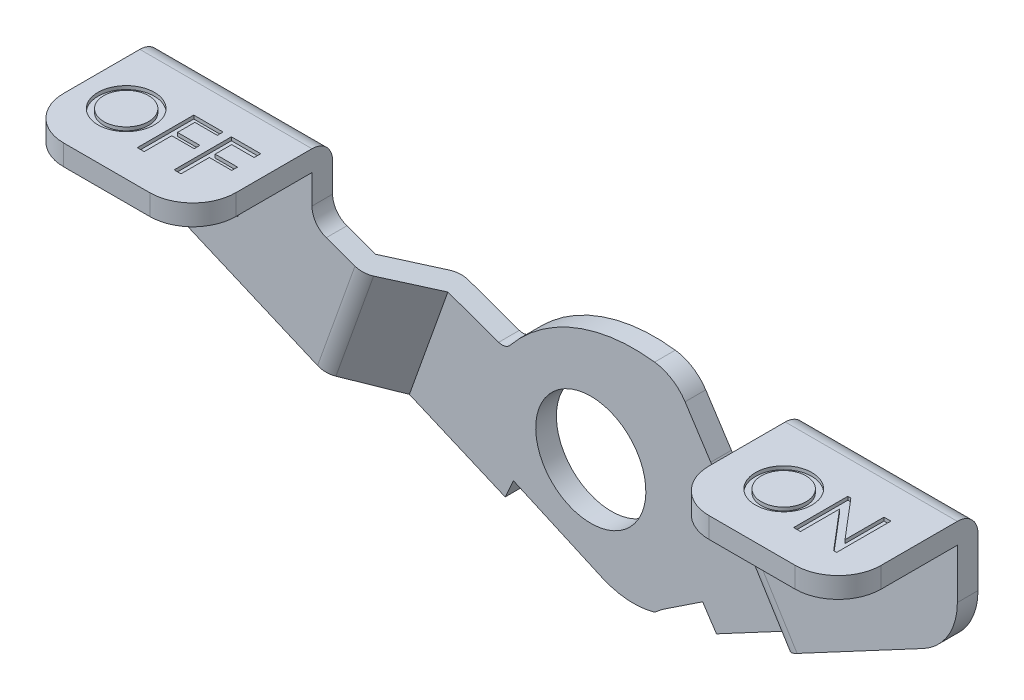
ISO-10303-21;
HEADER;
FILE_DESCRIPTION(('STEP AP214'),'2;1');
FILE_NAME('part.step','',(''),(''),'','','');
FILE_SCHEMA(('AUTOMOTIVE_DESIGN { 1 0 10303 214 1 1 1 1 }'));
ENDSEC;
DATA;
#1=APPLICATION_CONTEXT('core data for automotive mechanical design processes');
#2=APPLICATION_PROTOCOL_DEFINITION('international standard','automotive_design',2000,#1);
#3=PRODUCT_CONTEXT('',#1,'mechanical');
#4=PRODUCT('Part','Part','',(#3));
#5=PRODUCT_RELATED_PRODUCT_CATEGORY('part','',(#4));
#6=PRODUCT_DEFINITION_FORMATION('','',#4);
#7=PRODUCT_DEFINITION_CONTEXT('part definition',#1,'design');
#8=PRODUCT_DEFINITION('design','',#6,#7);
#9=PRODUCT_DEFINITION_SHAPE('','',#8);
#10=(LENGTH_UNIT() NAMED_UNIT(*) SI_UNIT(.MILLI.,.METRE.));
#11=(NAMED_UNIT(*) PLANE_ANGLE_UNIT() SI_UNIT($,.RADIAN.));
#12=(NAMED_UNIT(*) SI_UNIT($,.STERADIAN.) SOLID_ANGLE_UNIT());
#13=UNCERTAINTY_MEASURE_WITH_UNIT(LENGTH_MEASURE(1.E-05),#10,'distance_accuracy_value','');
#14=(GEOMETRIC_REPRESENTATION_CONTEXT(3) GLOBAL_UNCERTAINTY_ASSIGNED_CONTEXT((#13)) GLOBAL_UNIT_ASSIGNED_CONTEXT((#10,
#11,#12)) REPRESENTATION_CONTEXT('',''));
#15=CARTESIAN_POINT('',(0.,0.,0.));
#16=DIRECTION('',(0.,0.,1.));
#17=DIRECTION('',(1.,0.,0.));
#18=AXIS2_PLACEMENT_3D('',#15,#16,#17);
#19=CARTESIAN_POINT('',(-57.1138870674,27.432,21.202222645));
#20=DIRECTION('',(0.,-1.,0.));
#21=DIRECTION('',(0.,0.,-1.));
#22=AXIS2_PLACEMENT_3D('',#19,#20,#21);
#23=PLANE('',#22);
#24=CARTESIAN_POINT('',(-53.7651378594,27.432,17.853473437));
#25=DIRECTION('',(0.,1.,0.));
#26=DIRECTION('',(0.,0.,1.));
#27=AXIS2_PLACEMENT_3D('',#24,#25,#26);
#28=CIRCLE('',#27,3.3090407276);
#29=CARTESIAN_POINT('',(-53.7651378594,27.432,21.1625141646));
#30=VERTEX_POINT('',#29);
#31=EDGE_CURVE('E20',#30,#30,#28,.T.);
#32=ORIENTED_EDGE('',*,*,#31,.T.);
#33=EDGE_LOOP('',(#32));
#34=FACE_BOUND('',#33,.T.);
#35=ADVANCED_FACE('F16',(#34),#23,.F.);
#36=CARTESIAN_POINT('',(-53.7651378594,26.924,17.853473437));
#37=DIRECTION('',(0.,1.,0.));
#38=DIRECTION('',(0.,0.,1.));
#39=AXIS2_PLACEMENT_3D('',#36,#37,#38);
#40=CYLINDRICAL_SURFACE('',#39,3.3090407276);
#41=CARTESIAN_POINT('',(-53.7651378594,26.924,17.853473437));
#42=DIRECTION('',(0.,1.,0.));
#43=DIRECTION('',(0.,0.,1.));
#44=AXIS2_PLACEMENT_3D('',#41,#42,#43);
#45=CIRCLE('',#44,3.3090407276);
#46=CARTESIAN_POINT('',(-53.7651378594,26.924,21.1625141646));
#47=VERTEX_POINT('',#46);
#48=EDGE_CURVE('E725',#47,#47,#45,.F.);
#49=ORIENTED_EDGE('',*,*,#48,.F.);
#50=EDGE_LOOP('',(#49));
#51=FACE_BOUND('',#50,.T.);
#52=ORIENTED_EDGE('',*,*,#31,.F.);
#53=EDGE_LOOP('',(#52));
#54=FACE_BOUND('',#53,.T.);
#55=ADVANCED_FACE('F737',(#51,#54),#40,.T.);
#56=CARTESIAN_POINT('',(-42.3997827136,26.924,13.6896250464));
#57=DIRECTION('',(0.,1.,0.));
#58=DIRECTION('',(0.,0.,1.));
#59=AXIS2_PLACEMENT_3D('',#56,#57,#58);
#60=PLANE('',#59);
#61=DIRECTION('',(-1.,0.,0.));
#62=VECTOR('',#61,1.);
#63=CARTESIAN_POINT('',(-39.7275928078,26.924,14.6665481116));
#64=LINE('',#63,#62);
#65=CARTESIAN_POINT('',(-38.071402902,26.924,14.6665481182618));
#66=VERTEX_POINT('',#65);
#67=CARTESIAN_POINT('',(-41.3837827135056,26.924,14.6665481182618));
#68=VERTEX_POINT('',#67);
#69=EDGE_CURVE('E1750',#66,#68,#64,.T.);
#70=ORIENTED_EDGE('',*,*,#69,.F.);
#71=DIRECTION('',(0.,0.,1.));
#72=VECTOR('',#71,1.);
#73=CARTESIAN_POINT('',(-38.071402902,26.924,14.178086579));
#74=LINE('',#73,#72);
#75=CARTESIAN_POINT('',(-38.071402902,26.924,13.6896250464));
#76=VERTEX_POINT('',#75);
#77=EDGE_CURVE('E1746',#76,#66,#74,.T.);
#78=ORIENTED_EDGE('',*,*,#77,.F.);
#79=DIRECTION('',(1.,0.,0.));
#80=VECTOR('',#79,1.);
#81=CARTESIAN_POINT('',(-40.2355928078,26.924,13.6896250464));
#82=LINE('',#81,#80);
#83=CARTESIAN_POINT('',(-42.3997827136,26.924,13.6896250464));
#84=VERTEX_POINT('',#83);
#85=EDGE_CURVE('E1668',#84,#76,#82,.T.);
#86=ORIENTED_EDGE('',*,*,#85,.F.);
#87=DIRECTION('',(0.,0.,-1.));
#88=VECTOR('',#87,1.);
#89=CARTESIAN_POINT('',(-42.3997827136,26.924,17.9178702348));
#90=LINE('',#89,#88);
#91=CARTESIAN_POINT('',(-42.3997827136,26.924,22.1461154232));
#92=VERTEX_POINT('',#91);
#93=EDGE_CURVE('E731',#92,#84,#90,.T.);
#94=ORIENTED_EDGE('',*,*,#93,.F.);
#95=DIRECTION('',(-1.,0.,0.));
#96=VECTOR('',#95,1.);
#97=CARTESIAN_POINT('',(-41.8917827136,26.924,22.1461154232));
#98=LINE('',#97,#96);
#99=CARTESIAN_POINT('',(-41.3837827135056,26.924,22.1461154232));
#100=VERTEX_POINT('',#99);
#101=EDGE_CURVE('E1655',#100,#92,#98,.T.);
#102=ORIENTED_EDGE('',*,*,#101,.F.);
#103=DIRECTION('',(0.,0.,1.));
#104=VECTOR('',#103,1.);
#105=CARTESIAN_POINT('',(-41.3837827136,26.924,20.0548894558));
#106=LINE('',#105,#104);
#107=CARTESIAN_POINT('',(-41.3837827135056,26.924,17.9636634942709));
#108=VERTEX_POINT('',#107);
#109=EDGE_CURVE('E1658',#108,#100,#106,.T.);
#110=ORIENTED_EDGE('',*,*,#109,.F.);
#111=DIRECTION('',(-1.,0.,0.));
#112=VECTOR('',#111,1.);
#113=CARTESIAN_POINT('',(-39.7275928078,26.924,17.9636634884));
#114=LINE('',#113,#112);
#115=CARTESIAN_POINT('',(-38.071402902,26.924,17.9636634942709));
#116=VERTEX_POINT('',#115);
#117=EDGE_CURVE('E1769',#116,#108,#114,.T.);
#118=ORIENTED_EDGE('',*,*,#117,.F.);
#119=DIRECTION('',(0.,0.,1.));
#120=VECTOR('',#119,1.);
#121=CARTESIAN_POINT('',(-38.071402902,26.924,17.5362596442));
#122=LINE('',#121,#120);
#123=CARTESIAN_POINT('',(-38.071402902,26.924,17.108855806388));
#124=VERTEX_POINT('',#123);
#125=EDGE_CURVE('E1764',#124,#116,#122,.T.);
#126=ORIENTED_EDGE('',*,*,#125,.F.);
#127=DIRECTION('',(1.,0.,0.));
#128=VECTOR('',#127,1.);
#129=CARTESIAN_POINT('',(-39.7275928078,26.924,17.1088558));
#130=LINE('',#129,#128);
#131=CARTESIAN_POINT('',(-41.3837827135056,26.924,17.108855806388));
#132=VERTEX_POINT('',#131);
#133=EDGE_CURVE('E1759',#132,#124,#130,.T.);
#134=ORIENTED_EDGE('',*,*,#133,.F.);
#135=DIRECTION('',(0.,0.,1.));
#136=VECTOR('',#135,1.);
#137=CARTESIAN_POINT('',(-41.3837827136,26.924,15.8877019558));
#138=LINE('',#137,#136);
#139=EDGE_CURVE('E1754',#68,#132,#138,.T.);
#140=ORIENTED_EDGE('',*,*,#139,.F.);
#141=EDGE_LOOP('',(#70,#78,#86,#94,#102,#110,#118,#126,#134,#140));
#142=FACE_BOUND('',#141,.T.);
#143=ADVANCED_FACE('F739',(#142),#60,.T.);
#144=CARTESIAN_POINT('',(-57.9789524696,26.924,13.6396588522));
#145=DIRECTION('',(0.,1.,0.));
#146=DIRECTION('',(0.,0.,1.));
#147=AXIS2_PLACEMENT_3D('',#144,#145,#146);
#148=PLANE('',#147);
#149=ORIENTED_EDGE('',*,*,#48,.T.);
#150=EDGE_LOOP('',(#149));
#151=FACE_BOUND('',#150,.T.);
#152=CARTESIAN_POINT('',(-53.7651378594,26.924,17.853473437));
#153=DIRECTION('',(0.,1.,0.));
#154=DIRECTION('',(0.,0.,1.));
#155=AXIS2_PLACEMENT_3D('',#152,#153,#154);
#156=CIRCLE('',#155,4.163848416);
#157=CARTESIAN_POINT('',(-53.7651378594,26.924,22.017321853));
#158=VERTEX_POINT('',#157);
#159=EDGE_CURVE('E721',#158,#158,#156,.F.);
#160=ORIENTED_EDGE('',*,*,#159,.F.);
#161=EDGE_LOOP('',(#160));
#162=FACE_BOUND('',#161,.T.);
#163=ADVANCED_FACE('F745',(#151,#162),#148,.T.);
#164=CARTESIAN_POINT('',(-47.9560327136,26.924,13.6896250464));
#165=DIRECTION('',(0.,-1.,0.));
#166=DIRECTION('',(1.,0.,0.));
#167=AXIS2_PLACEMENT_3D('',#164,#165,#166);
#168=PLANE('',#167);
#169=DIRECTION('',(0.,0.,1.));
#170=VECTOR('',#169,1.);
#171=CARTESIAN_POINT('',(-46.9400327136,26.924,19.9938317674));
#172=LINE('',#171,#170);
#173=CARTESIAN_POINT('',(-46.9400327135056,26.924,17.9636634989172));
#174=VERTEX_POINT('',#173);
#175=CARTESIAN_POINT('',(-46.9400327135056,26.924,22.0240000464));
#176=VERTEX_POINT('',#175);
#177=EDGE_CURVE('E723',#174,#176,#172,.T.);
#178=ORIENTED_EDGE('',*,*,#177,.F.);
#179=DIRECTION('',(-1.,0.,0.));
#180=VECTOR('',#179,1.);
#181=CARTESIAN_POINT('',(-45.2838428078,26.924,17.9636634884));
#182=LINE('',#181,#180);
#183=CARTESIAN_POINT('',(-43.627652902,26.924,17.9636634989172));
#184=VERTEX_POINT('',#183);
#185=EDGE_CURVE('E1738',#184,#174,#182,.T.);
#186=ORIENTED_EDGE('',*,*,#185,.F.);
#187=DIRECTION('',(0.,0.,1.));
#188=VECTOR('',#187,1.);
#189=CARTESIAN_POINT('',(-43.627652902,26.924,17.5362596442));
#190=LINE('',#189,#188);
#191=CARTESIAN_POINT('',(-43.627652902,26.924,17.1088558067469));
#192=VERTEX_POINT('',#191);
#193=EDGE_CURVE('E1733',#192,#184,#190,.T.);
#194=ORIENTED_EDGE('',*,*,#193,.F.);
#195=DIRECTION('',(1.,0.,0.));
#196=VECTOR('',#195,1.);
#197=CARTESIAN_POINT('',(-45.2838428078,26.924,17.1088558));
#198=LINE('',#197,#196);
#199=CARTESIAN_POINT('',(-46.9400327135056,26.924,17.1088558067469));
#200=VERTEX_POINT('',#199);
#201=EDGE_CURVE('E1728',#200,#192,#198,.T.);
#202=ORIENTED_EDGE('',*,*,#201,.F.);
#203=DIRECTION('',(0.,0.,1.));
#204=VECTOR('',#203,1.);
#205=CARTESIAN_POINT('',(-46.9400327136,26.924,15.8266442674));
#206=LINE('',#205,#204);
#207=CARTESIAN_POINT('',(-46.9400327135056,26.924,14.5444327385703));
#208=VERTEX_POINT('',#207);
#209=EDGE_CURVE('E1723',#208,#200,#206,.T.);
#210=ORIENTED_EDGE('',*,*,#209,.F.);
#211=DIRECTION('',(-1.,0.,0.));
#212=VECTOR('',#211,1.);
#213=CARTESIAN_POINT('',(-45.2838428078,26.924,14.5444327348));
#214=LINE('',#213,#212);
#215=CARTESIAN_POINT('',(-43.627652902,26.924,14.5444327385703));
#216=VERTEX_POINT('',#215);
#217=EDGE_CURVE('E1718',#216,#208,#214,.T.);
#218=ORIENTED_EDGE('',*,*,#217,.F.);
#219=DIRECTION('',(0.,0.,1.));
#220=VECTOR('',#219,1.);
#221=CARTESIAN_POINT('',(-43.627652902,26.924,14.1170288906));
#222=LINE('',#221,#220);
#223=CARTESIAN_POINT('',(-43.627652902,26.924,13.6896250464));
#224=VERTEX_POINT('',#223);
#225=EDGE_CURVE('E1713',#224,#216,#222,.T.);
#226=ORIENTED_EDGE('',*,*,#225,.F.);
#227=DIRECTION('',(1.,0.,0.));
#228=VECTOR('',#227,1.);
#229=CARTESIAN_POINT('',(-45.7918428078,26.924,13.6896250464));
#230=LINE('',#229,#228);
#231=CARTESIAN_POINT('',(-47.9560327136,26.924,13.6896250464));
#232=VERTEX_POINT('',#231);
#233=EDGE_CURVE('E1708',#232,#224,#230,.T.);
#234=ORIENTED_EDGE('',*,*,#233,.F.);
#235=DIRECTION('',(0.,0.,-1.));
#236=VECTOR('',#235,1.);
#237=CARTESIAN_POINT('',(-47.9560327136,26.924,17.8568125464));
#238=LINE('',#237,#236);
#239=CARTESIAN_POINT('',(-47.9560327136,26.924,22.0240000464));
#240=VERTEX_POINT('',#239);
#241=EDGE_CURVE('E1703',#240,#232,#238,.T.);
#242=ORIENTED_EDGE('',*,*,#241,.F.);
#243=DIRECTION('',(-1.,0.,0.));
#244=VECTOR('',#243,1.);
#245=CARTESIAN_POINT('',(-45.7918428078,26.924,22.0240000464));
#246=LINE('',#245,#244);
#247=EDGE_CURVE('E727',#176,#240,#246,.T.);
#248=ORIENTED_EDGE('',*,*,#247,.F.);
#249=EDGE_LOOP('',(#178,#186,#194,#202,#210,#218,#226,#234,#242,#248));
#250=FACE_BOUND('',#249,.T.);
#251=ADVANCED_FACE('F766',(#250),#168,.F.);
#252=CARTESIAN_POINT('',(-42.3997827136,26.924,22.1461154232));
#253=DIRECTION('',(1.,0.,0.));
#254=DIRECTION('',(0.,0.,-1.));
#255=AXIS2_PLACEMENT_3D('',#252,#253,#254);
#256=PLANE('',#255);
#257=ORIENTED_EDGE('',*,*,#93,.T.);
#258=DIRECTION('',(0.,-1.,0.));
#259=VECTOR('',#258,1.);
#260=CARTESIAN_POINT('',(-42.3997827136,27.178,13.6896250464));
#261=LINE('',#260,#259);
#262=CARTESIAN_POINT('',(-42.39978270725,27.432,13.6896250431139));
#263=VERTEX_POINT('',#262);
#264=EDGE_CURVE('E1664',#263,#84,#261,.T.);
#265=ORIENTED_EDGE('',*,*,#264,.F.);
#266=DIRECTION('',(0.,0.,1.));
#267=VECTOR('',#266,1.);
#268=CARTESIAN_POINT('',(-42.3997826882,27.432,18.06575));
#269=LINE('',#268,#267);
#270=CARTESIAN_POINT('',(-42.39978270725,27.432,22.1461154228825));
#271=VERTEX_POINT('',#270);
#272=EDGE_CURVE('E1496',#263,#271,#269,.T.);
#273=ORIENTED_EDGE('',*,*,#272,.T.);
#274=DIRECTION('',(0.,1.,0.));
#275=VECTOR('',#274,1.);
#276=CARTESIAN_POINT('',(-42.3997827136,27.178,22.1461154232));
#277=LINE('',#276,#275);
#278=EDGE_CURVE('E1650',#92,#271,#277,.T.);
#279=ORIENTED_EDGE('',*,*,#278,.F.);
#280=EDGE_LOOP('',(#257,#265,#273,#279));
#281=FACE_BOUND('',#280,.T.);
#282=ADVANCED_FACE('F769',(#281),#256,.T.);
#283=CARTESIAN_POINT('',(-42.3997827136,26.924,22.1461154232));
#284=DIRECTION('',(0.,0.,-1.));
#285=DIRECTION('',(0.,1.,0.));
#286=AXIS2_PLACEMENT_3D('',#283,#284,#285);
#287=PLANE('',#286);
#288=ORIENTED_EDGE('',*,*,#101,.T.);
#289=ORIENTED_EDGE('',*,*,#278,.T.);
#290=DIRECTION('',(1.,0.,0.));
#291=VECTOR('',#290,1.);
#292=CARTESIAN_POINT('',(-47.6301859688,27.432,22.14611542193));
#293=LINE('',#292,#291);
#294=CARTESIAN_POINT('',(-41.38378270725,27.432,22.1461154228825));
#295=VERTEX_POINT('',#294);
#296=EDGE_CURVE('E1493',#271,#295,#293,.T.);
#297=ORIENTED_EDGE('',*,*,#296,.T.);
#298=DIRECTION('',(0.,1.,0.));
#299=VECTOR('',#298,1.);
#300=CARTESIAN_POINT('',(-41.3837827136,27.178,22.1461154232));
#301=LINE('',#300,#299);
#302=EDGE_CURVE('E1772',#100,#295,#301,.T.);
#303=ORIENTED_EDGE('',*,*,#302,.F.);
#304=EDGE_LOOP('',(#288,#289,#297,#303));
#305=FACE_BOUND('',#304,.T.);
#306=ADVANCED_FACE('F773',(#305),#287,.T.);
#307=CARTESIAN_POINT('',(-41.3837827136,26.924,17.9636634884));
#308=DIRECTION('',(-1.,0.,0.));
#309=DIRECTION('',(0.,0.,1.));
#310=AXIS2_PLACEMENT_3D('',#307,#308,#309);
#311=PLANE('',#310);
#312=ORIENTED_EDGE('',*,*,#109,.T.);
#313=ORIENTED_EDGE('',*,*,#302,.T.);
#314=DIRECTION('',(0.,0.,-1.));
#315=VECTOR('',#314,1.);
#316=CARTESIAN_POINT('',(-41.3837826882,27.432,18.06575));
#317=LINE('',#316,#315);
#318=CARTESIAN_POINT('',(-41.38378270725,27.432,17.963663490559));
#319=VERTEX_POINT('',#318);
#320=EDGE_CURVE('E1490',#295,#319,#317,.T.);
#321=ORIENTED_EDGE('',*,*,#320,.T.);
#322=DIRECTION('',(0.,1.,0.));
#323=VECTOR('',#322,1.);
#324=CARTESIAN_POINT('',(-41.3837827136,27.178,17.9636634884));
#325=LINE('',#324,#323);
#326=EDGE_CURVE('E1767',#108,#319,#325,.T.);
#327=ORIENTED_EDGE('',*,*,#326,.F.);
#328=EDGE_LOOP('',(#312,#313,#321,#327));
#329=FACE_BOUND('',#328,.T.);
#330=ADVANCED_FACE('F777',(#329),#311,.T.);
#331=CARTESIAN_POINT('',(-38.071402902,26.924,17.9636634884));
#332=DIRECTION('',(0.,0.,-1.));
#333=DIRECTION('',(-1.,0.,0.));
#334=AXIS2_PLACEMENT_3D('',#331,#332,#333);
#335=PLANE('',#334);
#336=ORIENTED_EDGE('',*,*,#117,.T.);
#337=ORIENTED_EDGE('',*,*,#326,.T.);
#338=DIRECTION('',(1.,0.,0.));
#339=VECTOR('',#338,1.);
#340=CARTESIAN_POINT('',(-47.6301859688,27.432,17.963663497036));
#341=LINE('',#340,#339);
#342=CARTESIAN_POINT('',(-38.07140289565,27.432,17.963663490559));
#343=VERTEX_POINT('',#342);
#344=EDGE_CURVE('E1487',#319,#343,#341,.T.);
#345=ORIENTED_EDGE('',*,*,#344,.T.);
#346=DIRECTION('',(0.,1.,0.));
#347=VECTOR('',#346,1.);
#348=CARTESIAN_POINT('',(-38.071402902,27.178,17.9636634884));
#349=LINE('',#348,#347);
#350=EDGE_CURVE('E1762',#116,#343,#349,.T.);
#351=ORIENTED_EDGE('',*,*,#350,.F.);
#352=EDGE_LOOP('',(#336,#337,#345,#351));
#353=FACE_BOUND('',#352,.T.);
#354=ADVANCED_FACE('F781',(#353),#335,.T.);
#355=CARTESIAN_POINT('',(-38.071402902,26.924,17.1088558));
#356=DIRECTION('',(-1.,0.,0.));
#357=DIRECTION('',(0.,0.,1.));
#358=AXIS2_PLACEMENT_3D('',#355,#356,#357);
#359=PLANE('',#358);
#360=ORIENTED_EDGE('',*,*,#125,.T.);
#361=ORIENTED_EDGE('',*,*,#350,.T.);
#362=DIRECTION('',(0.,0.,-1.));
#363=VECTOR('',#362,1.);
#364=CARTESIAN_POINT('',(-38.0714028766,27.432,18.06575));
#365=LINE('',#364,#363);
#366=CARTESIAN_POINT('',(-38.07140289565,27.432,17.1088558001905));
#367=VERTEX_POINT('',#366);
#368=EDGE_CURVE('E1484',#343,#367,#365,.T.);
#369=ORIENTED_EDGE('',*,*,#368,.T.);
#370=DIRECTION('',(0.,1.,0.));
#371=VECTOR('',#370,1.);
#372=CARTESIAN_POINT('',(-38.071402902,27.178,17.1088558));
#373=LINE('',#372,#371);
#374=EDGE_CURVE('E1757',#124,#367,#373,.T.);
#375=ORIENTED_EDGE('',*,*,#374,.F.);
#376=EDGE_LOOP('',(#360,#361,#369,#375));
#377=FACE_BOUND('',#376,.T.);
#378=ADVANCED_FACE('F785',(#377),#359,.T.);
#379=CARTESIAN_POINT('',(-41.3837827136,26.924,17.1088558));
#380=DIRECTION('',(0.,0.,1.));
#381=DIRECTION('',(1.,0.,0.));
#382=AXIS2_PLACEMENT_3D('',#379,#380,#381);
#383=PLANE('',#382);
#384=ORIENTED_EDGE('',*,*,#133,.T.);
#385=ORIENTED_EDGE('',*,*,#374,.T.);
#386=DIRECTION('',(-1.,0.,0.));
#387=VECTOR('',#386,1.);
#388=CARTESIAN_POINT('',(-47.6301859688,27.432,17.108855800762));
#389=LINE('',#388,#387);
#390=CARTESIAN_POINT('',(-41.38378270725,27.432,17.1088558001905));
#391=VERTEX_POINT('',#390);
#392=EDGE_CURVE('E1478',#367,#391,#389,.T.);
#393=ORIENTED_EDGE('',*,*,#392,.T.);
#394=DIRECTION('',(0.,1.,0.));
#395=VECTOR('',#394,1.);
#396=CARTESIAN_POINT('',(-41.3837827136,27.178,17.1088558));
#397=LINE('',#396,#395);
#398=EDGE_CURVE('E1752',#132,#391,#397,.T.);
#399=ORIENTED_EDGE('',*,*,#398,.F.);
#400=EDGE_LOOP('',(#384,#385,#393,#399));
#401=FACE_BOUND('',#400,.T.);
#402=ADVANCED_FACE('F789',(#401),#383,.T.);
#403=CARTESIAN_POINT('',(-41.3837827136,26.924,14.6665481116));
#404=DIRECTION('',(-1.,0.,0.));
#405=DIRECTION('',(0.,0.,1.));
#406=AXIS2_PLACEMENT_3D('',#403,#404,#405);
#407=PLANE('',#406);
#408=ORIENTED_EDGE('',*,*,#139,.T.);
#409=ORIENTED_EDGE('',*,*,#398,.T.);
#410=DIRECTION('',(0.,0.,-1.));
#411=VECTOR('',#410,1.);
#412=CARTESIAN_POINT('',(-41.3837826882,27.432,18.06575));
#413=LINE('',#412,#411);
#414=CARTESIAN_POINT('',(-41.38378270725,27.432,14.6665481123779));
#415=VERTEX_POINT('',#414);
#416=EDGE_CURVE('E1476',#391,#415,#413,.T.);
#417=ORIENTED_EDGE('',*,*,#416,.T.);
#418=DIRECTION('',(0.,1.,0.));
#419=VECTOR('',#418,1.);
#420=CARTESIAN_POINT('',(-41.3837827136,27.178,14.6665481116));
#421=LINE('',#420,#419);
#422=EDGE_CURVE('E1475',#68,#415,#421,.T.);
#423=ORIENTED_EDGE('',*,*,#422,.F.);
#424=EDGE_LOOP('',(#408,#409,#417,#423));
#425=FACE_BOUND('',#424,.T.);
#426=ADVANCED_FACE('F793',(#425),#407,.T.);
#427=CARTESIAN_POINT('',(-41.3837827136,26.924,14.6665481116));
#428=DIRECTION('',(0.,0.,-1.));
#429=DIRECTION('',(0.,1.,0.));
#430=AXIS2_PLACEMENT_3D('',#427,#428,#429);
#431=PLANE('',#430);
#432=ORIENTED_EDGE('',*,*,#69,.T.);
#433=ORIENTED_EDGE('',*,*,#422,.T.);
#434=DIRECTION('',(1.,0.,0.));
#435=VECTOR('',#434,1.);
#436=CARTESIAN_POINT('',(-47.6301859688,27.432,14.6665481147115));
#437=LINE('',#436,#435);
#438=CARTESIAN_POINT('',(-38.07140289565,27.432,14.6665481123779));
#439=VERTEX_POINT('',#438);
#440=EDGE_CURVE('E1460',#415,#439,#437,.T.);
#441=ORIENTED_EDGE('',*,*,#440,.T.);
#442=DIRECTION('',(0.,1.,0.));
#443=VECTOR('',#442,1.);
#444=CARTESIAN_POINT('',(-38.071402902,27.178,14.6665481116));
#445=LINE('',#444,#443);
#446=EDGE_CURVE('E1473',#66,#439,#445,.T.);
#447=ORIENTED_EDGE('',*,*,#446,.F.);
#448=EDGE_LOOP('',(#432,#433,#441,#447));
#449=FACE_BOUND('',#448,.T.);
#450=ADVANCED_FACE('F797',(#449),#431,.T.);
#451=CARTESIAN_POINT('',(-38.071402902,26.924,13.6896250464));
#452=DIRECTION('',(-1.,0.,0.));
#453=DIRECTION('',(0.,0.,1.));
#454=AXIS2_PLACEMENT_3D('',#451,#452,#453);
#455=PLANE('',#454);
#456=ORIENTED_EDGE('',*,*,#77,.T.);
#457=ORIENTED_EDGE('',*,*,#446,.T.);
#458=DIRECTION('',(0.,0.,-1.));
#459=VECTOR('',#458,1.);
#460=CARTESIAN_POINT('',(-38.0714028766,27.432,18.06575));
#461=LINE('',#460,#459);
#462=CARTESIAN_POINT('',(-38.07140289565,27.432,13.6896250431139));
#463=VERTEX_POINT('',#462);
#464=EDGE_CURVE('E1456',#439,#463,#461,.T.);
#465=ORIENTED_EDGE('',*,*,#464,.T.);
#466=DIRECTION('',(0.,1.,0.));
#467=VECTOR('',#466,1.);
#468=CARTESIAN_POINT('',(-38.071402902,27.178,13.6896250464));
#469=LINE('',#468,#467);
#470=EDGE_CURVE('E724',#76,#463,#469,.T.);
#471=ORIENTED_EDGE('',*,*,#470,.F.);
#472=EDGE_LOOP('',(#456,#457,#465,#471));
#473=FACE_BOUND('',#472,.T.);
#474=ADVANCED_FACE('F801',(#473),#455,.T.);
#475=CARTESIAN_POINT('',(-42.3997827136,27.432,13.6896250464));
#476=DIRECTION('',(0.,0.,1.));
#477=DIRECTION('',(0.,-1.,0.));
#478=AXIS2_PLACEMENT_3D('',#475,#476,#477);
#479=PLANE('',#478);
#480=ORIENTED_EDGE('',*,*,#85,.T.);
#481=ORIENTED_EDGE('',*,*,#470,.T.);
#482=DIRECTION('',(-1.,0.,0.));
#483=VECTOR('',#482,1.);
#484=CARTESIAN_POINT('',(-47.6301859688,27.432,13.6896250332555));
#485=LINE('',#484,#483);
#486=EDGE_CURVE('E719',#463,#263,#485,.T.);
#487=ORIENTED_EDGE('',*,*,#486,.T.);
#488=ORIENTED_EDGE('',*,*,#264,.T.);
#489=EDGE_LOOP('',(#480,#481,#487,#488));
#490=FACE_BOUND('',#489,.T.);
#491=ADVANCED_FACE('F805',(#490),#479,.T.);
#492=CARTESIAN_POINT('',(-53.7651378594,26.924,17.853473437));
#493=DIRECTION('',(0.,1.,0.));
#494=DIRECTION('',(0.,0.,1.));
#495=AXIS2_PLACEMENT_3D('',#492,#493,#494);
#496=CYLINDRICAL_SURFACE('',#495,4.163848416);
#497=ORIENTED_EDGE('',*,*,#159,.T.);
#498=EDGE_LOOP('',(#497));
#499=FACE_BOUND('',#498,.T.);
#500=CARTESIAN_POINT('',(-53.7651378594,27.432,17.853473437));
#501=DIRECTION('',(0.,1.,0.));
#502=DIRECTION('',(0.,0.,1.));
#503=AXIS2_PLACEMENT_3D('',#500,#501,#502);
#504=CIRCLE('',#503,4.163848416);
#505=CARTESIAN_POINT('',(-53.7651378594,27.432,22.017321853));
#506=VERTEX_POINT('',#505);
#507=EDGE_CURVE('E716',#506,#506,#504,.T.);
#508=ORIENTED_EDGE('',*,*,#507,.T.);
#509=EDGE_LOOP('',(#508));
#510=FACE_BOUND('',#509,.T.);
#511=ADVANCED_FACE('F809',(#499,#510),#496,.F.);
#512=CARTESIAN_POINT('',(-46.9400327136,26.924,17.9636634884));
#513=DIRECTION('',(-1.,0.,0.));
#514=DIRECTION('',(0.,0.,1.));
#515=AXIS2_PLACEMENT_3D('',#512,#513,#514);
#516=PLANE('',#515);
#517=ORIENTED_EDGE('',*,*,#177,.T.);
#518=DIRECTION('',(0.,-1.,0.));
#519=VECTOR('',#518,1.);
#520=CARTESIAN_POINT('',(-46.9400327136,27.178,22.0240000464));
#521=LINE('',#520,#519);
#522=CARTESIAN_POINT('',(-46.94003270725,27.432,22.024000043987));
#523=VERTEX_POINT('',#522);
#524=EDGE_CURVE('E1699',#523,#176,#521,.T.);
#525=ORIENTED_EDGE('',*,*,#524,.F.);
#526=DIRECTION('',(0.,0.,-1.));
#527=VECTOR('',#526,1.);
#528=CARTESIAN_POINT('',(-46.9400326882,27.432,18.06575));
#529=LINE('',#528,#527);
#530=CARTESIAN_POINT('',(-46.94003270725,27.432,17.963663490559));
#531=VERTEX_POINT('',#530);
#532=EDGE_CURVE('E718',#523,#531,#529,.T.);
#533=ORIENTED_EDGE('',*,*,#532,.T.);
#534=DIRECTION('',(0.,1.,0.));
#535=VECTOR('',#534,1.);
#536=CARTESIAN_POINT('',(-46.9400327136,27.178,17.9636634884));
#537=LINE('',#536,#535);
#538=EDGE_CURVE('E1736',#174,#531,#537,.T.);
#539=ORIENTED_EDGE('',*,*,#538,.F.);
#540=EDGE_LOOP('',(#517,#525,#533,#539));
#541=FACE_BOUND('',#540,.T.);
#542=ADVANCED_FACE('F811',(#541),#516,.T.);
#543=CARTESIAN_POINT('',(-43.627652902,26.924,17.9636634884));
#544=DIRECTION('',(0.,0.,-1.));
#545=DIRECTION('',(-1.,0.,0.));
#546=AXIS2_PLACEMENT_3D('',#543,#544,#545);
#547=PLANE('',#546);
#548=ORIENTED_EDGE('',*,*,#185,.T.);
#549=ORIENTED_EDGE('',*,*,#538,.T.);
#550=DIRECTION('',(1.,0.,0.));
#551=VECTOR('',#550,1.);
#552=CARTESIAN_POINT('',(-47.6301859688,27.432,17.963663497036));
#553=LINE('',#552,#551);
#554=CARTESIAN_POINT('',(-43.62765289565,27.432,17.963663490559));
#555=VERTEX_POINT('',#554);
#556=EDGE_CURVE('E1673',#531,#555,#553,.T.);
#557=ORIENTED_EDGE('',*,*,#556,.T.);
#558=DIRECTION('',(0.,1.,0.));
#559=VECTOR('',#558,1.);
#560=CARTESIAN_POINT('',(-43.627652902,27.178,17.9636634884));
#561=LINE('',#560,#559);
#562=EDGE_CURVE('E1731',#184,#555,#561,.T.);
#563=ORIENTED_EDGE('',*,*,#562,.F.);
#564=EDGE_LOOP('',(#548,#549,#557,#563));
#565=FACE_BOUND('',#564,.T.);
#566=ADVANCED_FACE('F814',(#565),#547,.T.);
#567=CARTESIAN_POINT('',(-43.627652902,26.924,17.1088558));
#568=DIRECTION('',(-1.,0.,0.));
#569=DIRECTION('',(0.,0.,1.));
#570=AXIS2_PLACEMENT_3D('',#567,#568,#569);
#571=PLANE('',#570);
#572=ORIENTED_EDGE('',*,*,#193,.T.);
#573=ORIENTED_EDGE('',*,*,#562,.T.);
#574=DIRECTION('',(0.,0.,-1.));
#575=VECTOR('',#574,1.);
#576=CARTESIAN_POINT('',(-43.6276528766,27.432,18.06575));
#577=LINE('',#576,#575);
#578=CARTESIAN_POINT('',(-43.62765289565,27.432,17.1088558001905));
#579=VERTEX_POINT('',#578);
#580=EDGE_CURVE('E1676',#555,#579,#577,.T.);
#581=ORIENTED_EDGE('',*,*,#580,.T.);
#582=DIRECTION('',(0.,1.,0.));
#583=VECTOR('',#582,1.);
#584=CARTESIAN_POINT('',(-43.627652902,27.178,17.1088558));
#585=LINE('',#584,#583);
#586=EDGE_CURVE('E1726',#192,#579,#585,.T.);
#587=ORIENTED_EDGE('',*,*,#586,.F.);
#588=EDGE_LOOP('',(#572,#573,#581,#587));
#589=FACE_BOUND('',#588,.T.);
#590=ADVANCED_FACE('F818',(#589),#571,.T.);
#591=CARTESIAN_POINT('',(-46.9400327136,26.924,17.1088558));
#592=DIRECTION('',(0.,0.,1.));
#593=DIRECTION('',(1.,0.,0.));
#594=AXIS2_PLACEMENT_3D('',#591,#592,#593);
#595=PLANE('',#594);
#596=ORIENTED_EDGE('',*,*,#201,.T.);
#597=ORIENTED_EDGE('',*,*,#586,.T.);
#598=DIRECTION('',(-1.,0.,0.));
#599=VECTOR('',#598,1.);
#600=CARTESIAN_POINT('',(-47.6301859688,27.432,17.108855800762));
#601=LINE('',#600,#599);
#602=CARTESIAN_POINT('',(-46.94003270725,27.432,17.1088558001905));
#603=VERTEX_POINT('',#602);
#604=EDGE_CURVE('E1679',#579,#603,#601,.T.);
#605=ORIENTED_EDGE('',*,*,#604,.T.);
#606=DIRECTION('',(0.,1.,0.));
#607=VECTOR('',#606,1.);
#608=CARTESIAN_POINT('',(-46.9400327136,27.178,17.1088558));
#609=LINE('',#608,#607);
#610=EDGE_CURVE('E1721',#200,#603,#609,.T.);
#611=ORIENTED_EDGE('',*,*,#610,.F.);
#612=EDGE_LOOP('',(#596,#597,#605,#611));
#613=FACE_BOUND('',#612,.T.);
#614=ADVANCED_FACE('F822',(#613),#595,.T.);
#615=CARTESIAN_POINT('',(-46.9400327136,26.924,14.5444327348));
#616=DIRECTION('',(-1.,0.,0.));
#617=DIRECTION('',(0.,0.,1.));
#618=AXIS2_PLACEMENT_3D('',#615,#616,#617);
#619=PLANE('',#618);
#620=ORIENTED_EDGE('',*,*,#209,.T.);
#621=ORIENTED_EDGE('',*,*,#610,.T.);
#622=DIRECTION('',(0.,0.,-1.));
#623=VECTOR('',#622,1.);
#624=CARTESIAN_POINT('',(-46.9400326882,27.432,18.06575));
#625=LINE('',#624,#623);
#626=CARTESIAN_POINT('',(-46.94003270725,27.432,14.5444327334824));
#627=VERTEX_POINT('',#626);
#628=EDGE_CURVE('E1682',#603,#627,#625,.T.);
#629=ORIENTED_EDGE('',*,*,#628,.T.);
#630=DIRECTION('',(0.,1.,0.));
#631=VECTOR('',#630,1.);
#632=CARTESIAN_POINT('',(-46.9400327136,27.178,14.5444327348));
#633=LINE('',#632,#631);
#634=EDGE_CURVE('E1716',#208,#627,#633,.T.);
#635=ORIENTED_EDGE('',*,*,#634,.F.);
#636=EDGE_LOOP('',(#620,#621,#629,#635));
#637=FACE_BOUND('',#636,.T.);
#638=ADVANCED_FACE('F826',(#637),#619,.T.);
#639=CARTESIAN_POINT('',(-43.627652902,26.924,14.5444327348));
#640=DIRECTION('',(0.,0.,-1.));
#641=DIRECTION('',(-1.,0.,0.));
#642=AXIS2_PLACEMENT_3D('',#639,#640,#641);
#643=PLANE('',#642);
#644=ORIENTED_EDGE('',*,*,#217,.T.);
#645=ORIENTED_EDGE('',*,*,#634,.T.);
#646=DIRECTION('',(1.,0.,0.));
#647=VECTOR('',#646,1.);
#648=CARTESIAN_POINT('',(-47.6301859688,27.432,14.5444327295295));
#649=LINE('',#648,#647);
#650=CARTESIAN_POINT('',(-43.62765289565,27.432,14.5444327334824));
#651=VERTEX_POINT('',#650);
#652=EDGE_CURVE('E1685',#627,#651,#649,.T.);
#653=ORIENTED_EDGE('',*,*,#652,.T.);
#654=DIRECTION('',(0.,1.,0.));
#655=VECTOR('',#654,1.);
#656=CARTESIAN_POINT('',(-43.627652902,27.178,14.5444327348));
#657=LINE('',#656,#655);
#658=EDGE_CURVE('E1711',#216,#651,#657,.T.);
#659=ORIENTED_EDGE('',*,*,#658,.F.);
#660=EDGE_LOOP('',(#644,#645,#653,#659));
#661=FACE_BOUND('',#660,.T.);
#662=ADVANCED_FACE('F830',(#661),#643,.T.);
#663=CARTESIAN_POINT('',(-43.627652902,26.924,13.6896250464));
#664=DIRECTION('',(-1.,0.,0.));
#665=DIRECTION('',(0.,0.,1.));
#666=AXIS2_PLACEMENT_3D('',#663,#664,#665);
#667=PLANE('',#666);
#668=ORIENTED_EDGE('',*,*,#225,.T.);
#669=ORIENTED_EDGE('',*,*,#658,.T.);
#670=DIRECTION('',(0.,0.,-1.));
#671=VECTOR('',#670,1.);
#672=CARTESIAN_POINT('',(-43.6276528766,27.432,18.06575));
#673=LINE('',#672,#671);
#674=CARTESIAN_POINT('',(-43.62765289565,27.432,13.6896250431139));
#675=VERTEX_POINT('',#674);
#676=EDGE_CURVE('E1688',#651,#675,#673,.T.);
#677=ORIENTED_EDGE('',*,*,#676,.T.);
#678=DIRECTION('',(0.,1.,0.));
#679=VECTOR('',#678,1.);
#680=CARTESIAN_POINT('',(-43.627652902,27.178,13.6896250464));
#681=LINE('',#680,#679);
#682=EDGE_CURVE('E1706',#224,#675,#681,.T.);
#683=ORIENTED_EDGE('',*,*,#682,.F.);
#684=EDGE_LOOP('',(#668,#669,#677,#683));
#685=FACE_BOUND('',#684,.T.);
#686=ADVANCED_FACE('F834',(#685),#667,.T.);
#687=CARTESIAN_POINT('',(-47.9560327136,26.924,13.6896250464));
#688=DIRECTION('',(0.,0.,1.));
#689=DIRECTION('',(1.,0.,0.));
#690=AXIS2_PLACEMENT_3D('',#687,#688,#689);
#691=PLANE('',#690);
#692=ORIENTED_EDGE('',*,*,#233,.T.);
#693=ORIENTED_EDGE('',*,*,#682,.T.);
#694=DIRECTION('',(-1.,0.,0.));
#695=VECTOR('',#694,1.);
#696=CARTESIAN_POINT('',(-47.6301859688,27.432,13.6896250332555));
#697=LINE('',#696,#695);
#698=CARTESIAN_POINT('',(-47.95603270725,27.432,13.6896250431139));
#699=VERTEX_POINT('',#698);
#700=EDGE_CURVE('E1691',#675,#699,#697,.T.);
#701=ORIENTED_EDGE('',*,*,#700,.T.);
#702=DIRECTION('',(0.,1.,0.));
#703=VECTOR('',#702,1.);
#704=CARTESIAN_POINT('',(-47.9560327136,27.178,13.6896250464));
#705=LINE('',#704,#703);
#706=EDGE_CURVE('E1701',#232,#699,#705,.T.);
#707=ORIENTED_EDGE('',*,*,#706,.F.);
#708=EDGE_LOOP('',(#692,#693,#701,#707));
#709=FACE_BOUND('',#708,.T.);
#710=ADVANCED_FACE('F838',(#709),#691,.T.);
#711=CARTESIAN_POINT('',(-47.9560327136,26.924,22.0240000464));
#712=DIRECTION('',(1.,0.,0.));
#713=DIRECTION('',(0.,0.,-1.));
#714=AXIS2_PLACEMENT_3D('',#711,#712,#713);
#715=PLANE('',#714);
#716=ORIENTED_EDGE('',*,*,#241,.T.);
#717=ORIENTED_EDGE('',*,*,#706,.T.);
#718=DIRECTION('',(0.,0.,1.));
#719=VECTOR('',#718,1.);
#720=CARTESIAN_POINT('',(-47.9560326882,27.432,18.06575));
#721=LINE('',#720,#719);
#722=CARTESIAN_POINT('',(-47.95603270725,27.432,22.024000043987));
#723=VERTEX_POINT('',#722);
#724=EDGE_CURVE('E1694',#699,#723,#721,.T.);
#725=ORIENTED_EDGE('',*,*,#724,.T.);
#726=DIRECTION('',(0.,1.,0.));
#727=VECTOR('',#726,1.);
#728=CARTESIAN_POINT('',(-47.9560327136,27.178,22.0240000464));
#729=LINE('',#728,#727);
#730=EDGE_CURVE('E408',#240,#723,#729,.T.);
#731=ORIENTED_EDGE('',*,*,#730,.F.);
#732=EDGE_LOOP('',(#716,#717,#725,#731));
#733=FACE_BOUND('',#732,.T.);
#734=ADVANCED_FACE('F842',(#733),#715,.T.);
#735=CARTESIAN_POINT('',(-47.9560327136,26.924,22.0240000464));
#736=DIRECTION('',(0.,0.,-1.));
#737=DIRECTION('',(0.,1.,0.));
#738=AXIS2_PLACEMENT_3D('',#735,#736,#737);
#739=PLANE('',#738);
#740=ORIENTED_EDGE('',*,*,#247,.T.);
#741=ORIENTED_EDGE('',*,*,#730,.T.);
#742=DIRECTION('',(1.,0.,0.));
#743=VECTOR('',#742,1.);
#744=CARTESIAN_POINT('',(-47.6301859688,27.432,22.024000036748));
#745=LINE('',#744,#743);
#746=EDGE_CURVE('E715',#723,#523,#745,.T.);
#747=ORIENTED_EDGE('',*,*,#746,.T.);
#748=ORIENTED_EDGE('',*,*,#524,.T.);
#749=EDGE_LOOP('',(#740,#741,#747,#748));
#750=FACE_BOUND('',#749,.T.);
#751=ADVANCED_FACE('F846',(#750),#739,.T.);
#752=CARTESIAN_POINT('',(-53.9801859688,24.384,26.8605));
#753=DIRECTION('',(0.,0.,1.));
#754=DIRECTION('',(1.,0.,0.));
#755=AXIS2_PLACEMENT_3D('',#752,#753,#754);
#756=PLANE('',#755);
#757=DIRECTION('',(1.,0.,0.));
#758=VECTOR('',#757,1.);
#759=CARTESIAN_POINT('',(-47.6301859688,24.384,26.8605));
#760=LINE('',#759,#758);
#761=CARTESIAN_POINT('',(-53.9801859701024,24.384,26.8605));
#762=VERTEX_POINT('',#761);
#763=CARTESIAN_POINT('',(-41.2801859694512,24.384,26.8605));
#764=VERTEX_POINT('',#763);
#765=EDGE_CURVE('E396',#762,#764,#760,.T.);
#766=ORIENTED_EDGE('',*,*,#765,.T.);
#767=DIRECTION('',(0.,-1.,0.));
#768=VECTOR('',#767,1.);
#769=CARTESIAN_POINT('',(-41.2801859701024,25.908,26.8605));
#770=LINE('',#769,#768);
#771=CARTESIAN_POINT('',(-41.2801859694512,27.432,26.8605));
#772=VERTEX_POINT('',#771);
#773=EDGE_CURVE('E378',#764,#772,#770,.F.);
#774=ORIENTED_EDGE('',*,*,#773,.T.);
#775=DIRECTION('',(-1.,0.,0.));
#776=VECTOR('',#775,1.);
#777=CARTESIAN_POINT('',(-47.6301859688,27.432,26.8605));
#778=LINE('',#777,#776);
#779=CARTESIAN_POINT('',(-53.9801859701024,27.432,26.8605));
#780=VERTEX_POINT('',#779);
#781=EDGE_CURVE('E375',#772,#780,#778,.T.);
#782=ORIENTED_EDGE('',*,*,#781,.T.);
#783=DIRECTION('',(0.,1.,0.));
#784=VECTOR('',#783,1.);
#785=CARTESIAN_POINT('',(-53.9801859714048,25.908,26.8605));
#786=LINE('',#785,#784);
#787=EDGE_CURVE('E402',#780,#762,#786,.F.);
#788=ORIENTED_EDGE('',*,*,#787,.T.);
#789=EDGE_LOOP('',(#766,#774,#782,#788));
#790=FACE_BOUND('',#789,.T.);
#791=ADVANCED_FACE('F850',(#790),#756,.T.);
#792=CARTESIAN_POINT('',(-41.2801859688,27.432,20.5105));
#793=DIRECTION('',(0.,-1.,0.));
#794=DIRECTION('',(0.,0.,-1.));
#795=AXIS2_PLACEMENT_3D('',#792,#793,#794);
#796=CYLINDRICAL_SURFACE('',#795,6.35);
#797=DIRECTION('',(0.,1.,0.));
#798=VECTOR('',#797,1.);
#799=CARTESIAN_POINT('',(-34.9301859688,23.766190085,20.5105));
#800=LINE('',#799,#798);
#801=CARTESIAN_POINT('',(-34.9301859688,24.3839999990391,20.5105));
#802=VERTEX_POINT('',#801);
#803=CARTESIAN_POINT('',(-34.9301859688,27.432,20.5105));
#804=VERTEX_POINT('',#803);
#805=EDGE_CURVE('E385',#802,#804,#800,.T.);
#806=ORIENTED_EDGE('',*,*,#805,.T.);
#807=CARTESIAN_POINT('',(-41.2801859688,27.432,20.5105));
#808=DIRECTION('',(0.,-1.,0.));
#809=DIRECTION('',(0.,0.,-1.));
#810=AXIS2_PLACEMENT_3D('',#807,#808,#809);
#811=CIRCLE('',#810,6.35);
#812=EDGE_CURVE('E370',#804,#772,#811,.T.);
#813=ORIENTED_EDGE('',*,*,#812,.T.);
#814=ORIENTED_EDGE('',*,*,#773,.F.);
#815=CARTESIAN_POINT('',(-41.2801859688,24.384,20.5105));
#816=DIRECTION('',(0.,-1.,0.));
#817=DIRECTION('',(0.,0.,-1.));
#818=AXIS2_PLACEMENT_3D('',#815,#816,#817);
#819=CIRCLE('',#818,6.35);
#820=EDGE_CURVE('E393',#764,#802,#819,.F.);
#821=ORIENTED_EDGE('',*,*,#820,.T.);
#822=EDGE_LOOP('',(#806,#813,#814,#821));
#823=FACE_BOUND('',#822,.T.);
#824=ADVANCED_FACE('F391',(#823),#796,.T.);
#825=CARTESIAN_POINT('',(-60.3301859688,27.432,26.8605));
#826=DIRECTION('',(0.,-1.,0.));
#827=DIRECTION('',(0.,0.,-1.));
#828=AXIS2_PLACEMENT_3D('',#825,#826,#827);
#829=PLANE('',#828);
#830=ORIENTED_EDGE('',*,*,#724,.F.);
#831=ORIENTED_EDGE('',*,*,#700,.F.);
#832=ORIENTED_EDGE('',*,*,#676,.F.);
#833=ORIENTED_EDGE('',*,*,#652,.F.);
#834=ORIENTED_EDGE('',*,*,#628,.F.);
#835=ORIENTED_EDGE('',*,*,#604,.F.);
#836=ORIENTED_EDGE('',*,*,#580,.F.);
#837=ORIENTED_EDGE('',*,*,#556,.F.);
#838=ORIENTED_EDGE('',*,*,#532,.F.);
#839=ORIENTED_EDGE('',*,*,#746,.F.);
#840=EDGE_LOOP('',(#830,#831,#832,#833,#834,#835,#836,#837,#838,#839));
#841=FACE_BOUND('',#840,.T.);
#842=ORIENTED_EDGE('',*,*,#507,.F.);
#843=EDGE_LOOP('',(#842));
#844=FACE_BOUND('',#843,.T.);
#845=ORIENTED_EDGE('',*,*,#464,.F.);
#846=ORIENTED_EDGE('',*,*,#440,.F.);
#847=ORIENTED_EDGE('',*,*,#416,.F.);
#848=ORIENTED_EDGE('',*,*,#392,.F.);
#849=ORIENTED_EDGE('',*,*,#368,.F.);
#850=ORIENTED_EDGE('',*,*,#344,.F.);
#851=ORIENTED_EDGE('',*,*,#320,.F.);
#852=ORIENTED_EDGE('',*,*,#296,.F.);
#853=ORIENTED_EDGE('',*,*,#272,.F.);
#854=ORIENTED_EDGE('',*,*,#486,.F.);
#855=EDGE_LOOP('',(#845,#846,#847,#848,#849,#850,#851,#852,#853,#854));
#856=FACE_BOUND('',#855,.T.);
#857=CARTESIAN_POINT('',(-53.9801859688,27.432,20.5105));
#858=DIRECTION('',(0.,-1.,0.));
#859=DIRECTION('',(0.,0.,-1.));
#860=AXIS2_PLACEMENT_3D('',#857,#858,#859);
#861=CIRCLE('',#860,6.35);
#862=CARTESIAN_POINT('',(-60.3301859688,27.432,20.5105));
#863=VERTEX_POINT('',#862);
#864=EDGE_CURVE('E405',#863,#780,#861,.F.);
#865=ORIENTED_EDGE('',*,*,#864,.T.);
#866=ORIENTED_EDGE('',*,*,#781,.F.);
#867=ORIENTED_EDGE('',*,*,#812,.F.);
#868=DIRECTION('',(0.,0.,-1.));
#869=VECTOR('',#868,1.);
#870=CARTESIAN_POINT('',(-34.9301859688,27.432,13.36675));
#871=LINE('',#870,#869);
#872=CARTESIAN_POINT('',(-34.9301859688,27.432,9.27100000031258));
#873=VERTEX_POINT('',#872);
#874=EDGE_CURVE('E374',#804,#873,#871,.T.);
#875=ORIENTED_EDGE('',*,*,#874,.T.);
#876=DIRECTION('',(1.,0.,0.));
#877=VECTOR('',#876,1.);
#878=CARTESIAN_POINT('',(-47.6301859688,27.432,9.27100000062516));
#879=LINE('',#878,#877);
#880=CARTESIAN_POINT('',(-60.3301859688,27.432,9.27100000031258));
#881=VERTEX_POINT('',#880);
#882=EDGE_CURVE('E400',#873,#881,#879,.F.);
#883=ORIENTED_EDGE('',*,*,#882,.T.);
#884=DIRECTION('',(0.,0.,1.));
#885=VECTOR('',#884,1.);
#886=CARTESIAN_POINT('',(-60.3301859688,27.432,13.36675));
#887=LINE('',#886,#885);
#888=EDGE_CURVE('E707',#881,#863,#887,.T.);
#889=ORIENTED_EDGE('',*,*,#888,.T.);
#890=EDGE_LOOP('',(#865,#866,#867,#875,#883,#889));
#891=FACE_BOUND('',#890,.T.);
#892=ADVANCED_FACE('F373',(#841,#844,#856,#891),#829,.F.);
#893=CARTESIAN_POINT('',(-53.9801859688,27.432,20.5105));
#894=DIRECTION('',(0.,-1.,0.));
#895=DIRECTION('',(0.,0.,-1.));
#896=AXIS2_PLACEMENT_3D('',#893,#894,#895);
#897=CYLINDRICAL_SURFACE('',#896,6.35);
#898=ORIENTED_EDGE('',*,*,#787,.F.);
#899=ORIENTED_EDGE('',*,*,#864,.F.);
#900=DIRECTION('',(0.,-1.,0.));
#901=VECTOR('',#900,1.);
#902=CARTESIAN_POINT('',(-60.3301859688,22.5310568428,20.5105));
#903=LINE('',#902,#901);
#904=CARTESIAN_POINT('',(-60.3301859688,24.3840000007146,20.5105));
#905=VERTEX_POINT('',#904);
#906=EDGE_CURVE('E1190',#863,#905,#903,.T.);
#907=ORIENTED_EDGE('',*,*,#906,.T.);
#908=CARTESIAN_POINT('',(-53.9801859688,24.384,20.5105));
#909=DIRECTION('',(0.,-1.,0.));
#910=DIRECTION('',(0.,0.,-1.));
#911=AXIS2_PLACEMENT_3D('',#908,#909,#910);
#912=CIRCLE('',#911,6.35);
#913=EDGE_CURVE('E709',#905,#762,#912,.F.);
#914=ORIENTED_EDGE('',*,*,#913,.T.);
#915=EDGE_LOOP('',(#898,#899,#907,#914));
#916=FACE_BOUND('',#915,.T.);
#917=ADVANCED_FACE('F857',(#916),#897,.T.);
#918=CARTESIAN_POINT('',(-45.8284669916,13.286726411,8.763));
#919=DIRECTION('',(0.,0.,-1.));
#920=DIRECTION('',(-1.,0.,0.));
#921=AXIS2_PLACEMENT_3D('',#918,#919,#920);
#922=PLANE('',#921);
#923=DIRECTION('',(-1.,0.,0.));
#924=VECTOR('',#923,1.);
#925=CARTESIAN_POINT('',(-47.6194926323,18.5783930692,8.763));
#926=LINE('',#925,#924);
#927=CARTESIAN_POINT('',(-46.9682105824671,18.578393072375,8.763));
#928=VERTEX_POINT('',#927);
#929=CARTESIAN_POINT('',(-48.27077468,18.5783930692,8.763));
#930=VERTEX_POINT('',#929);
#931=EDGE_CURVE('E409',#928,#930,#926,.T.);
#932=ORIENTED_EDGE('',*,*,#931,.F.);
#933=DIRECTION('',(0.,1.,0.));
#934=VECTOR('',#933,1.);
#935=CARTESIAN_POINT('',(-46.9682105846,15.9325597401,8.763));
#936=LINE('',#935,#934);
#937=CARTESIAN_POINT('',(-46.9682105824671,13.286726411,8.763));
#938=VERTEX_POINT('',#937);
#939=EDGE_CURVE('E412',#938,#928,#936,.T.);
#940=ORIENTED_EDGE('',*,*,#939,.F.);
#941=DIRECTION('',(-1.,0.,0.));
#942=VECTOR('',#941,1.);
#943=CARTESIAN_POINT('',(-46.3983387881,13.286726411,8.763));
#944=LINE('',#943,#942);
#945=CARTESIAN_POINT('',(-45.8284669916,13.286726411,8.763));
#946=VERTEX_POINT('',#945);
#947=EDGE_CURVE('E1214',#946,#938,#944,.T.);
#948=ORIENTED_EDGE('',*,*,#947,.F.);
#949=DIRECTION('',(0.,-1.,0.));
#950=VECTOR('',#949,1.);
#951=CARTESIAN_POINT('',(-45.8284669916,16.461726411,8.763));
#952=LINE('',#951,#950);
#953=CARTESIAN_POINT('',(-45.8284669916,19.636726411,8.763));
#954=VERTEX_POINT('',#953);
#955=EDGE_CURVE('E1220',#954,#946,#952,.T.);
#956=ORIENTED_EDGE('',*,*,#955,.F.);
#957=DIRECTION('',(1.,0.,0.));
#958=VECTOR('',#957,1.);
#959=CARTESIAN_POINT('',(-46.7093514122,19.636726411,8.763));
#960=LINE('',#959,#958);
#961=CARTESIAN_POINT('',(-47.5902358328,19.636726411,8.763));
#962=VERTEX_POINT('',#961);
#963=EDGE_CURVE('E419',#962,#954,#960,.T.);
#964=ORIENTED_EDGE('',*,*,#963,.F.);
#965=DIRECTION('',(0.540859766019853,0.841112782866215,0.));
#966=VECTOR('',#965,1.);
#967=CARTESIAN_POINT('',(-48.27077468,18.5783930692,8.763));
#968=LINE('',#967,#966);
#969=EDGE_CURVE('E404',#930,#962,#968,.T.);
#970=ORIENTED_EDGE('',*,*,#969,.F.);
#971=EDGE_LOOP('',(#932,#940,#948,#956,#964,#970));
#972=FACE_BOUND('',#971,.T.);
#973=ADVANCED_FACE('F859',(#972),#922,.F.);
#974=CARTESIAN_POINT('',(-60.3301859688,24.384,9.271));
#975=DIRECTION('',(1.,0.,0.));
#976=DIRECTION('',(0.,1.,0.));
#977=AXIS2_PLACEMENT_3D('',#974,#975,#976);
#978=CYLINDRICAL_SURFACE('',#977,3.048);
#979=DIRECTION('',(1.,0.,0.));
#980=VECTOR('',#979,1.);
#981=CARTESIAN_POINT('',(-44.3599359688,24.384,6.223));
#982=LINE('',#981,#980);
#983=CARTESIAN_POINT('',(-60.3301859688,24.384,6.223));
#984=VERTEX_POINT('',#983);
#985=CARTESIAN_POINT('',(-34.930185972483,24.384,6.223));
#986=VERTEX_POINT('',#985);
#987=EDGE_CURVE('E1202',#984,#986,#982,.T.);
#988=ORIENTED_EDGE('',*,*,#987,.F.);
#989=CARTESIAN_POINT('',(-60.3301859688,24.384,9.271));
#990=DIRECTION('',(1.,0.,0.));
#991=DIRECTION('',(0.,1.,0.));
#992=AXIS2_PLACEMENT_3D('',#989,#990,#991);
#993=CIRCLE('',#992,3.048);
#994=EDGE_CURVE('E704',#984,#881,#993,.T.);
#995=ORIENTED_EDGE('',*,*,#994,.T.);
#996=ORIENTED_EDGE('',*,*,#882,.F.);
#997=CARTESIAN_POINT('',(-34.9301859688,24.384,9.271));
#998=DIRECTION('',(1.,0.,0.));
#999=DIRECTION('',(0.,1.,0.));
#1000=AXIS2_PLACEMENT_3D('',#997,#998,#999);
#1001=CIRCLE('',#1000,3.048);
#1002=EDGE_CURVE('E389',#873,#986,#1001,.F.);
#1003=ORIENTED_EDGE('',*,*,#1002,.T.);
#1004=EDGE_LOOP('',(#988,#995,#996,#1003));
#1005=FACE_BOUND('',#1004,.T.);
#1006=ADVANCED_FACE('F862',(#1005),#978,.T.);
#1007=CARTESIAN_POINT('',(-60.3301859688,24.384,9.271));
#1008=DIRECTION('',(0.,1.,0.));
#1009=DIRECTION('',(0.,0.,1.));
#1010=AXIS2_PLACEMENT_3D('',#1007,#1008,#1009);
#1011=PLANE('',#1010);
#1012=ORIENTED_EDGE('',*,*,#913,.F.);
#1013=DIRECTION('',(0.,0.,-1.));
#1014=VECTOR('',#1013,1.);
#1015=CARTESIAN_POINT('',(-60.3301859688,24.3840000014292,13.36675));
#1016=LINE('',#1015,#1014);
#1017=CARTESIAN_POINT('',(-60.3301859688,24.3840000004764,9.271));
#1018=VERTEX_POINT('',#1017);
#1019=EDGE_CURVE('E413',#905,#1018,#1016,.T.);
#1020=ORIENTED_EDGE('',*,*,#1019,.T.);
#1021=DIRECTION('',(1.,0.,0.));
#1022=VECTOR('',#1021,1.);
#1023=CARTESIAN_POINT('',(-44.3599359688,24.384,9.271));
#1024=LINE('',#1023,#1022);
#1025=CARTESIAN_POINT('',(-34.9301859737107,24.3839999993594,9.271));
#1026=VERTEX_POINT('',#1025);
#1027=EDGE_CURVE('E1193',#1018,#1026,#1024,.T.);
#1028=ORIENTED_EDGE('',*,*,#1027,.T.);
#1029=DIRECTION('',(0.,0.,1.));
#1030=VECTOR('',#1029,1.);
#1031=CARTESIAN_POINT('',(-34.9301859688,24.3839999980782,13.36675));
#1032=LINE('',#1031,#1030);
#1033=EDGE_CURVE('E394',#1026,#802,#1032,.T.);
#1034=ORIENTED_EDGE('',*,*,#1033,.T.);
#1035=ORIENTED_EDGE('',*,*,#820,.F.);
#1036=ORIENTED_EDGE('',*,*,#765,.F.);
#1037=EDGE_LOOP('',(#1012,#1020,#1028,#1034,#1035,#1036));
#1038=FACE_BOUND('',#1037,.T.);
#1039=ADVANCED_FACE('F864',(#1038),#1011,.F.);
#1040=CARTESIAN_POINT('',(-34.9301859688,27.432,6.223));
#1041=DIRECTION('',(-1.,0.,0.));
#1042=DIRECTION('',(0.,-1.,0.));
#1043=AXIS2_PLACEMENT_3D('',#1040,#1041,#1042);
#1044=PLANE('',#1043);
#1045=DIRECTION('',(0.,0.,-1.));
#1046=VECTOR('',#1045,1.);
#1047=CARTESIAN_POINT('',(-34.9301859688,20.1003801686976,7.747));
#1048=LINE('',#1047,#1046);
#1049=CARTESIAN_POINT('',(-34.930185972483,20.1003801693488,6.223));
#1050=VERTEX_POINT('',#1049);
#1051=CARTESIAN_POINT('',(-34.930185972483,20.1003801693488,9.271));
#1052=VERTEX_POINT('',#1051);
#1053=EDGE_CURVE('E702',#1050,#1052,#1048,.F.);
#1054=ORIENTED_EDGE('',*,*,#1053,.F.);
#1055=DIRECTION('',(0.,-1.,0.));
#1056=VECTOR('',#1055,1.);
#1057=CARTESIAN_POINT('',(-34.930185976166,12.18419331,6.223));
#1058=LINE('',#1057,#1056);
#1059=EDGE_CURVE('E697',#986,#1050,#1058,.T.);
#1060=ORIENTED_EDGE('',*,*,#1059,.F.);
#1061=ORIENTED_EDGE('',*,*,#1002,.F.);
#1062=ORIENTED_EDGE('',*,*,#874,.F.);
#1063=ORIENTED_EDGE('',*,*,#805,.F.);
#1064=ORIENTED_EDGE('',*,*,#1033,.F.);
#1065=DIRECTION('',(0.,-1.,0.));
#1066=VECTOR('',#1065,1.);
#1067=CARTESIAN_POINT('',(-34.930185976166,12.18419331,9.271));
#1068=LINE('',#1067,#1066);
#1069=EDGE_CURVE('E688',#1026,#1052,#1068,.T.);
#1070=ORIENTED_EDGE('',*,*,#1069,.T.);
#1071=EDGE_LOOP('',(#1054,#1060,#1061,#1062,#1063,#1064,#1070));
#1072=FACE_BOUND('',#1071,.T.);
#1073=ADVANCED_FACE('F384',(#1072),#1044,.F.);
#1074=CARTESIAN_POINT('',(-60.3301859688,17.6301136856,20.5105));
#1075=DIRECTION('',(1.,0.,0.));
#1076=DIRECTION('',(0.,0.,-1.));
#1077=AXIS2_PLACEMENT_3D('',#1074,#1075,#1076);
#1078=PLANE('',#1077);
#1079=DIRECTION('',(0.,0.,-1.));
#1080=VECTOR('',#1079,1.);
#1081=CARTESIAN_POINT('',(-60.3301859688,17.6301136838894,7.747));
#1082=LINE('',#1081,#1080);
#1083=CARTESIAN_POINT('',(-60.3301859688,17.6301136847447,6.223));
#1084=VERTEX_POINT('',#1083);
#1085=CARTESIAN_POINT('',(-60.3301859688,17.6301136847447,9.271));
#1086=VERTEX_POINT('',#1085);
#1087=EDGE_CURVE('E692',#1084,#1086,#1082,.F.);
#1088=ORIENTED_EDGE('',*,*,#1087,.T.);
#1089=DIRECTION('',(0.,1.,0.));
#1090=VECTOR('',#1089,1.);
#1091=CARTESIAN_POINT('',(-60.3301859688,12.18419331,9.271));
#1092=LINE('',#1091,#1090);
#1093=EDGE_CURVE('E434',#1086,#1018,#1092,.T.);
#1094=ORIENTED_EDGE('',*,*,#1093,.T.);
#1095=ORIENTED_EDGE('',*,*,#1019,.F.);
#1096=ORIENTED_EDGE('',*,*,#906,.F.);
#1097=ORIENTED_EDGE('',*,*,#888,.F.);
#1098=ORIENTED_EDGE('',*,*,#994,.F.);
#1099=DIRECTION('',(0.,1.,0.));
#1100=VECTOR('',#1099,1.);
#1101=CARTESIAN_POINT('',(-60.3301859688,12.18419331,6.223));
#1102=LINE('',#1101,#1100);
#1103=EDGE_CURVE('E701',#1084,#984,#1102,.T.);
#1104=ORIENTED_EDGE('',*,*,#1103,.F.);
#1105=EDGE_LOOP('',(#1088,#1094,#1095,#1096,#1097,#1098,#1104));
#1106=FACE_BOUND('',#1105,.T.);
#1107=ADVANCED_FACE('F870',(#1106),#1078,.F.);
#1108=CARTESIAN_POINT('',(-48.27077468,18.5783930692,8.763));
#1109=DIRECTION('',(0.,1.,0.));
#1110=DIRECTION('',(0.,0.,1.));
#1111=AXIS2_PLACEMENT_3D('',#1108,#1109,#1110);
#1112=PLANE('',#1111);
#1113=ORIENTED_EDGE('',*,*,#931,.T.);
#1114=DIRECTION('',(0.,0.,-1.));
#1115=VECTOR('',#1114,1.);
#1116=CARTESIAN_POINT('',(-48.27077468,18.5783930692,9.017));
#1117=LINE('',#1116,#1115);
#1118=CARTESIAN_POINT('',(-48.2707746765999,18.5783930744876,9.271));
#1119=VERTEX_POINT('',#1118);
#1120=EDGE_CURVE('E414',#1119,#930,#1117,.T.);
#1121=ORIENTED_EDGE('',*,*,#1120,.F.);
#1122=DIRECTION('',(1.,0.,0.));
#1123=VECTOR('',#1122,1.);
#1124=CARTESIAN_POINT('',(-44.3599359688,18.5783930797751,9.271));
#1125=LINE('',#1124,#1123);
#1126=CARTESIAN_POINT('',(-46.9682105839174,18.5783930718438,9.271));
#1127=VERTEX_POINT('',#1126);
#1128=EDGE_CURVE('E430',#1119,#1127,#1125,.T.);
#1129=ORIENTED_EDGE('',*,*,#1128,.T.);
#1130=DIRECTION('',(0.,0.,1.));
#1131=VECTOR('',#1130,1.);
#1132=CARTESIAN_POINT('',(-46.9682105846,18.5783930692,9.017));
#1133=LINE('',#1132,#1131);
#1134=EDGE_CURVE('E1211',#928,#1127,#1133,.T.);
#1135=ORIENTED_EDGE('',*,*,#1134,.F.);
#1136=EDGE_LOOP('',(#1113,#1121,#1129,#1135));
#1137=FACE_BOUND('',#1136,.T.);
#1138=ADVANCED_FACE('F873',(#1137),#1112,.T.);
#1139=CARTESIAN_POINT('',(-46.9682105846,13.286726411,9.271));
#1140=DIRECTION('',(1.,0.,0.));
#1141=DIRECTION('',(0.,0.,-1.));
#1142=AXIS2_PLACEMENT_3D('',#1139,#1140,#1141);
#1143=PLANE('',#1142);
#1144=ORIENTED_EDGE('',*,*,#939,.T.);
#1145=ORIENTED_EDGE('',*,*,#1134,.T.);
#1146=DIRECTION('',(0.,-1.,0.));
#1147=VECTOR('',#1146,1.);
#1148=CARTESIAN_POINT('',(-46.9682105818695,12.18419331,9.271));
#1149=LINE('',#1148,#1147);
#1150=CARTESIAN_POINT('',(-46.9682105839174,13.2867264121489,9.271));
#1151=VERTEX_POINT('',#1150);
#1152=EDGE_CURVE('E433',#1127,#1151,#1149,.T.);
#1153=ORIENTED_EDGE('',*,*,#1152,.T.);
#1154=DIRECTION('',(0.,0.,1.));
#1155=VECTOR('',#1154,1.);
#1156=CARTESIAN_POINT('',(-46.9682105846,13.286726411,9.017));
#1157=LINE('',#1156,#1155);
#1158=EDGE_CURVE('E1217',#938,#1151,#1157,.T.);
#1159=ORIENTED_EDGE('',*,*,#1158,.F.);
#1160=EDGE_LOOP('',(#1144,#1145,#1153,#1159));
#1161=FACE_BOUND('',#1160,.T.);
#1162=ADVANCED_FACE('F877',(#1161),#1143,.T.);
#1163=CARTESIAN_POINT('',(-46.9682105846,13.286726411,8.763));
#1164=DIRECTION('',(0.,1.,0.));
#1165=DIRECTION('',(0.,0.,1.));
#1166=AXIS2_PLACEMENT_3D('',#1163,#1164,#1165);
#1167=PLANE('',#1166);
#1168=ORIENTED_EDGE('',*,*,#947,.T.);
#1169=ORIENTED_EDGE('',*,*,#1158,.T.);
#1170=DIRECTION('',(1.,0.,0.));
#1171=VECTOR('',#1170,1.);
#1172=CARTESIAN_POINT('',(-44.3599359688,13.2867264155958,9.271));
#1173=LINE('',#1172,#1171);
#1174=CARTESIAN_POINT('',(-45.8284669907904,13.2867264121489,9.271));
#1175=VERTEX_POINT('',#1174);
#1176=EDGE_CURVE('E1234',#1151,#1175,#1173,.T.);
#1177=ORIENTED_EDGE('',*,*,#1176,.T.);
#1178=DIRECTION('',(0.,0.,1.));
#1179=VECTOR('',#1178,1.);
#1180=CARTESIAN_POINT('',(-45.8284669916,13.286726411,9.017));
#1181=LINE('',#1180,#1179);
#1182=EDGE_CURVE('E422',#946,#1175,#1181,.T.);
#1183=ORIENTED_EDGE('',*,*,#1182,.F.);
#1184=EDGE_LOOP('',(#1168,#1169,#1177,#1183));
#1185=FACE_BOUND('',#1184,.T.);
#1186=ADVANCED_FACE('F881',(#1185),#1167,.T.);
#1187=CARTESIAN_POINT('',(-45.8284669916,13.286726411,8.763));
#1188=DIRECTION('',(-1.,0.,0.));
#1189=DIRECTION('',(0.,0.,1.));
#1190=AXIS2_PLACEMENT_3D('',#1187,#1188,#1189);
#1191=PLANE('',#1190);
#1192=ORIENTED_EDGE('',*,*,#955,.T.);
#1193=ORIENTED_EDGE('',*,*,#1182,.T.);
#1194=DIRECTION('',(0.,1.,0.));
#1195=VECTOR('',#1194,1.);
#1196=CARTESIAN_POINT('',(-45.8284669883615,12.18419331,9.271));
#1197=LINE('',#1196,#1195);
#1198=CARTESIAN_POINT('',(-45.8284669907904,19.6367264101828,9.271));
#1199=VERTEX_POINT('',#1198);
#1200=EDGE_CURVE('E429',#1175,#1199,#1197,.T.);
#1201=ORIENTED_EDGE('',*,*,#1200,.T.);
#1202=DIRECTION('',(0.,0.,1.));
#1203=VECTOR('',#1202,1.);
#1204=CARTESIAN_POINT('',(-45.8284669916,19.636726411,9.017));
#1205=LINE('',#1204,#1203);
#1206=EDGE_CURVE('E418',#954,#1199,#1205,.T.);
#1207=ORIENTED_EDGE('',*,*,#1206,.F.);
#1208=EDGE_LOOP('',(#1192,#1193,#1201,#1207));
#1209=FACE_BOUND('',#1208,.T.);
#1210=ADVANCED_FACE('F885',(#1209),#1191,.T.);
#1211=CARTESIAN_POINT('',(-47.5902358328,19.636726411,9.271));
#1212=DIRECTION('',(0.,-1.,0.));
#1213=DIRECTION('',(0.,0.,-1.));
#1214=AXIS2_PLACEMENT_3D('',#1211,#1212,#1213);
#1215=PLANE('',#1214);
#1216=ORIENTED_EDGE('',*,*,#963,.T.);
#1217=ORIENTED_EDGE('',*,*,#1206,.T.);
#1218=DIRECTION('',(-1.,0.,0.));
#1219=VECTOR('',#1218,1.);
#1220=CARTESIAN_POINT('',(-44.3599359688,19.6367264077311,9.271));
#1221=LINE('',#1220,#1219);
#1222=CARTESIAN_POINT('',(-47.590235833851,19.6367264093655,9.271));
#1223=VERTEX_POINT('',#1222);
#1224=EDGE_CURVE('E425',#1199,#1223,#1221,.T.);
#1225=ORIENTED_EDGE('',*,*,#1224,.T.);
#1226=DIRECTION('',(0.,0.,1.));
#1227=VECTOR('',#1226,1.);
#1228=CARTESIAN_POINT('',(-47.5902358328,19.636726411,9.017));
#1229=LINE('',#1228,#1227);
#1230=EDGE_CURVE('E417',#962,#1223,#1229,.T.);
#1231=ORIENTED_EDGE('',*,*,#1230,.F.);
#1232=EDGE_LOOP('',(#1216,#1217,#1225,#1231));
#1233=FACE_BOUND('',#1232,.T.);
#1234=ADVANCED_FACE('F889',(#1233),#1215,.T.);
#1235=CARTESIAN_POINT('',(-48.27077468,18.5783930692,8.763));
#1236=DIRECTION('',(0.841112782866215,-0.540859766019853,0.));
#1237=DIRECTION('',(0.540859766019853,0.841112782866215,0.));
#1238=AXIS2_PLACEMENT_3D('',#1235,#1236,#1237);
#1239=PLANE('',#1238);
#1240=ORIENTED_EDGE('',*,*,#969,.T.);
#1241=ORIENTED_EDGE('',*,*,#1230,.T.);
#1242=DIRECTION('',(0.540859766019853,0.841112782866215,0.));
#1243=VECTOR('',#1242,1.);
#1244=CARTESIAN_POINT('',(-48.27077468,18.5783930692,9.271));
#1245=LINE('',#1244,#1243);
#1246=EDGE_CURVE('E428',#1223,#1119,#1245,.F.);
#1247=ORIENTED_EDGE('',*,*,#1246,.T.);
#1248=ORIENTED_EDGE('',*,*,#1120,.T.);
#1249=EDGE_LOOP('',(#1240,#1241,#1247,#1248));
#1250=FACE_BOUND('',#1249,.T.);
#1251=ADVANCED_FACE('F893',(#1250),#1239,.T.);
#1252=CARTESIAN_POINT('',(-26.7859519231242,-3.0373998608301,3.048));
#1253=DIRECTION('',(0.336085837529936,0.941831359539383,0.));
#1254=DIRECTION('',(-0.941831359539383,0.336085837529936,0.));
#1255=AXIS2_PLACEMENT_3D('',#1252,#1253,#1254);
#1256=CYLINDRICAL_SURFACE('',#1255,3.04800001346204);
#1257=CARTESIAN_POINT('',(-21.0903731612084,12.9236258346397,3.048));
#1258=DIRECTION('',(-0.919508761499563,0.393069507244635,0.));
#1259=DIRECTION('',(0.393069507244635,0.919508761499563,0.));
#1260=AXIS2_PLACEMENT_3D('',#1257,#1258,#1259);
#1261=ELLIPSE('',#1260,49.827275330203,3.04800001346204);
#1262=CARTESIAN_POINT('',(-27.7243369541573,-2.59522700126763,0.180172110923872));
#1263=VERTEX_POINT('',#1262);
#1264=CARTESIAN_POINT('',(-21.0903732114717,12.9236257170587,-1.3462040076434E-08));
#1265=VERTEX_POINT('',#1264);
#1266=EDGE_CURVE('E676',#1263,#1265,#1261,.F.);
#1267=ORIENTED_EDGE('',*,*,#1266,.F.);
#1268=CARTESIAN_POINT('',(-26.7732471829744,-3.00179668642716,3.048));
#1269=DIRECTION('',(0.393069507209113,0.919508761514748,0.));
#1270=DIRECTION('',(-0.919508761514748,0.393069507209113,0.));
#1271=AXIS2_PLACEMENT_3D('',#1268,#1269,#1270);
#1272=ELLIPSE('',#1271,3.05371876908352,3.04800001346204);
#1273=CARTESIAN_POINT('',(-28.674461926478,-2.18906974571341,0.804975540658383));
#1274=VERTEX_POINT('',#1273);
#1275=EDGE_CURVE('E424',#1274,#1263,#1272,.F.);
#1276=ORIENTED_EDGE('',*,*,#1275,.F.);
#1277=DIRECTION('',(-0.336085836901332,-0.941831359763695,9.60333020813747E-10));
#1278=VECTOR('',#1277,1.);
#1279=CARTESIAN_POINT('',(-23.0340962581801,13.6172293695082,0.80497553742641));
#1280=LINE('',#1279,#1278);
#1281=CARTESIAN_POINT('',(-23.0340962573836,13.6172293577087,0.80497553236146));
#1282=VERTEX_POINT('',#1281);
#1283=EDGE_CURVE('E698',#1282,#1274,#1280,.T.);
#1284=ORIENTED_EDGE('',*,*,#1283,.F.);
#1285=CARTESIAN_POINT('',(-21.0903732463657,12.9236255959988,3.048));
#1286=DIRECTION('',(0.336085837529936,0.941831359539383,0.));
#1287=DIRECTION('',(-0.941831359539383,0.336085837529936,0.));
#1288=AXIS2_PLACEMENT_3D('',#1285,#1286,#1287);
#1289=CIRCLE('',#1288,3.04800001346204);
#1290=EDGE_CURVE('E670',#1282,#1265,#1289,.F.);
#1291=ORIENTED_EDGE('',*,*,#1290,.T.);
#1292=EDGE_LOOP('',(#1267,#1276,#1284,#1291));
#1293=FACE_BOUND('',#1292,.T.);
#1294=ADVANCED_FACE('F897',(#1293),#1256,.T.);
#1295=CARTESIAN_POINT('',(-31.7551859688,20.10038017,6.223));
#1296=DIRECTION('',(0.,0.,1.));
#1297=DIRECTION('',(0.,-1.,0.));
#1298=AXIS2_PLACEMENT_3D('',#1295,#1296,#1297);
#1299=CYLINDRICAL_SURFACE('',#1298,3.175);
#1300=CARTESIAN_POINT('',(-31.7551859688,20.10038017,6.223));
#1301=DIRECTION('',(0.,0.,1.));
#1302=DIRECTION('',(0.,-1.,0.));
#1303=AXIS2_PLACEMENT_3D('',#1300,#1301,#1302);
#1304=CIRCLE('',#1303,3.175);
#1305=CARTESIAN_POINT('',(-32.8222585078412,17.1100656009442,6.2230000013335));
#1306=VERTEX_POINT('',#1305);
#1307=EDGE_CURVE('E695',#1050,#1306,#1304,.T.);
#1308=ORIENTED_EDGE('',*,*,#1307,.F.);
#1309=ORIENTED_EDGE('',*,*,#1053,.T.);
#1310=CARTESIAN_POINT('',(-31.7551859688,20.10038017,9.271));
#1311=DIRECTION('',(0.,0.,1.));
#1312=DIRECTION('',(0.,-1.,0.));
#1313=AXIS2_PLACEMENT_3D('',#1310,#1311,#1312);
#1314=CIRCLE('',#1313,3.175);
#1315=CARTESIAN_POINT('',(-32.8222585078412,17.1100656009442,9.271));
#1316=VERTEX_POINT('',#1315);
#1317=EDGE_CURVE('E686',#1052,#1316,#1314,.T.);
#1318=ORIENTED_EDGE('',*,*,#1317,.T.);
#1319=DIRECTION('',(0.,0.,-1.));
#1320=VECTOR('',#1319,1.);
#1321=CARTESIAN_POINT('',(-32.8222585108,17.110065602,4.6355));
#1322=LINE('',#1321,#1320);
#1323=EDGE_CURVE('E1183',#1316,#1306,#1322,.T.);
#1324=ORIENTED_EDGE('',*,*,#1323,.T.);
#1325=EDGE_LOOP('',(#1308,#1309,#1318,#1324));
#1326=FACE_BOUND('',#1325,.T.);
#1327=ADVANCED_FACE('F1424',(#1326),#1299,.F.);
#1328=CARTESIAN_POINT('',(-34.1751391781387,-0.0827251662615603,6.223));
#1329=DIRECTION('',(0.336085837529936,0.941831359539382,0.));
#1330=DIRECTION('',(-0.941831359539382,0.336085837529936,0.));
#1331=AXIS2_PLACEMENT_3D('',#1328,#1329,#1330);
#1332=CYLINDRICAL_SURFACE('',#1331,3.04799999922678);
#1333=DIRECTION('',(-0.336085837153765,-0.941831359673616,-6.03591153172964E-10));
#1334=VECTOR('',#1333,1.);
#1335=CARTESIAN_POINT('',(-26.6364629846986,14.9027083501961,8.46602446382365));
#1336=LINE('',#1335,#1334);
#1337=CARTESIAN_POINT('',(-26.6364629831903,14.9027083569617,8.46602446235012));
#1338=VERTEX_POINT('',#1337);
#1339=CARTESIAN_POINT('',(-32.1980466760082,-0.682815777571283,8.46602445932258));
#1340=VERTEX_POINT('',#1339);
#1341=EDGE_CURVE('E660',#1338,#1340,#1336,.T.);
#1342=ORIENTED_EDGE('',*,*,#1341,.F.);
#1343=CARTESIAN_POINT('',(-28.5801859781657,15.5963121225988,6.223));
#1344=DIRECTION('',(0.336085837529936,0.941831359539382,0.));
#1345=DIRECTION('',(-0.941831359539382,0.336085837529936,0.));
#1346=AXIS2_PLACEMENT_3D('',#1343,#1344,#1345);
#1347=CIRCLE('',#1346,3.04799999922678);
#1348=CARTESIAN_POINT('',(-28.5801859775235,15.5963121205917,9.2709999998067));
#1349=VERTEX_POINT('',#1348);
#1350=EDGE_CURVE('E666',#1338,#1349,#1347,.F.);
#1351=ORIENTED_EDGE('',*,*,#1350,.T.);
#1352=DIRECTION('',(0.336085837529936,0.941831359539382,0.));
#1353=VECTOR('',#1352,1.);
#1354=CARTESIAN_POINT('',(-34.1751391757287,-0.0827251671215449,9.27099999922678));
#1355=LINE('',#1354,#1353);
#1356=CARTESIAN_POINT('',(-34.0992614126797,0.12991115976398,9.27099999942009));
#1357=VERTEX_POINT('',#1356);
#1358=EDGE_CURVE('E683',#1349,#1357,#1355,.F.);
#1359=ORIENTED_EDGE('',*,*,#1358,.T.);
#1360=CARTESIAN_POINT('',(-34.0992614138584,0.129911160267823,6.223));
#1361=DIRECTION('',(0.393069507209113,0.919508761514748,0.));
#1362=DIRECTION('',(-0.919508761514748,0.393069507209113,0.));
#1363=AXIS2_PLACEMENT_3D('',#1360,#1361,#1362);
#1364=ELLIPSE('',#1363,3.05371875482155,3.04799999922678);
#1365=EDGE_CURVE('E657',#1357,#1340,#1364,.T.);
#1366=ORIENTED_EDGE('',*,*,#1365,.T.);
#1367=EDGE_LOOP('',(#1342,#1351,#1359,#1366));
#1368=FACE_BOUND('',#1367,.T.);
#1369=ADVANCED_FACE('F903',(#1368),#1332,.T.);
#1370=CARTESIAN_POINT('',(-25.4154368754,-2.295782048,-2.0521747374));
#1371=DIRECTION('',(-0.637704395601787,0.227560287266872,-0.735900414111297));
#1372=DIRECTION('',(-0.755727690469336,0.,0.654885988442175));
#1373=AXIS2_PLACEMENT_3D('',#1370,#1371,#1372);
#1374=PLANE('',#1373);
#1375=DIRECTION('',(0.693094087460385,-0.247325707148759,-0.677089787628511));
#1376=VECTOR('',#1375,1.);
#1377=CARTESIAN_POINT('',(-28.5801859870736,15.5963121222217,6.22299998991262));
#1378=LINE('',#1377,#1376);
#1379=CARTESIAN_POINT('',(-28.5801859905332,15.5963121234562,6.22300000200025));
#1380=VERTEX_POINT('',#1379);
#1381=EDGE_CURVE('E673',#1380,#1282,#1378,.T.);
#1382=ORIENTED_EDGE('',*,*,#1381,.T.);
#1383=ORIENTED_EDGE('',*,*,#1283,.T.);
#1384=DIRECTION('',(-0.67724803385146,0.289508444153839,0.676402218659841));
#1385=VECTOR('',#1384,1.);
#1386=CARTESIAN_POINT('',(-28.6744619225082,-2.18906974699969,0.804975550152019));
#1387=LINE('',#1386,#1385);
#1388=CARTESIAN_POINT('',(-34.0992614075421,0.129911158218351,6.22300000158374));
#1389=VERTEX_POINT('',#1388);
#1390=EDGE_CURVE('E649',#1274,#1389,#1387,.T.);
#1391=ORIENTED_EDGE('',*,*,#1390,.T.);
#1392=DIRECTION('',(-0.336085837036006,-0.941831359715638,0.));
#1393=VECTOR('',#1392,1.);
#1394=CARTESIAN_POINT('',(-28.5801859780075,15.596312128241,6.223));
#1395=LINE('',#1394,#1393);
#1396=EDGE_CURVE('E693',#1380,#1389,#1395,.T.);
#1397=ORIENTED_EDGE('',*,*,#1396,.F.);
#1398=EDGE_LOOP('',(#1382,#1383,#1391,#1397));
#1399=FACE_BOUND('',#1398,.T.);
#1400=ADVANCED_FACE('F899',(#1399),#1374,.T.);
#1401=CARTESIAN_POINT('',(-28.3896859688,-0.01561338,6.223));
#1402=DIRECTION('',(0.,0.,-1.));
#1403=DIRECTION('',(-1.,0.,0.));
#1404=AXIS2_PLACEMENT_3D('',#1401,#1402,#1403);
#1405=PLANE('',#1404);
#1406=DIRECTION('',(0.941831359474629,-0.336085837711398,0.));
#1407=VECTOR('',#1406,1.);
#1408=CARTESIAN_POINT('',(-23.208200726,13.6793572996,6.223000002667));
#1409=LINE('',#1408,#1407);
#1410=EDGE_CURVE('E665',#1306,#1380,#1409,.T.);
#1411=ORIENTED_EDGE('',*,*,#1410,.T.);
#1412=ORIENTED_EDGE('',*,*,#1396,.T.);
#1413=DIRECTION('',(-0.919508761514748,0.393069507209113,0.));
#1414=VECTOR('',#1413,1.);
#1415=CARTESIAN_POINT('',(-33.5920715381,-0.0869012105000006,6.223000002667));
#1416=LINE('',#1415,#1414);
#1417=CARTESIAN_POINT('',(-54.5491730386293,8.87179271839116,6.2230000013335));
#1418=VERTEX_POINT('',#1417);
#1419=EDGE_CURVE('E652',#1389,#1418,#1416,.T.);
#1420=ORIENTED_EDGE('',*,*,#1419,.T.);
#1421=CARTESIAN_POINT('',(-50.8051859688,17.6301136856,6.223));
#1422=DIRECTION('',(0.,0.,-1.));
#1423=DIRECTION('',(-1.,0.,0.));
#1424=AXIS2_PLACEMENT_3D('',#1421,#1422,#1423);
#1425=CIRCLE('',#1424,9.52499999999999);
#1426=EDGE_CURVE('E689',#1418,#1084,#1425,.T.);
#1427=ORIENTED_EDGE('',*,*,#1426,.T.);
#1428=ORIENTED_EDGE('',*,*,#1103,.T.);
#1429=ORIENTED_EDGE('',*,*,#987,.T.);
#1430=ORIENTED_EDGE('',*,*,#1059,.T.);
#1431=ORIENTED_EDGE('',*,*,#1307,.T.);
#1432=EDGE_LOOP('',(#1411,#1412,#1420,#1427,#1428,#1429,#1430,#1431));
#1433=FACE_BOUND('',#1432,.T.);
#1434=ADVANCED_FACE('F902',(#1433),#1405,.T.);
#1435=CARTESIAN_POINT('',(-50.8051859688,17.6301136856,9.271));
#1436=DIRECTION('',(0.,0.,-1.));
#1437=DIRECTION('',(-1.,0.,0.));
#1438=AXIS2_PLACEMENT_3D('',#1435,#1436,#1437);
#1439=CYLINDRICAL_SURFACE('',#1438,9.52499999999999);
#1440=ORIENTED_EDGE('',*,*,#1087,.F.);
#1441=ORIENTED_EDGE('',*,*,#1426,.F.);
#1442=DIRECTION('',(0.,0.,1.));
#1443=VECTOR('',#1442,1.);
#1444=CARTESIAN_POINT('',(-54.5491730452,8.8717927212,4.6355));
#1445=LINE('',#1444,#1443);
#1446=CARTESIAN_POINT('',(-54.5491730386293,8.87179271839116,9.271));
#1447=VERTEX_POINT('',#1446);
#1448=EDGE_CURVE('E1178',#1418,#1447,#1445,.T.);
#1449=ORIENTED_EDGE('',*,*,#1448,.T.);
#1450=CARTESIAN_POINT('',(-50.8051859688,17.6301136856,9.271));
#1451=DIRECTION('',(0.,0.,-1.));
#1452=DIRECTION('',(-1.,0.,0.));
#1453=AXIS2_PLACEMENT_3D('',#1450,#1451,#1452);
#1454=CIRCLE('',#1453,9.52499999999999);
#1455=EDGE_CURVE('E680',#1447,#1086,#1454,.T.);
#1456=ORIENTED_EDGE('',*,*,#1455,.T.);
#1457=EDGE_LOOP('',(#1440,#1441,#1449,#1456));
#1458=FACE_BOUND('',#1457,.T.);
#1459=ADVANCED_FACE('F907',(#1458),#1439,.T.);
#1460=CARTESIAN_POINT('',(-28.3896859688,-0.01561338,9.271));
#1461=DIRECTION('',(0.,0.,-1.));
#1462=DIRECTION('',(-1.,0.,0.));
#1463=AXIS2_PLACEMENT_3D('',#1460,#1461,#1462);
#1464=PLANE('',#1463);
#1465=ORIENTED_EDGE('',*,*,#1224,.F.);
#1466=ORIENTED_EDGE('',*,*,#1200,.F.);
#1467=ORIENTED_EDGE('',*,*,#1176,.F.);
#1468=ORIENTED_EDGE('',*,*,#1152,.F.);
#1469=ORIENTED_EDGE('',*,*,#1128,.F.);
#1470=ORIENTED_EDGE('',*,*,#1246,.F.);
#1471=EDGE_LOOP('',(#1465,#1466,#1467,#1468,#1469,#1470));
#1472=FACE_BOUND('',#1471,.T.);
#1473=ORIENTED_EDGE('',*,*,#1455,.F.);
#1474=DIRECTION('',(0.919508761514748,-0.393069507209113,0.));
#1475=VECTOR('',#1474,1.);
#1476=CARTESIAN_POINT('',(-33.5920715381,-0.0869012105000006,9.271));
#1477=LINE('',#1476,#1475);
#1478=EDGE_CURVE('E1177',#1447,#1357,#1477,.T.);
#1479=ORIENTED_EDGE('',*,*,#1478,.T.);
#1480=ORIENTED_EDGE('',*,*,#1358,.F.);
#1481=DIRECTION('',(-0.941831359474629,0.336085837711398,0.));
#1482=VECTOR('',#1481,1.);
#1483=CARTESIAN_POINT('',(-23.208200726,13.6793572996,9.271));
#1484=LINE('',#1483,#1482);
#1485=EDGE_CURVE('E669',#1349,#1316,#1484,.T.);
#1486=ORIENTED_EDGE('',*,*,#1485,.T.);
#1487=ORIENTED_EDGE('',*,*,#1317,.F.);
#1488=ORIENTED_EDGE('',*,*,#1069,.F.);
#1489=ORIENTED_EDGE('',*,*,#1027,.F.);
#1490=ORIENTED_EDGE('',*,*,#1093,.F.);
#1491=EDGE_LOOP('',(#1473,#1479,#1480,#1486,#1487,#1488,#1489,#1490));
#1492=FACE_BOUND('',#1491,.T.);
#1493=ADVANCED_FACE('F909',(#1472,#1492),#1464,.F.);
#1494=CARTESIAN_POINT('',(-21.0505694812,13.0167387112,0.));
#1495=DIRECTION('',(-0.919508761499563,0.393069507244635,0.));
#1496=DIRECTION('',(-0.393069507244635,-0.919508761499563,0.));
#1497=AXIS2_PLACEMENT_3D('',#1494,#1495,#1496);
#1498=PLANE('',#1497);
#1499=DIRECTION('',(0.39306950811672,0.919508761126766,0.));
#1500=VECTOR('',#1499,1.);
#1501=CARTESIAN_POINT('',(-27.7243369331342,-2.59522699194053,0.));
#1502=LINE('',#1501,#1500);
#1503=CARTESIAN_POINT('',(-27.7243369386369,-2.59522699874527,0.));
#1504=VERTEX_POINT('',#1503);
#1505=EDGE_CURVE('E639',#1504,#1265,#1502,.T.);
#1506=ORIENTED_EDGE('',*,*,#1505,.F.);
#1507=DIRECTION('',(0.,0.,1.));
#1508=VECTOR('',#1507,1.);
#1509=CARTESIAN_POINT('',(-27.7243369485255,-2.5952270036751,4.6355));
#1510=LINE('',#1509,#1508);
#1511=EDGE_CURVE('E653',#1504,#1263,#1510,.T.);
#1512=ORIENTED_EDGE('',*,*,#1511,.T.);
#1513=ORIENTED_EDGE('',*,*,#1266,.T.);
#1514=EDGE_LOOP('',(#1506,#1512,#1513));
#1515=FACE_BOUND('',#1514,.T.);
#1516=ADVANCED_FACE('F912',(#1515),#1498,.T.);
#1517=CARTESIAN_POINT('',(-32.8222585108,17.110065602,0.));
#1518=DIRECTION('',(-0.336085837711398,-0.941831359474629,0.));
#1519=DIRECTION('',(0.941831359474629,-0.336085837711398,0.));
#1520=AXIS2_PLACEMENT_3D('',#1517,#1518,#1519);
#1521=PLANE('',#1520);
#1522=ORIENTED_EDGE('',*,*,#1323,.F.);
#1523=ORIENTED_EDGE('',*,*,#1485,.F.);
#1524=ORIENTED_EDGE('',*,*,#1350,.F.);
#1525=DIRECTION('',(-0.693094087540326,0.247325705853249,0.677089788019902));
#1526=VECTOR('',#1525,1.);
#1527=CARTESIAN_POINT('',(-21.0903732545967,12.923625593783,3.04800000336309));
#1528=LINE('',#1527,#1526);
#1529=CARTESIAN_POINT('',(-21.0903732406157,12.9236256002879,3.048));
#1530=VERTEX_POINT('',#1529);
#1531=EDGE_CURVE('E662',#1530,#1338,#1528,.T.);
#1532=ORIENTED_EDGE('',*,*,#1531,.F.);
#1533=DIRECTION('',(-0.941831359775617,0.336085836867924,0.));
#1534=VECTOR('',#1533,1.);
#1535=CARTESIAN_POINT('',(-13.5941429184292,10.2486490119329,3.048));
#1536=LINE('',#1535,#1534);
#1537=CARTESIAN_POINT('',(-13.5941429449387,10.2486490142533,3.048));
#1538=VERTEX_POINT('',#1537);
#1539=EDGE_CURVE('E606',#1538,#1530,#1536,.T.);
#1540=ORIENTED_EDGE('',*,*,#1539,.F.);
#1541=DIRECTION('',(0.,0.,-1.));
#1542=VECTOR('',#1541,1.);
#1543=CARTESIAN_POINT('',(-13.5941429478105,10.2486490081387,1.524));
#1544=LINE('',#1543,#1542);
#1545=CARTESIAN_POINT('',(-13.5941429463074,10.2486490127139,0.));
#1546=VERTEX_POINT('',#1545);
#1547=EDGE_CURVE('E1152',#1546,#1538,#1544,.F.);
#1548=ORIENTED_EDGE('',*,*,#1547,.F.);
#1549=DIRECTION('',(0.941831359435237,-0.336085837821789,0.));
#1550=VECTOR('',#1549,1.);
#1551=CARTESIAN_POINT('',(-21.0903732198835,12.9236256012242,0.));
#1552=LINE('',#1551,#1550);
#1553=EDGE_CURVE('E637',#1265,#1546,#1552,.T.);
#1554=ORIENTED_EDGE('',*,*,#1553,.F.);
#1555=ORIENTED_EDGE('',*,*,#1290,.F.);
#1556=ORIENTED_EDGE('',*,*,#1381,.F.);
#1557=ORIENTED_EDGE('',*,*,#1410,.F.);
#1558=EDGE_LOOP('',(#1522,#1523,#1524,#1532,#1540,#1548,#1554,#1555,#1556,#1557));
#1559=FACE_BOUND('',#1558,.T.);
#1560=ADVANCED_FACE('F916',(#1559),#1521,.F.);
#1561=CARTESIAN_POINT('',(-32.6235390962,-3.1092237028,8.0844297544));
#1562=DIRECTION('',(0.637704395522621,-0.227560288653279,0.735900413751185));
#1563=DIRECTION('',(0.755727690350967,0.,-0.654885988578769));
#1564=AXIS2_PLACEMENT_3D('',#1561,#1562,#1563);
#1565=PLANE('',#1564);
#1566=ORIENTED_EDGE('',*,*,#1531,.T.);
#1567=ORIENTED_EDGE('',*,*,#1341,.T.);
#1568=DIRECTION('',(0.677248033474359,-0.289508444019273,-0.67640221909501));
#1569=VECTOR('',#1568,1.);
#1570=CARTESIAN_POINT('',(-32.1980466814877,-0.682815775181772,8.46602446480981));
#1571=LINE('',#1570,#1569);
#1572=CARTESIAN_POINT('',(-26.7732471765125,-3.00179668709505,3.048));
#1573=VERTEX_POINT('',#1572);
#1574=EDGE_CURVE('E654',#1340,#1573,#1571,.T.);
#1575=ORIENTED_EDGE('',*,*,#1574,.T.);
#1576=DIRECTION('',(-0.336085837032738,-0.941831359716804,0.));
#1577=VECTOR('',#1576,1.);
#1578=CARTESIAN_POINT('',(-21.0903732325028,12.9236256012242,3.048));
#1579=LINE('',#1578,#1577);
#1580=EDGE_CURVE('E604',#1530,#1573,#1579,.T.);
#1581=ORIENTED_EDGE('',*,*,#1580,.F.);
#1582=EDGE_LOOP('',(#1566,#1567,#1575,#1581));
#1583=FACE_BOUND('',#1582,.T.);
#1584=ADVANCED_FACE('F920',(#1583),#1565,.T.);
#1585=CARTESIAN_POINT('',(-12.634970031,-9.0455951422,0.));
#1586=DIRECTION('',(0.393069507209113,0.919508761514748,0.));
#1587=DIRECTION('',(-0.919508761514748,0.393069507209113,0.));
#1588=AXIS2_PLACEMENT_3D('',#1585,#1586,#1587);
#1589=PLANE('',#1588);
#1590=ORIENTED_EDGE('',*,*,#1448,.F.);
#1591=ORIENTED_EDGE('',*,*,#1419,.F.);
#1592=ORIENTED_EDGE('',*,*,#1390,.F.);
#1593=ORIENTED_EDGE('',*,*,#1275,.T.);
#1594=ORIENTED_EDGE('',*,*,#1511,.F.);
#1595=DIRECTION('',(-0.919508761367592,0.393069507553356,0.));
#1596=VECTOR('',#1595,1.);
#1597=CARTESIAN_POINT('',(-12.6349700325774,-9.04559512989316,0.));
#1598=LINE('',#1597,#1596);
#1599=CARTESIAN_POINT('',(-12.6349700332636,-9.04559513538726,0.));
#1600=VERTEX_POINT('',#1599);
#1601=EDGE_CURVE('E642',#1600,#1504,#1598,.T.);
#1602=ORIENTED_EDGE('',*,*,#1601,.F.);
#1603=DIRECTION('',(0.,0.,1.));
#1604=VECTOR('',#1603,1.);
#1605=CARTESIAN_POINT('',(-12.634970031,-9.0455951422,1.524));
#1606=LINE('',#1605,#1604);
#1607=CARTESIAN_POINT('',(-12.6349700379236,-9.04559513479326,3.048));
#1608=VERTEX_POINT('',#1607);
#1609=EDGE_CURVE('E1174',#1600,#1608,#1606,.T.);
#1610=ORIENTED_EDGE('',*,*,#1609,.T.);
#1611=DIRECTION('',(0.91950876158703,-0.393069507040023,0.));
#1612=VECTOR('',#1611,1.);
#1613=CARTESIAN_POINT('',(-26.7732471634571,-3.00179669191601,3.048));
#1614=LINE('',#1613,#1612);
#1615=EDGE_CURVE('E602',#1573,#1608,#1614,.T.);
#1616=ORIENTED_EDGE('',*,*,#1615,.F.);
#1617=ORIENTED_EDGE('',*,*,#1574,.F.);
#1618=ORIENTED_EDGE('',*,*,#1365,.F.);
#1619=ORIENTED_EDGE('',*,*,#1478,.F.);
#1620=EDGE_LOOP('',(#1590,#1591,#1592,#1593,#1594,#1602,#1610,#1616,#1617,#1618,#1619));
#1621=FACE_BOUND('',#1620,.T.);
#1622=ADVANCED_FACE('F924',(#1621),#1589,.F.);
#1623=CARTESIAN_POINT('',(-11.43,-6.35,0.));
#1624=DIRECTION('',(-0.912938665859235,0.408096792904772,0.));
#1625=DIRECTION('',(-0.408096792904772,-0.912938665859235,0.));
#1626=AXIS2_PLACEMENT_3D('',#1623,#1624,#1625);
#1627=PLANE('',#1626);
#1628=DIRECTION('',(0.,0.,1.));
#1629=VECTOR('',#1628,1.);
#1630=CARTESIAN_POINT('',(-11.43,-6.35,1.524));
#1631=LINE('',#1630,#1629);
#1632=CARTESIAN_POINT('',(-11.4299999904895,-6.35000000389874,0.));
#1633=VERTEX_POINT('',#1632);
#1634=CARTESIAN_POINT('',(-11.4299999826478,-6.35000000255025,3.048));
#1635=VERTEX_POINT('',#1634);
#1636=EDGE_CURVE('E1171',#1633,#1635,#1631,.T.);
#1637=ORIENTED_EDGE('',*,*,#1636,.T.);
#1638=DIRECTION('',(0.408096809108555,0.91293865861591,0.));
#1639=VECTOR('',#1638,1.);
#1640=CARTESIAN_POINT('',(-12.6349700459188,-9.04559512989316,3.048));
#1641=LINE('',#1640,#1639);
#1642=EDGE_CURVE('E600',#1608,#1635,#1641,.T.);
#1643=ORIENTED_EDGE('',*,*,#1642,.F.);
#1644=ORIENTED_EDGE('',*,*,#1609,.F.);
#1645=DIRECTION('',(-0.408096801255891,-0.912938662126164,0.));
#1646=VECTOR('',#1645,1.);
#1647=CARTESIAN_POINT('',(-11.4299999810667,-6.35000000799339,0.));
#1648=LINE('',#1647,#1646);
#1649=EDGE_CURVE('E645',#1633,#1600,#1648,.T.);
#1650=ORIENTED_EDGE('',*,*,#1649,.F.);
#1651=EDGE_LOOP('',(#1637,#1643,#1644,#1650));
#1652=FACE_BOUND('',#1651,.T.);
#1653=ADVANCED_FACE('F928',(#1652),#1627,.F.);
#1654=CARTESIAN_POINT('',(1.6367118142,-12.1910092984,0.));
#1655=DIRECTION('',(0.408096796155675,0.912938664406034,0.));
#1656=DIRECTION('',(-0.912938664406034,0.408096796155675,0.));
#1657=AXIS2_PLACEMENT_3D('',#1654,#1655,#1656);
#1658=PLANE('',#1657);
#1659=DIRECTION('',(0.,0.,-1.));
#1660=VECTOR('',#1659,1.);
#1661=CARTESIAN_POINT('',(1.63671183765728,-12.1910092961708,1.524));
#1662=LINE('',#1661,#1660);
#1663=CARTESIAN_POINT('',(1.63671182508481,-12.1910093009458,0.));
#1664=VERTEX_POINT('',#1663);
#1665=CARTESIAN_POINT('',(1.63671182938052,-12.1910092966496,3.048));
#1666=VERTEX_POINT('',#1665);
#1667=EDGE_CURVE('E1168',#1664,#1666,#1662,.F.);
#1668=ORIENTED_EDGE('',*,*,#1667,.T.);
#1669=DIRECTION('',(0.912938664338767,-0.408096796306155,0.));
#1670=VECTOR('',#1669,1.);
#1671=CARTESIAN_POINT('',(-11.4299999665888,-6.35000000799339,3.048));
#1672=LINE('',#1671,#1670);
#1673=EDGE_CURVE('E598',#1635,#1666,#1672,.T.);
#1674=ORIENTED_EDGE('',*,*,#1673,.F.);
#1675=ORIENTED_EDGE('',*,*,#1636,.F.);
#1676=DIRECTION('',(-0.912938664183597,0.40809679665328,0.));
#1677=VECTOR('',#1676,1.);
#1678=CARTESIAN_POINT('',(1.63671180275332,-12.1910093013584,0.));
#1679=LINE('',#1678,#1677);
#1680=EDGE_CURVE('E613',#1664,#1633,#1679,.T.);
#1681=ORIENTED_EDGE('',*,*,#1680,.F.);
#1682=EDGE_LOOP('',(#1668,#1674,#1675,#1681));
#1683=FACE_BOUND('',#1682,.T.);
#1684=ADVANCED_FACE('F932',(#1683),#1658,.F.);
#1685=CARTESIAN_POINT('',(6.2914776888,-1.778,3.048));
#1686=DIRECTION('',(0.,0.,-1.));
#1687=DIRECTION('',(0.,1.,0.));
#1688=AXIS2_PLACEMENT_3D('',#1685,#1686,#1687);
#1689=CYLINDRICAL_SURFACE('',#1688,11.40603383);
#1690=DIRECTION('',(0.,0.,1.));
#1691=VECTOR('',#1690,1.);
#1692=CARTESIAN_POINT('',(9.46492790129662,-12.7336753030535,1.524));
#1693=LINE('',#1692,#1691);
#1694=CARTESIAN_POINT('',(9.46492789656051,-12.7336753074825,3.048));
#1695=VERTEX_POINT('',#1694);
#1696=CARTESIAN_POINT('',(9.46492789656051,-12.7336753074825,0.));
#1697=VERTEX_POINT('',#1696);
#1698=EDGE_CURVE('E1166',#1695,#1697,#1693,.F.);
#1699=ORIENTED_EDGE('',*,*,#1698,.F.);
#1700=CARTESIAN_POINT('',(6.2914776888,-1.778,3.048));
#1701=DIRECTION('',(0.,0.,-1.));
#1702=DIRECTION('',(0.,1.,0.));
#1703=AXIS2_PLACEMENT_3D('',#1700,#1701,#1702);
#1704=CIRCLE('',#1703,11.40603383);
#1705=EDGE_CURVE('E596',#1666,#1695,#1704,.F.);
#1706=ORIENTED_EDGE('',*,*,#1705,.F.);
#1707=ORIENTED_EDGE('',*,*,#1667,.F.);
#1708=CARTESIAN_POINT('',(6.2914776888,-1.778,0.));
#1709=DIRECTION('',(0.,0.,-1.));
#1710=DIRECTION('',(0.,1.,0.));
#1711=AXIS2_PLACEMENT_3D('',#1708,#1709,#1710);
#1712=CIRCLE('',#1711,11.40603383);
#1713=EDGE_CURVE('E616',#1697,#1664,#1712,.T.);
#1714=ORIENTED_EDGE('',*,*,#1713,.F.);
#1715=EDGE_LOOP('',(#1699,#1706,#1707,#1714));
#1716=FACE_BOUND('',#1715,.T.);
#1717=ADVANCED_FACE('F936',(#1716),#1689,.T.);
#1718=CARTESIAN_POINT('',(17.272,-21.082,3.048));
#1719=DIRECTION('',(0.,0.,-1.));
#1720=DIRECTION('',(0.,1.,0.));
#1721=AXIS2_PLACEMENT_3D('',#1718,#1719,#1720);
#1722=CYLINDRICAL_SURFACE('',#1721,11.43);
#1723=CARTESIAN_POINT('',(17.272,-21.082,3.048));
#1724=DIRECTION('',(0.,0.,-1.));
#1725=DIRECTION('',(0.,1.,0.));
#1726=AXIS2_PLACEMENT_3D('',#1723,#1724,#1725);
#1727=CIRCLE('',#1726,11.43);
#1728=CARTESIAN_POINT('',(11.1495984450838,-11.430000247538,3.048));
#1729=VERTEX_POINT('',#1728);
#1730=EDGE_CURVE('E594',#1695,#1729,#1727,.T.);
#1731=ORIENTED_EDGE('',*,*,#1730,.F.);
#1732=ORIENTED_EDGE('',*,*,#1698,.T.);
#1733=CARTESIAN_POINT('',(17.272,-21.082,0.));
#1734=DIRECTION('',(0.,0.,-1.));
#1735=DIRECTION('',(0.,1.,0.));
#1736=AXIS2_PLACEMENT_3D('',#1733,#1734,#1735);
#1737=CIRCLE('',#1736,11.43);
#1738=CARTESIAN_POINT('',(11.1495982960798,-11.4300003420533,0.));
#1739=VERTEX_POINT('',#1738);
#1740=EDGE_CURVE('E619',#1739,#1697,#1737,.F.);
#1741=ORIENTED_EDGE('',*,*,#1740,.F.);
#1742=DIRECTION('',(0.,0.,1.));
#1743=VECTOR('',#1742,1.);
#1744=CARTESIAN_POINT('',(11.1495988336,-11.43,1.524));
#1745=LINE('',#1744,#1743);
#1746=EDGE_CURVE('E1159',#1739,#1729,#1745,.T.);
#1747=ORIENTED_EDGE('',*,*,#1746,.T.);
#1748=EDGE_LOOP('',(#1731,#1732,#1741,#1747));
#1749=FACE_BOUND('',#1748,.T.);
#1750=ADVANCED_FACE('F942',(#1749),#1722,.F.);
#1751=CARTESIAN_POINT('',(16.51,-7.874,0.));
#1752=DIRECTION('',(-0.552804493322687,0.833310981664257,0.));
#1753=DIRECTION('',(-0.833310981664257,-0.552804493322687,0.));
#1754=AXIS2_PLACEMENT_3D('',#1751,#1752,#1753);
#1755=PLANE('',#1754);
#1756=DIRECTION('',(0.,0.,1.));
#1757=VECTOR('',#1756,1.);
#1758=CARTESIAN_POINT('',(16.51,-7.874,1.524));
#1759=LINE('',#1758,#1757);
#1760=CARTESIAN_POINT('',(16.509999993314,-7.8739999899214,0.));
#1761=VERTEX_POINT('',#1760);
#1762=CARTESIAN_POINT('',(16.5099999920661,-7.87399999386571,3.048));
#1763=VERTEX_POINT('',#1762);
#1764=EDGE_CURVE('E612',#1761,#1763,#1759,.T.);
#1765=ORIENTED_EDGE('',*,*,#1764,.T.);
#1766=DIRECTION('',(0.83331098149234,0.552804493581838,0.));
#1767=VECTOR('',#1766,1.);
#1768=CARTESIAN_POINT('',(11.1495988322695,-11.4299999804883,3.048));
#1769=LINE('',#1768,#1767);
#1770=EDGE_CURVE('E592',#1729,#1763,#1769,.T.);
#1771=ORIENTED_EDGE('',*,*,#1770,.F.);
#1772=ORIENTED_EDGE('',*,*,#1746,.F.);
#1773=DIRECTION('',(-0.833310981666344,-0.552804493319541,0.));
#1774=VECTOR('',#1773,1.);
#1775=CARTESIAN_POINT('',(16.5099999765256,-7.87399998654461,0.));
#1776=LINE('',#1775,#1774);
#1777=EDGE_CURVE('E622',#1761,#1739,#1776,.T.);
#1778=ORIENTED_EDGE('',*,*,#1777,.F.);
#1779=EDGE_LOOP('',(#1765,#1771,#1772,#1778));
#1780=FACE_BOUND('',#1779,.T.);
#1781=ADVANCED_FACE('F938',(#1780),#1755,.F.);
#1782=CARTESIAN_POINT('',(8.615683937,12.954,3.048));
#1783=DIRECTION('',(0.,0.,-1.));
#1784=DIRECTION('',(0.,1.,0.));
#1785=AXIS2_PLACEMENT_3D('',#1782,#1783,#1784);
#1786=CYLINDRICAL_SURFACE('',#1785,6.322535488);
#1787=DIRECTION('',(0.,0.,-1.));
#1788=VECTOR('',#1787,1.);
#1789=CARTESIAN_POINT('',(9.42224958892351,19.2248776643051,1.524));
#1790=LINE('',#1789,#1788);
#1791=CARTESIAN_POINT('',(9.4222495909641,19.2248776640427,0.));
#1792=VERTEX_POINT('',#1791);
#1793=CARTESIAN_POINT('',(9.4222495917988,19.2248776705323,3.048));
#1794=VERTEX_POINT('',#1793);
#1795=EDGE_CURVE('E1155',#1792,#1794,#1790,.F.);
#1796=ORIENTED_EDGE('',*,*,#1795,.T.);
#1797=CARTESIAN_POINT('',(8.615683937,12.954,3.048));
#1798=DIRECTION('',(0.,0.,-1.));
#1799=DIRECTION('',(0.,1.,0.));
#1800=AXIS2_PLACEMENT_3D('',#1797,#1798,#1799);
#1801=CIRCLE('',#1800,6.322535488);
#1802=CARTESIAN_POINT('',(13.9164372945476,16.4002252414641,3.048));
#1803=VERTEX_POINT('',#1802);
#1804=EDGE_CURVE('E583',#1803,#1794,#1801,.F.);
#1805=ORIENTED_EDGE('',*,*,#1804,.F.);
#1806=DIRECTION('',(0.,0.,-1.));
#1807=VECTOR('',#1806,1.);
#1808=CARTESIAN_POINT('',(13.9164372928,16.4002252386,1.524));
#1809=LINE('',#1808,#1807);
#1810=CARTESIAN_POINT('',(13.9164372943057,16.4002252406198,0.));
#1811=VERTEX_POINT('',#1810);
#1812=EDGE_CURVE('E648',#1803,#1811,#1809,.T.);
#1813=ORIENTED_EDGE('',*,*,#1812,.T.);
#1814=CARTESIAN_POINT('',(8.615683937,12.954,0.));
#1815=DIRECTION('',(0.,0.,-1.));
#1816=DIRECTION('',(0.,1.,0.));
#1817=AXIS2_PLACEMENT_3D('',#1814,#1815,#1816);
#1818=CIRCLE('',#1817,6.322535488);
#1819=EDGE_CURVE('E629',#1792,#1811,#1818,.T.);
#1820=ORIENTED_EDGE('',*,*,#1819,.F.);
#1821=EDGE_LOOP('',(#1796,#1805,#1813,#1820));
#1822=FACE_BOUND('',#1821,.T.);
#1823=ADVANCED_FACE('F941',(#1822),#1786,.T.);
#1824=CARTESIAN_POINT('',(6.4087917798,-4.2041205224,3.048));
#1825=DIRECTION('',(0.,0.,-1.));
#1826=DIRECTION('',(0.,1.,0.));
#1827=AXIS2_PLACEMENT_3D('',#1824,#1825,#1826);
#1828=CYLINDRICAL_SURFACE('',#1827,23.622);
#1829=DIRECTION('',(0.,0.,1.));
#1830=VECTOR('',#1829,1.);
#1831=CARTESIAN_POINT('',(-11.9006911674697,10.7210836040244,1.524));
#1832=LINE('',#1831,#1830);
#1833=CARTESIAN_POINT('',(-11.9006911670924,10.7210836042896,3.048));
#1834=VERTEX_POINT('',#1833);
#1835=CARTESIAN_POINT('',(-11.9006911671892,10.7210836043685,0.));
#1836=VERTEX_POINT('',#1835);
#1837=EDGE_CURVE('E1154',#1834,#1836,#1832,.F.);
#1838=ORIENTED_EDGE('',*,*,#1837,.F.);
#1839=CARTESIAN_POINT('',(6.4087917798,-4.2041205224,3.048));
#1840=DIRECTION('',(0.,0.,-1.));
#1841=DIRECTION('',(0.,1.,0.));
#1842=AXIS2_PLACEMENT_3D('',#1839,#1840,#1841);
#1843=CIRCLE('',#1842,23.622);
#1844=EDGE_CURVE('E581',#1794,#1834,#1843,.F.);
#1845=ORIENTED_EDGE('',*,*,#1844,.F.);
#1846=ORIENTED_EDGE('',*,*,#1795,.F.);
#1847=CARTESIAN_POINT('',(6.4087917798,-4.2041205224,0.));
#1848=DIRECTION('',(0.,0.,-1.));
#1849=DIRECTION('',(0.,1.,0.));
#1850=AXIS2_PLACEMENT_3D('',#1847,#1848,#1849);
#1851=CIRCLE('',#1850,23.622);
#1852=EDGE_CURVE('E631',#1836,#1792,#1851,.T.);
#1853=ORIENTED_EDGE('',*,*,#1852,.F.);
#1854=EDGE_LOOP('',(#1838,#1845,#1846,#1853));
#1855=FACE_BOUND('',#1854,.T.);
#1856=ADVANCED_FACE('F1354',(#1855),#1828,.T.);
#1857=CARTESIAN_POINT('',(-13.0819481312,11.684,3.048));
#1858=DIRECTION('',(0.,0.,-1.));
#1859=DIRECTION('',(0.,1.,0.));
#1860=AXIS2_PLACEMENT_3D('',#1857,#1858,#1859);
#1861=CYLINDRICAL_SURFACE('',#1860,1.524);
#1862=CARTESIAN_POINT('',(-13.0819481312,11.684,3.048));
#1863=DIRECTION('',(0.,0.,-1.));
#1864=DIRECTION('',(0.,1.,0.));
#1865=AXIS2_PLACEMENT_3D('',#1862,#1863,#1864);
#1866=CIRCLE('',#1865,1.524);
#1867=EDGE_CURVE('E578',#1834,#1538,#1866,.T.);
#1868=ORIENTED_EDGE('',*,*,#1867,.F.);
#1869=ORIENTED_EDGE('',*,*,#1837,.T.);
#1870=CARTESIAN_POINT('',(-13.0819481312,11.684,0.));
#1871=DIRECTION('',(0.,0.,-1.));
#1872=DIRECTION('',(0.,1.,0.));
#1873=AXIS2_PLACEMENT_3D('',#1870,#1871,#1872);
#1874=CIRCLE('',#1873,1.524);
#1875=EDGE_CURVE('E634',#1546,#1836,#1874,.F.);
#1876=ORIENTED_EDGE('',*,*,#1875,.F.);
#1877=ORIENTED_EDGE('',*,*,#1547,.T.);
#1878=EDGE_LOOP('',(#1868,#1869,#1876,#1877));
#1879=FACE_BOUND('',#1878,.T.);
#1880=ADVANCED_FACE('F1385',(#1879),#1861,.F.);
#1881=CARTESIAN_POINT('',(0.,2.032,3.048));
#1882=DIRECTION('',(0.,0.,-1.));
#1883=DIRECTION('',(0.,1.,0.));
#1884=AXIS2_PLACEMENT_3D('',#1881,#1882,#1883);
#1885=CYLINDRICAL_SURFACE('',#1884,8.128);
#1886=CARTESIAN_POINT('',(0.,2.032,3.048));
#1887=DIRECTION('',(0.,0.,-1.));
#1888=DIRECTION('',(0.,1.,0.));
#1889=AXIS2_PLACEMENT_3D('',#1886,#1887,#1888);
#1890=CIRCLE('',#1889,8.128);
#1891=CARTESIAN_POINT('',(0.,10.16,3.048));
#1892=VERTEX_POINT('',#1891);
#1893=EDGE_CURVE('E575',#1892,#1892,#1890,.T.);
#1894=ORIENTED_EDGE('',*,*,#1893,.F.);
#1895=EDGE_LOOP('',(#1894));
#1896=FACE_BOUND('',#1895,.T.);
#1897=CARTESIAN_POINT('',(0.,2.032,0.));
#1898=DIRECTION('',(0.,0.,-1.));
#1899=DIRECTION('',(0.,1.,0.));
#1900=AXIS2_PLACEMENT_3D('',#1897,#1898,#1899);
#1901=CIRCLE('',#1900,8.128);
#1902=CARTESIAN_POINT('',(0.,10.16,0.));
#1903=VERTEX_POINT('',#1902);
#1904=EDGE_CURVE('E609',#1903,#1903,#1901,.F.);
#1905=ORIENTED_EDGE('',*,*,#1904,.F.);
#1906=EDGE_LOOP('',(#1905));
#1907=FACE_BOUND('',#1906,.T.);
#1908=ADVANCED_FACE('F948',(#1896,#1907),#1885,.F.);
#1909=CARTESIAN_POINT('',(13.9164372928,16.4002252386,0.));
#1910=DIRECTION('',(-0.838390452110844,-0.545070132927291,0.));
#1911=DIRECTION('',(0.545070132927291,-0.838390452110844,0.));
#1912=AXIS2_PLACEMENT_3D('',#1909,#1910,#1911);
#1913=PLANE('',#1912);
#1914=ORIENTED_EDGE('',*,*,#1812,.F.);
#1915=DIRECTION('',(-0.5450701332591,0.838390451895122,0.));
#1916=VECTOR('',#1915,1.);
#1917=CARTESIAN_POINT('',(17.7072891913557,10.5693902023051,3.048));
#1918=LINE('',#1917,#1916);
#1919=CARTESIAN_POINT('',(17.7072891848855,10.5693902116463,3.048));
#1920=VERTEX_POINT('',#1919);
#1921=EDGE_CURVE('E585',#1920,#1803,#1918,.T.);
#1922=ORIENTED_EDGE('',*,*,#1921,.F.);
#1923=DIRECTION('',(0.,0.,-1.));
#1924=VECTOR('',#1923,1.);
#1925=CARTESIAN_POINT('',(17.7072891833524,10.5693902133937,1.524));
#1926=LINE('',#1925,#1924);
#1927=CARTESIAN_POINT('',(17.7072891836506,10.569390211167,0.));
#1928=VERTEX_POINT('',#1927);
#1929=EDGE_CURVE('E571',#1928,#1920,#1926,.F.);
#1930=ORIENTED_EDGE('',*,*,#1929,.F.);
#1931=DIRECTION('',(0.54507013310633,-0.838390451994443,0.));
#1932=VECTOR('',#1931,1.);
#1933=CARTESIAN_POINT('',(13.9164372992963,16.4002252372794,0.));
#1934=LINE('',#1933,#1932);
#1935=EDGE_CURVE('E627',#1811,#1928,#1934,.T.);
#1936=ORIENTED_EDGE('',*,*,#1935,.F.);
#1937=EDGE_LOOP('',(#1914,#1922,#1930,#1936));
#1938=FACE_BOUND('',#1937,.T.);
#1939=ADVANCED_FACE('F944',(#1938),#1913,.F.);
#1940=CARTESIAN_POINT('',(31.0146230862,-13.3796453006,0.));
#1941=DIRECTION('',(0.,0.,-1.));
#1942=DIRECTION('',(-1.,0.,0.));
#1943=AXIS2_PLACEMENT_3D('',#1940,#1941,#1942);
#1944=PLANE('',#1943);
#1945=ORIENTED_EDGE('',*,*,#1904,.T.);
#1946=EDGE_LOOP('',(#1945));
#1947=FACE_BOUND('',#1946,.T.);
#1948=ORIENTED_EDGE('',*,*,#1713,.T.);
#1949=ORIENTED_EDGE('',*,*,#1680,.T.);
#1950=ORIENTED_EDGE('',*,*,#1649,.T.);
#1951=ORIENTED_EDGE('',*,*,#1601,.T.);
#1952=ORIENTED_EDGE('',*,*,#1505,.T.);
#1953=ORIENTED_EDGE('',*,*,#1553,.T.);
#1954=ORIENTED_EDGE('',*,*,#1875,.T.);
#1955=ORIENTED_EDGE('',*,*,#1852,.T.);
#1956=ORIENTED_EDGE('',*,*,#1819,.T.);
#1957=ORIENTED_EDGE('',*,*,#1935,.T.);
#1958=CARTESIAN_POINT('',(20.2030791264,12.192,0.));
#1959=DIRECTION('',(0.,0.,-1.));
#1960=DIRECTION('',(0.,1.,0.));
#1961=AXIS2_PLACEMENT_3D('',#1958,#1959,#1960);
#1962=CIRCLE('',#1961,2.9768825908);
#1963=CARTESIAN_POINT('',(21.7779966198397,9.66584384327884,0.));
#1964=VERTEX_POINT('',#1963);
#1965=EDGE_CURVE('E572',#1964,#1928,#1962,.T.);
#1966=ORIENTED_EDGE('',*,*,#1965,.F.);
#1967=DIRECTION('',(0.848591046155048,0.529049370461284,0.));
#1968=VECTOR('',#1967,1.);
#1969=CARTESIAN_POINT('',(21.7779962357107,9.66584360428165,0.));
#1970=LINE('',#1969,#1968);
#1971=CARTESIAN_POINT('',(21.8240328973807,9.69454490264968,-8.02520377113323E-10));
#1972=VERTEX_POINT('',#1971);
#1973=EDGE_CURVE('E625',#1964,#1972,#1970,.T.);
#1974=ORIENTED_EDGE('',*,*,#1973,.T.);
#1975=DIRECTION('',(-0.529049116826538,0.848591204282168,-5.53310968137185E-10));
#1976=VECTOR('',#1975,1.);
#1977=CARTESIAN_POINT('',(26.3119314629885,2.495985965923,1.48308448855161E-09));
#1978=LINE('',#1977,#1976);
#1979=CARTESIAN_POINT('',(30.6642913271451,-4.48516981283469,3.75907000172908E-09));
#1980=VERTEX_POINT('',#1979);
#1981=EDGE_CURVE('E567',#1972,#1980,#1978,.F.);
#1982=ORIENTED_EDGE('',*,*,#1981,.T.);
#1983=DIRECTION('',(-0.882239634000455,-0.470800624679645,0.));
#1984=VECTOR('',#1983,1.);
#1985=CARTESIAN_POINT('',(36.917365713,-1.148263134,0.));
#1986=LINE('',#1985,#1984);
#1987=CARTESIAN_POINT('',(18.5503554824,-10.9496816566,0.));
#1988=VERTEX_POINT('',#1987);
#1989=EDGE_CURVE('E559',#1980,#1988,#1986,.T.);
#1990=ORIENTED_EDGE('',*,*,#1989,.T.);
#1991=DIRECTION('',(-0.552804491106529,0.833310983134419,0.));
#1992=VECTOR('',#1991,1.);
#1993=CARTESIAN_POINT('',(17.5301777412,-9.4118408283,0.));
#1994=LINE('',#1993,#1992);
#1995=EDGE_CURVE('E608',#1988,#1761,#1994,.T.);
#1996=ORIENTED_EDGE('',*,*,#1995,.T.);
#1997=ORIENTED_EDGE('',*,*,#1777,.T.);
#1998=ORIENTED_EDGE('',*,*,#1740,.T.);
#1999=EDGE_LOOP('',(#1948,#1949,#1950,#1951,#1952,#1953,#1954,#1955,#1956,#1957,#1966,#1974,
#1982,#1990,#1996,#1997,#1998));
#2000=FACE_BOUND('',#1999,.T.);
#2001=ADVANCED_FACE('F947',(#1947,#2000),#1944,.T.);
#2002=CARTESIAN_POINT('',(18.5503554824,-10.9496816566,0.));
#2003=DIRECTION('',(0.833310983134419,0.552804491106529,0.));
#2004=DIRECTION('',(-0.552804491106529,0.833310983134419,0.));
#2005=AXIS2_PLACEMENT_3D('',#2002,#2003,#2004);
#2006=PLANE('',#2005);
#2007=DIRECTION('',(0.,0.,1.));
#2008=VECTOR('',#2007,1.);
#2009=CARTESIAN_POINT('',(18.5503554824,-10.9496816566,4.6355));
#2010=LINE('',#2009,#2008);
#2011=CARTESIAN_POINT('',(18.5503554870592,-10.9496816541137,3.04799999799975));
#2012=VERTEX_POINT('',#2011);
#2013=EDGE_CURVE('E1140',#1988,#2012,#2010,.T.);
#2014=ORIENTED_EDGE('',*,*,#2013,.T.);
#2015=DIRECTION('',(0.552804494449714,-0.833310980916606,0.));
#2016=VECTOR('',#2015,1.);
#2017=CARTESIAN_POINT('',(16.5099999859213,-7.87399998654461,3.048));
#2018=LINE('',#2017,#2016);
#2019=EDGE_CURVE('E590',#1763,#2012,#2018,.T.);
#2020=ORIENTED_EDGE('',*,*,#2019,.F.);
#2021=ORIENTED_EDGE('',*,*,#1764,.F.);
#2022=ORIENTED_EDGE('',*,*,#1995,.F.);
#2023=EDGE_LOOP('',(#2014,#2020,#2021,#2022));
#2024=FACE_BOUND('',#2023,.T.);
#2025=ADVANCED_FACE('F952',(#2024),#2006,.F.);
#2026=CARTESIAN_POINT('',(-27.1178724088,-13.3796453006,3.048));
#2027=DIRECTION('',(0.,0.,1.));
#2028=DIRECTION('',(1.,0.,0.));
#2029=AXIS2_PLACEMENT_3D('',#2026,#2027,#2028);
#2030=PLANE('',#2029);
#2031=ORIENTED_EDGE('',*,*,#1893,.T.);
#2032=EDGE_LOOP('',(#2031));
#2033=FACE_BOUND('',#2032,.T.);
#2034=ORIENTED_EDGE('',*,*,#1844,.T.);
#2035=ORIENTED_EDGE('',*,*,#1867,.T.);
#2036=ORIENTED_EDGE('',*,*,#1539,.T.);
#2037=ORIENTED_EDGE('',*,*,#1580,.T.);
#2038=ORIENTED_EDGE('',*,*,#1615,.T.);
#2039=ORIENTED_EDGE('',*,*,#1642,.T.);
#2040=ORIENTED_EDGE('',*,*,#1673,.T.);
#2041=ORIENTED_EDGE('',*,*,#1705,.T.);
#2042=ORIENTED_EDGE('',*,*,#1730,.T.);
#2043=ORIENTED_EDGE('',*,*,#1770,.T.);
#2044=ORIENTED_EDGE('',*,*,#2019,.T.);
#2045=DIRECTION('',(0.882239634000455,0.470800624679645,0.));
#2046=VECTOR('',#2045,1.);
#2047=CARTESIAN_POINT('',(36.917365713,-1.148263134,3.047999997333));
#2048=LINE('',#2047,#2046);
#2049=CARTESIAN_POINT('',(30.6642913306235,-4.48516981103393,3.04800000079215));
#2050=VERTEX_POINT('',#2049);
#2051=EDGE_CURVE('E555',#2012,#2050,#2048,.T.);
#2052=ORIENTED_EDGE('',*,*,#2051,.T.);
#2053=DIRECTION('',(0.529049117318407,-0.848591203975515,4.0320700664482E-10));
#2054=VECTOR('',#2053,1.);
#2055=CARTESIAN_POINT('',(21.8240329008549,9.69454489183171,3.04799999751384));
#2056=LINE('',#2055,#2054);
#2057=CARTESIAN_POINT('',(21.8240329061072,9.69454488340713,3.04799999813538));
#2058=VERTEX_POINT('',#2057);
#2059=EDGE_CURVE('E565',#2058,#2050,#2056,.T.);
#2060=ORIENTED_EDGE('',*,*,#2059,.F.);
#2061=DIRECTION('',(-0.848591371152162,-0.529048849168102,0.));
#2062=VECTOR('',#2061,1.);
#2063=CARTESIAN_POINT('',(21.8240329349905,9.69454489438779,3.048));
#2064=LINE('',#2063,#2062);
#2065=CARTESIAN_POINT('',(21.7779958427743,9.66584336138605,3.048));
#2066=VERTEX_POINT('',#2065);
#2067=EDGE_CURVE('E588',#2058,#2066,#2064,.T.);
#2068=ORIENTED_EDGE('',*,*,#2067,.T.);
#2069=CARTESIAN_POINT('',(20.2030791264,12.192,3.048));
#2070=DIRECTION('',(0.,0.,-1.));
#2071=DIRECTION('',(0.,1.,0.));
#2072=AXIS2_PLACEMENT_3D('',#2069,#2070,#2071);
#2073=CIRCLE('',#2072,2.9768825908);
#2074=EDGE_CURVE('E568',#1920,#2066,#2073,.F.);
#2075=ORIENTED_EDGE('',*,*,#2074,.F.);
#2076=ORIENTED_EDGE('',*,*,#1921,.T.);
#2077=ORIENTED_EDGE('',*,*,#1804,.T.);
#2078=EDGE_LOOP('',(#2034,#2035,#2036,#2037,#2038,#2039,#2040,#2041,#2042,#2043,#2044,#2052,
#2060,#2068,#2075,#2076,#2077));
#2079=FACE_BOUND('',#2078,.T.);
#2080=ADVANCED_FACE('F956',(#2033,#2079),#2030,.T.);
#2081=CARTESIAN_POINT('',(20.2030791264,12.192,3.048));
#2082=DIRECTION('',(0.,0.,-1.));
#2083=DIRECTION('',(0.,1.,0.));
#2084=AXIS2_PLACEMENT_3D('',#2081,#2082,#2083);
#2085=CYLINDRICAL_SURFACE('',#2084,2.9768825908);
#2086=ORIENTED_EDGE('',*,*,#2074,.T.);
#2087=DIRECTION('',(0.,0.,-1.));
#2088=VECTOR('',#2087,1.);
#2089=CARTESIAN_POINT('',(21.7779962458,9.6658436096,4.6355));
#2090=LINE('',#2089,#2088);
#2091=EDGE_CURVE('E548',#2066,#1964,#2090,.T.);
#2092=ORIENTED_EDGE('',*,*,#2091,.T.);
#2093=ORIENTED_EDGE('',*,*,#1965,.T.);
#2094=ORIENTED_EDGE('',*,*,#1929,.T.);
#2095=EDGE_LOOP('',(#2086,#2092,#2093,#2094));
#2096=FACE_BOUND('',#2095,.T.);
#2097=ADVANCED_FACE('F960',(#2096),#2085,.F.);
#2098=CARTESIAN_POINT('',(30.7998300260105,-4.70257296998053,3.048));
#2099=DIRECTION('',(-0.52904911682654,0.848591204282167,0.));
#2100=DIRECTION('',(-0.848591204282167,-0.52904911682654,0.));
#2101=AXIS2_PLACEMENT_3D('',#2098,#2099,#2100);
#2102=CYLINDRICAL_SURFACE('',#2101,3.0479999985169);
#2103=ORIENTED_EDGE('',*,*,#1981,.F.);
#2104=CARTESIAN_POINT('',(21.8240328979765,9.69454490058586,3.048));
#2105=DIRECTION('',(-0.52904911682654,0.848591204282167,0.));
#2106=DIRECTION('',(-0.848591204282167,-0.52904911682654,0.));
#2107=AXIS2_PLACEMENT_3D('',#2104,#2105,#2106);
#2108=CIRCLE('',#2107,3.0479999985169);
#2109=CARTESIAN_POINT('',(23.7760844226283,10.9115397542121,1.04831943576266));
#2110=VERTEX_POINT('',#2109);
#2111=EDGE_CURVE('E545',#1972,#2110,#2108,.F.);
#2112=ORIENTED_EDGE('',*,*,#2111,.T.);
#2113=DIRECTION('',(-0.529049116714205,0.848591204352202,-4.24847881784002E-11));
#2114=VECTOR('',#2113,1.);
#2115=CARTESIAN_POINT('',(32.6983479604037,-3.39971060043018,1.0483194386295));
#2116=LINE('',#2115,#2114);
#2117=CARTESIAN_POINT('',(32.6983479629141,-3.39971060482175,1.04831943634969));
#2118=VERTEX_POINT('',#2117);
#2119=EDGE_CURVE('E563',#2118,#2110,#2116,.T.);
#2120=ORIENTED_EDGE('',*,*,#2119,.F.);
#2121=CARTESIAN_POINT('',(30.6642913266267,-4.48516981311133,3.048));
#2122=DIRECTION('',(-0.470800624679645,0.882239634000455,0.));
#2123=DIRECTION('',(-0.882239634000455,-0.470800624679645,0.));
#2124=AXIS2_PLACEMENT_3D('',#2121,#2122,#2123);
#2125=ELLIPSE('',#2124,3.05491189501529,3.0479999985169);
#2126=EDGE_CURVE('E556',#2118,#1980,#2125,.T.);
#2127=ORIENTED_EDGE('',*,*,#2126,.T.);
#2128=EDGE_LOOP('',(#2103,#2112,#2120,#2127));
#2129=FACE_BOUND('',#2128,.T.);
#2130=ADVANCED_FACE('F966',(#2129),#2102,.T.);
#2131=CARTESIAN_POINT('',(26.1129540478,-4.5845271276,-1.4554003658));
#2132=DIRECTION('',(-0.640436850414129,-0.399276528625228,0.656063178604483));
#2133=DIRECTION('',(0.715577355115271,0.,0.698533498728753));
#2134=AXIS2_PLACEMENT_3D('',#2131,#2132,#2133);
#2135=PLANE('',#2134);
#2136=DIRECTION('',(-0.556729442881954,-0.347089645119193,-0.754705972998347));
#2137=VECTOR('',#2136,1.);
#2138=CARTESIAN_POINT('',(25.6412771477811,12.0743830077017,8.22268056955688));
#2139=LINE('',#2138,#2137);
#2140=CARTESIAN_POINT('',(25.6412771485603,12.0743830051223,8.22268056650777));
#2141=VERTEX_POINT('',#2140);
#2142=EDGE_CURVE('E549',#2141,#2058,#2139,.T.);
#2143=ORIENTED_EDGE('',*,*,#2142,.T.);
#2144=ORIENTED_EDGE('',*,*,#2059,.T.);
#2145=DIRECTION('',(0.579551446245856,0.309273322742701,0.753969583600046));
#2146=VECTOR('',#2145,1.);
#2147=CARTESIAN_POINT('',(30.6642913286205,-4.48516981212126,3.04799999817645));
#2148=LINE('',#2147,#2146);
#2149=CARTESIAN_POINT('',(34.6418968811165,-2.36255016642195,8.22268056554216));
#2150=VERTEX_POINT('',#2149);
#2151=EDGE_CURVE('E552',#2050,#2150,#2148,.T.);
#2152=ORIENTED_EDGE('',*,*,#2151,.T.);
#2153=DIRECTION('',(0.529049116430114,-0.848591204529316,4.17777928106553E-10));
#2154=VECTOR('',#2153,1.);
#2155=CARTESIAN_POINT('',(30.2098374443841,4.74644318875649,8.22268056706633));
#2156=LINE('',#2155,#2154);
#2157=EDGE_CURVE('E542',#2150,#2141,#2156,.F.);
#2158=ORIENTED_EDGE('',*,*,#2157,.T.);
#2159=EDGE_LOOP('',(#2143,#2144,#2152,#2158));
#2160=FACE_BOUND('',#2159,.T.);
#2161=ADVANCED_FACE('F962',(#2160),#2135,.T.);
#2162=CARTESIAN_POINT('',(37.407290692,-3.4998571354,5.5841543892));
#2163=DIRECTION('',(0.640436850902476,0.399276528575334,-0.656063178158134));
#2164=DIRECTION('',(-0.715577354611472,0.,-0.698533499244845));
#2165=AXIS2_PLACEMENT_3D('',#2162,#2163,#2164);
#2166=PLANE('',#2165);
#2167=DIRECTION('',(0.556729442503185,0.347089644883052,0.754705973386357));
#2168=VECTOR('',#2167,1.);
#2169=CARTESIAN_POINT('',(23.7760844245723,10.9115397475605,1.04831943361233));
#2170=LINE('',#2169,#2168);
#2171=CARTESIAN_POINT('',(27.593328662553,13.291377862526,6.22300000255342));
#2172=VERTEX_POINT('',#2171);
#2173=EDGE_CURVE('E543',#2110,#2172,#2170,.T.);
#2174=ORIENTED_EDGE('',*,*,#2173,.T.);
#2175=DIRECTION('',(0.529049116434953,-0.848591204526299,-3.36069288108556E-10));
#2176=VECTOR('',#2175,1.);
#2177=CARTESIAN_POINT('',(27.5933286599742,13.291377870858,6.22300000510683));
#2178=LINE('',#2177,#2176);
#2179=CARTESIAN_POINT('',(36.6759535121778,-1.27709096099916,6.22299999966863));
#2180=VERTEX_POINT('',#2179);
#2181=EDGE_CURVE('E526',#2172,#2180,#2178,.T.);
#2182=ORIENTED_EDGE('',*,*,#2181,.T.);
#2183=DIRECTION('',(-0.579551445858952,-0.309273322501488,-0.75396958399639));
#2184=VECTOR('',#2183,1.);
#2185=CARTESIAN_POINT('',(36.6759535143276,-1.27709095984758,6.22300000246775));
#2186=LINE('',#2185,#2184);
#2187=EDGE_CURVE('E560',#2180,#2118,#2186,.T.);
#2188=ORIENTED_EDGE('',*,*,#2187,.T.);
#2189=ORIENTED_EDGE('',*,*,#2119,.T.);
#2190=EDGE_LOOP('',(#2174,#2182,#2188,#2189));
#2191=FACE_BOUND('',#2190,.T.);
#2192=ADVANCED_FACE('F965',(#2191),#2166,.T.);
#2193=CARTESIAN_POINT('',(55.2843759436,8.6531553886,0.));
#2194=DIRECTION('',(-0.470800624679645,0.882239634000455,0.));
#2195=DIRECTION('',(-0.882239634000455,-0.470800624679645,0.));
#2196=AXIS2_PLACEMENT_3D('',#2193,#2194,#2195);
#2197=PLANE('',#2196);
#2198=DIRECTION('',(0.,0.,-1.));
#2199=VECTOR('',#2198,1.);
#2200=CARTESIAN_POINT('',(55.2843759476,8.65315539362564,7.747));
#2201=LINE('',#2200,#2199);
#2202=CARTESIAN_POINT('',(55.2843759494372,8.65315539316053,6.223));
#2203=VERTEX_POINT('',#2202);
#2204=CARTESIAN_POINT('',(55.2843759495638,8.65315538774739,9.271));
#2205=VERTEX_POINT('',#2204);
#2206=EDGE_CURVE('E520',#2203,#2205,#2201,.F.);
#2207=ORIENTED_EDGE('',*,*,#2206,.T.);
#2208=DIRECTION('',(0.882239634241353,0.470800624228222,0.));
#2209=VECTOR('',#2208,1.);
#2210=CARTESIAN_POINT('',(36.6759535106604,-1.27709096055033,9.271));
#2211=LINE('',#2210,#2209);
#2212=CARTESIAN_POINT('',(36.67595351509,-1.27709095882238,9.27100000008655));
#2213=VERTEX_POINT('',#2212);
#2214=EDGE_CURVE('E518',#2213,#2205,#2211,.T.);
#2215=ORIENTED_EDGE('',*,*,#2214,.F.);
#2216=CARTESIAN_POINT('',(36.6759535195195,-1.27709095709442,6.223));
#2217=DIRECTION('',(-0.470800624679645,0.882239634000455,0.));
#2218=DIRECTION('',(-0.882239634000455,-0.470800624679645,0.));
#2219=AXIS2_PLACEMENT_3D('',#2216,#2217,#2218);
#2220=ELLIPSE('',#2219,3.05491189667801,3.04800000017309);
#2221=EDGE_CURVE('E536',#2213,#2150,#2220,.F.);
#2222=ORIENTED_EDGE('',*,*,#2221,.T.);
#2223=ORIENTED_EDGE('',*,*,#2151,.F.);
#2224=ORIENTED_EDGE('',*,*,#2051,.F.);
#2225=ORIENTED_EDGE('',*,*,#2013,.F.);
#2226=ORIENTED_EDGE('',*,*,#1989,.F.);
#2227=ORIENTED_EDGE('',*,*,#2126,.F.);
#2228=ORIENTED_EDGE('',*,*,#2187,.F.);
#2229=DIRECTION('',(-0.882239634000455,-0.470800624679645,0.));
#2230=VECTOR('',#2229,1.);
#2231=CARTESIAN_POINT('',(55.2843759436,8.6531553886,6.223));
#2232=LINE('',#2231,#2230);
#2233=EDGE_CURVE('E524',#2180,#2203,#2232,.F.);
#2234=ORIENTED_EDGE('',*,*,#2233,.T.);
#2235=EDGE_LOOP('',(#2207,#2215,#2222,#2223,#2224,#2225,#2226,#2227,#2228,#2234));
#2236=FACE_BOUND('',#2235,.T.);
#2237=ADVANCED_FACE('F970',(#2236),#2197,.F.);
#2238=CARTESIAN_POINT('',(21.7779962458,9.6658436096,0.));
#2239=DIRECTION('',(0.529049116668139,-0.848591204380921,0.));
#2240=DIRECTION('',(0.848591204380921,0.529049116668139,0.));
#2241=AXIS2_PLACEMENT_3D('',#2238,#2239,#2240);
#2242=PLANE('',#2241);
#2243=DIRECTION('',(0.,0.,-1.));
#2244=VECTOR('',#2243,1.);
#2245=CARTESIAN_POINT('',(33.4297309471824,16.9300480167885,7.747));
#2246=LINE('',#2245,#2244);
#2247=CARTESIAN_POINT('',(33.4297309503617,16.9300480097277,6.223));
#2248=VERTEX_POINT('',#2247);
#2249=CARTESIAN_POINT('',(33.4297309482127,16.9300480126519,9.271));
#2250=VERTEX_POINT('',#2249);
#2251=EDGE_CURVE('E535',#2248,#2250,#2246,.F.);
#2252=ORIENTED_EDGE('',*,*,#2251,.F.);
#2253=DIRECTION('',(0.848591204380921,0.529049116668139,0.));
#2254=VECTOR('',#2253,1.);
#2255=CARTESIAN_POINT('',(21.7779962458,9.6658436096,6.223));
#2256=LINE('',#2255,#2254);
#2257=EDGE_CURVE('E529',#2248,#2172,#2256,.F.);
#2258=ORIENTED_EDGE('',*,*,#2257,.T.);
#2259=ORIENTED_EDGE('',*,*,#2173,.F.);
#2260=ORIENTED_EDGE('',*,*,#2111,.F.);
#2261=ORIENTED_EDGE('',*,*,#1973,.F.);
#2262=ORIENTED_EDGE('',*,*,#2091,.F.);
#2263=ORIENTED_EDGE('',*,*,#2067,.F.);
#2264=ORIENTED_EDGE('',*,*,#2142,.F.);
#2265=CARTESIAN_POINT('',(27.5933286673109,13.2913778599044,6.223));
#2266=DIRECTION('',(-0.529049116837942,0.848591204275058,0.));
#2267=DIRECTION('',(-0.848591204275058,-0.529049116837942,0.));
#2268=AXIS2_PLACEMENT_3D('',#2265,#2266,#2267);
#2269=CIRCLE('',#2268,3.04800000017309);
#2270=CARTESIAN_POINT('',(27.5933286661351,13.2913778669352,9.271));
#2271=VERTEX_POINT('',#2270);
#2272=EDGE_CURVE('E539',#2141,#2271,#2269,.T.);
#2273=ORIENTED_EDGE('',*,*,#2272,.T.);
#2274=DIRECTION('',(-0.848591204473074,-0.529049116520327,0.));
#2275=VECTOR('',#2274,1.);
#2276=CARTESIAN_POINT('',(33.4297309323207,16.9300479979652,9.271));
#2277=LINE('',#2276,#2275);
#2278=EDGE_CURVE('E511',#2250,#2271,#2277,.T.);
#2279=ORIENTED_EDGE('',*,*,#2278,.F.);
#2280=EDGE_LOOP('',(#2252,#2258,#2259,#2260,#2261,#2262,#2263,#2264,#2273,#2279));
#2281=FACE_BOUND('',#2280,.T.);
#2282=ADVANCED_FACE('F974',(#2281),#2242,.F.);
#2283=CARTESIAN_POINT('',(36.7304492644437,-1.36450176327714,6.223));
#2284=DIRECTION('',(-0.529049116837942,0.848591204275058,0.));
#2285=DIRECTION('',(-0.848591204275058,-0.529049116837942,0.));
#2286=AXIS2_PLACEMENT_3D('',#2283,#2284,#2285);
#2287=CYLINDRICAL_SURFACE('',#2286,3.04800000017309);
#2288=DIRECTION('',(0.529049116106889,-0.848591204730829,0.));
#2289=VECTOR('',#2288,1.);
#2290=CARTESIAN_POINT('',(27.5933286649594,13.291377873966,9.271));
#2291=LINE('',#2290,#2289);
#2292=EDGE_CURVE('E507',#2271,#2213,#2291,.T.);
#2293=ORIENTED_EDGE('',*,*,#2292,.F.);
#2294=ORIENTED_EDGE('',*,*,#2272,.F.);
#2295=ORIENTED_EDGE('',*,*,#2157,.F.);
#2296=ORIENTED_EDGE('',*,*,#2221,.F.);
#2297=EDGE_LOOP('',(#2293,#2294,#2295,#2296));
#2298=FACE_BOUND('',#2297,.T.);
#2299=ADVANCED_FACE('F978',(#2298),#2287,.T.);
#2300=CARTESIAN_POINT('',(40.0031389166,27.432,14.5775255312));
#2301=DIRECTION('',(0.,-1.,0.));
#2302=DIRECTION('',(1.,0.,0.));
#2303=AXIS2_PLACEMENT_3D('',#2300,#2301,#2302);
#2304=PLANE('',#2303);
#2305=CARTESIAN_POINT('',(43.3518881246,27.432,17.9262747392));
#2306=DIRECTION('',(0.,1.,0.));
#2307=DIRECTION('',(0.,0.,1.));
#2308=AXIS2_PLACEMENT_3D('',#2305,#2306,#2307);
#2309=CIRCLE('',#2308,3.3090407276);
#2310=CARTESIAN_POINT('',(43.3518881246,27.432,21.2353154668));
#2311=VERTEX_POINT('',#2310);
#2312=EDGE_CURVE('E503',#2311,#2311,#2309,.T.);
#2313=ORIENTED_EDGE('',*,*,#2312,.T.);
#2314=EDGE_LOOP('',(#2313));
#2315=FACE_BOUND('',#2314,.T.);
#2316=ADVANCED_FACE('F980',(#2315),#2304,.F.);
#2317=CARTESIAN_POINT('',(31.75,19.6243250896,6.223));
#2318=DIRECTION('',(0.,0.,1.));
#2319=DIRECTION('',(0.,-1.,0.));
#2320=AXIS2_PLACEMENT_3D('',#2317,#2318,#2319);
#2321=CYLINDRICAL_SURFACE('',#2320,3.175);
#2322=CARTESIAN_POINT('',(31.75,19.6243250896,6.223));
#2323=DIRECTION('',(0.,0.,1.));
#2324=DIRECTION('',(0.,-1.,0.));
#2325=AXIS2_PLACEMENT_3D('',#2322,#2323,#2324);
#2326=CIRCLE('',#2325,3.175);
#2327=CARTESIAN_POINT('',(34.925,19.6243250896,6.223));
#2328=VERTEX_POINT('',#2327);
#2329=EDGE_CURVE('E532',#2328,#2248,#2326,.F.);
#2330=ORIENTED_EDGE('',*,*,#2329,.T.);
#2331=ORIENTED_EDGE('',*,*,#2251,.T.);
#2332=CARTESIAN_POINT('',(31.75,19.6243250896,9.271));
#2333=DIRECTION('',(0.,0.,1.));
#2334=DIRECTION('',(0.,-1.,0.));
#2335=AXIS2_PLACEMENT_3D('',#2332,#2333,#2334);
#2336=CIRCLE('',#2335,3.175);
#2337=CARTESIAN_POINT('',(34.925,19.6243250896,9.27099999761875));
#2338=VERTEX_POINT('',#2337);
#2339=EDGE_CURVE('E513',#2338,#2250,#2336,.F.);
#2340=ORIENTED_EDGE('',*,*,#2339,.F.);
#2341=DIRECTION('',(0.,0.,-1.));
#2342=VECTOR('',#2341,1.);
#2343=CARTESIAN_POINT('',(34.925,19.6243250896,13.36675));
#2344=LINE('',#2343,#2342);
#2345=EDGE_CURVE('E1121',#2338,#2328,#2344,.T.);
#2346=ORIENTED_EDGE('',*,*,#2345,.T.);
#2347=EDGE_LOOP('',(#2330,#2331,#2340,#2346));
#2348=FACE_BOUND('',#2347,.T.);
#2349=ADVANCED_FACE('F983',(#2348),#2321,.F.);
#2350=CARTESIAN_POINT('',(27.3969386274,-1.4310575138,6.223));
#2351=DIRECTION('',(0.,0.,1.));
#2352=DIRECTION('',(1.,0.,0.));
#2353=AXIS2_PLACEMENT_3D('',#2350,#2351,#2352);
#2354=PLANE('',#2353);
#2355=CARTESIAN_POINT('',(50.8,17.0564879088,6.223));
#2356=DIRECTION('',(0.,0.,-1.));
#2357=DIRECTION('',(-1.,0.,0.));
#2358=AXIS2_PLACEMENT_3D('',#2355,#2356,#2357);
#2359=CIRCLE('',#2358,9.525);
#2360=CARTESIAN_POINT('',(60.325,17.0564879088,6.223));
#2361=VERTEX_POINT('',#2360);
#2362=EDGE_CURVE('E521',#2361,#2203,#2359,.T.);
#2363=ORIENTED_EDGE('',*,*,#2362,.T.);
#2364=ORIENTED_EDGE('',*,*,#2233,.F.);
#2365=ORIENTED_EDGE('',*,*,#2181,.F.);
#2366=ORIENTED_EDGE('',*,*,#2257,.F.);
#2367=ORIENTED_EDGE('',*,*,#2329,.F.);
#2368=DIRECTION('',(0.,1.,0.));
#2369=VECTOR('',#2368,1.);
#2370=CARTESIAN_POINT('',(34.925,23.5281625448,6.223));
#2371=LINE('',#2370,#2369);
#2372=CARTESIAN_POINT('',(34.925,24.3840000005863,6.223));
#2373=VERTEX_POINT('',#2372);
#2374=EDGE_CURVE('E499',#2328,#2373,#2371,.T.);
#2375=ORIENTED_EDGE('',*,*,#2374,.T.);
#2376=DIRECTION('',(-1.,0.,0.));
#2377=VECTOR('',#2376,1.);
#2378=CARTESIAN_POINT('',(47.625,24.3840000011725,6.223));
#2379=LINE('',#2378,#2377);
#2380=CARTESIAN_POINT('',(60.325,24.3840000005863,6.223));
#2381=VERTEX_POINT('',#2380);
#2382=EDGE_CURVE('E498',#2373,#2381,#2379,.F.);
#2383=ORIENTED_EDGE('',*,*,#2382,.T.);
#2384=DIRECTION('',(0.,-1.,0.));
#2385=VECTOR('',#2384,1.);
#2386=CARTESIAN_POINT('',(60.325,22.2442439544,6.223));
#2387=LINE('',#2386,#2385);
#2388=EDGE_CURVE('E493',#2381,#2361,#2387,.T.);
#2389=ORIENTED_EDGE('',*,*,#2388,.T.);
#2390=EDGE_LOOP('',(#2363,#2364,#2365,#2366,#2367,#2375,#2383,#2389));
#2391=FACE_BOUND('',#2390,.T.);
#2392=ADVANCED_FACE('F985',(#2391),#2354,.F.);
#2393=CARTESIAN_POINT('',(50.8,17.0564879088,9.271));
#2394=DIRECTION('',(0.,0.,-1.));
#2395=DIRECTION('',(-1.,0.,0.));
#2396=AXIS2_PLACEMENT_3D('',#2393,#2394,#2395);
#2397=CYLINDRICAL_SURFACE('',#2396,9.525);
#2398=ORIENTED_EDGE('',*,*,#2206,.F.);
#2399=ORIENTED_EDGE('',*,*,#2362,.F.);
#2400=DIRECTION('',(0.,0.,1.));
#2401=VECTOR('',#2400,1.);
#2402=CARTESIAN_POINT('',(60.325,17.0564879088,13.36675));
#2403=LINE('',#2402,#2401);
#2404=CARTESIAN_POINT('',(60.325,17.0564879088,9.27099999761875));
#2405=VERTEX_POINT('',#2404);
#2406=EDGE_CURVE('E1111',#2361,#2405,#2403,.T.);
#2407=ORIENTED_EDGE('',*,*,#2406,.T.);
#2408=CARTESIAN_POINT('',(50.8,17.0564879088,9.271));
#2409=DIRECTION('',(0.,0.,-1.));
#2410=DIRECTION('',(-1.,0.,0.));
#2411=AXIS2_PLACEMENT_3D('',#2408,#2409,#2410);
#2412=CIRCLE('',#2411,9.525);
#2413=EDGE_CURVE('E516',#2205,#2405,#2412,.F.);
#2414=ORIENTED_EDGE('',*,*,#2413,.F.);
#2415=EDGE_LOOP('',(#2398,#2399,#2407,#2414));
#2416=FACE_BOUND('',#2415,.T.);
#2417=ADVANCED_FACE('F988',(#2416),#2397,.T.);
#2418=CARTESIAN_POINT('',(27.3969386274,-1.4310575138,9.271));
#2419=DIRECTION('',(0.,0.,1.));
#2420=DIRECTION('',(1.,0.,0.));
#2421=AXIS2_PLACEMENT_3D('',#2418,#2419,#2420);
#2422=PLANE('',#2421);
#2423=ORIENTED_EDGE('',*,*,#2278,.T.);
#2424=ORIENTED_EDGE('',*,*,#2292,.T.);
#2425=ORIENTED_EDGE('',*,*,#2214,.T.);
#2426=ORIENTED_EDGE('',*,*,#2413,.T.);
#2427=DIRECTION('',(0.,1.,0.));
#2428=VECTOR('',#2427,1.);
#2429=CARTESIAN_POINT('',(60.325,22.2442439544,9.2709999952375));
#2430=LINE('',#2429,#2428);
#2431=CARTESIAN_POINT('',(60.325,24.3840000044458,9.270999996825));
#2432=VERTEX_POINT('',#2431);
#2433=EDGE_CURVE('E1103',#2405,#2432,#2430,.T.);
#2434=ORIENTED_EDGE('',*,*,#2433,.T.);
#2435=DIRECTION('',(-1.,0.,0.));
#2436=VECTOR('',#2435,1.);
#2437=CARTESIAN_POINT('',(47.625,24.384,9.271));
#2438=LINE('',#2437,#2436);
#2439=CARTESIAN_POINT('',(34.925,24.38400000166,9.27099999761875));
#2440=VERTEX_POINT('',#2439);
#2441=EDGE_CURVE('E510',#2432,#2440,#2438,.T.);
#2442=ORIENTED_EDGE('',*,*,#2441,.T.);
#2443=DIRECTION('',(0.,-1.,0.));
#2444=VECTOR('',#2443,1.);
#2445=CARTESIAN_POINT('',(34.925,23.5281625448,9.2709999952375));
#2446=LINE('',#2445,#2444);
#2447=EDGE_CURVE('E1123',#2440,#2338,#2446,.T.);
#2448=ORIENTED_EDGE('',*,*,#2447,.T.);
#2449=ORIENTED_EDGE('',*,*,#2339,.T.);
#2450=EDGE_LOOP('',(#2423,#2424,#2425,#2426,#2434,#2442,#2448,#2449));
#2451=FACE_BOUND('',#2450,.T.);
#2452=ADVANCED_FACE('F990',(#2451),#2422,.T.);
#2453=CARTESIAN_POINT('',(34.925,24.384,9.271));
#2454=DIRECTION('',(0.,1.,0.));
#2455=DIRECTION('',(0.,0.,1.));
#2456=AXIS2_PLACEMENT_3D('',#2453,#2454,#2455);
#2457=PLANE('',#2456);
#2458=CARTESIAN_POINT('',(53.975,24.384,20.5105));
#2459=DIRECTION('',(0.,-1.,0.));
#2460=DIRECTION('',(0.,0.,-1.));
#2461=AXIS2_PLACEMENT_3D('',#2458,#2459,#2460);
#2462=CIRCLE('',#2461,6.34999999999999);
#2463=CARTESIAN_POINT('',(60.325,24.3840000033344,20.5105));
#2464=VERTEX_POINT('',#2463);
#2465=CARTESIAN_POINT('',(53.975,24.384,26.8605));
#2466=VERTEX_POINT('',#2465);
#2467=EDGE_CURVE('E485',#2464,#2466,#2462,.T.);
#2468=ORIENTED_EDGE('',*,*,#2467,.T.);
#2469=DIRECTION('',(1.,0.,0.));
#2470=VECTOR('',#2469,1.);
#2471=CARTESIAN_POINT('',(47.625,24.384,26.8605));
#2472=LINE('',#2471,#2470);
#2473=CARTESIAN_POINT('',(41.275,24.384,26.8605));
#2474=VERTEX_POINT('',#2473);
#2475=EDGE_CURVE('E488',#2474,#2466,#2472,.T.);
#2476=ORIENTED_EDGE('',*,*,#2475,.F.);
#2477=CARTESIAN_POINT('',(41.275,24.384,20.5105));
#2478=DIRECTION('',(0.,-1.,0.));
#2479=DIRECTION('',(0.,0.,-1.));
#2480=AXIS2_PLACEMENT_3D('',#2477,#2478,#2479);
#2481=CIRCLE('',#2480,6.35);
#2482=CARTESIAN_POINT('',(34.925,24.384000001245,20.5105));
#2483=VERTEX_POINT('',#2482);
#2484=EDGE_CURVE('E500',#2474,#2483,#2481,.T.);
#2485=ORIENTED_EDGE('',*,*,#2484,.T.);
#2486=DIRECTION('',(0.,0.,-1.));
#2487=VECTOR('',#2486,1.);
#2488=CARTESIAN_POINT('',(34.925,24.38400000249,13.36675));
#2489=LINE('',#2488,#2487);
#2490=EDGE_CURVE('E1106',#2483,#2440,#2489,.T.);
#2491=ORIENTED_EDGE('',*,*,#2490,.T.);
#2492=ORIENTED_EDGE('',*,*,#2441,.F.);
#2493=DIRECTION('',(0.,0.,1.));
#2494=VECTOR('',#2493,1.);
#2495=CARTESIAN_POINT('',(60.325,24.3840000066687,13.36675));
#2496=LINE('',#2495,#2494);
#2497=EDGE_CURVE('E494',#2432,#2464,#2496,.T.);
#2498=ORIENTED_EDGE('',*,*,#2497,.T.);
#2499=EDGE_LOOP('',(#2468,#2476,#2485,#2491,#2492,#2498));
#2500=FACE_BOUND('',#2499,.T.);
#2501=ADVANCED_FACE('F993',(#2500),#2457,.F.);
#2502=CARTESIAN_POINT('',(49.0397365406,26.924,14.1446064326));
#2503=DIRECTION('',(0.,1.,0.));
#2504=DIRECTION('',(0.,0.,1.));
#2505=AXIS2_PLACEMENT_3D('',#2502,#2503,#2504);
#2506=PLANE('',#2505);
#2507=DIRECTION('',(1.,0.,0.));
#2508=VECTOR('',#2507,1.);
#2509=CARTESIAN_POINT('',(49.2602961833,26.924,14.1446064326));
#2510=LINE('',#2509,#2508);
#2511=CARTESIAN_POINT('',(49.0397365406,26.924,14.1446064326));
#2512=VERTEX_POINT('',#2511);
#2513=CARTESIAN_POINT('',(49.480855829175,26.924,14.1446064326));
#2514=VERTEX_POINT('',#2513);
#2515=EDGE_CURVE('E437',#2512,#2514,#2510,.T.);
#2516=ORIENTED_EDGE('',*,*,#2515,.F.);
#2517=DIRECTION('',(0.,0.,-1.));
#2518=VECTOR('',#2517,1.);
#2519=CARTESIAN_POINT('',(49.0397365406,26.924,18.1453609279));
#2520=LINE('',#2519,#2518);
#2521=CARTESIAN_POINT('',(49.0397365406,26.924,22.1461154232));
#2522=VERTEX_POINT('',#2521);
#2523=EDGE_CURVE('E446',#2522,#2512,#2520,.T.);
#2524=ORIENTED_EDGE('',*,*,#2523,.F.);
#2525=DIRECTION('',(1.,0.,0.));
#2526=VECTOR('',#2525,1.);
#2527=CARTESIAN_POINT('',(52.2147365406,26.924,22.1461154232));
#2528=LINE('',#2527,#2526);
#2529=CARTESIAN_POINT('',(50.0557365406,26.924,22.1461154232));
#2530=VERTEX_POINT('',#2529);
#2531=EDGE_CURVE('E506',#2522,#2530,#2528,.T.);
#2532=ORIENTED_EDGE('',*,*,#2531,.T.);
#2533=DIRECTION('',(0.,0.,1.));
#2534=VECTOR('',#2533,1.);
#2535=CARTESIAN_POINT('',(50.0557365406,26.924,19.2679126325));
#2536=LINE('',#2535,#2534);
#2537=CARTESIAN_POINT('',(50.0557365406,26.924,16.3897098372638));
#2538=VERTEX_POINT('',#2537);
#2539=EDGE_CURVE('E1101',#2538,#2530,#2536,.T.);
#2540=ORIENTED_EDGE('',*,*,#2539,.F.);
#2541=DIRECTION('',(-0.647643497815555,0.,-0.76194350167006));
#2542=VECTOR('',#2541,1.);
#2543=CARTESIAN_POINT('',(52.5021768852,26.924,19.2679126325));
#2544=LINE('',#2543,#2542);
#2545=CARTESIAN_POINT('',(54.948617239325,26.924,22.1461154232));
#2546=VERTEX_POINT('',#2545);
#2547=EDGE_CURVE('E454',#2546,#2538,#2544,.T.);
#2548=ORIENTED_EDGE('',*,*,#2547,.F.);
#2549=DIRECTION('',(-1.,0.,0.));
#2550=VECTOR('',#2549,1.);
#2551=CARTESIAN_POINT('',(55.1691768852,26.924,22.1461154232));
#2552=LINE('',#2551,#2550);
#2553=CARTESIAN_POINT('',(55.3897365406,26.924,22.1461154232));
#2554=VERTEX_POINT('',#2553);
#2555=EDGE_CURVE('E453',#2554,#2546,#2552,.T.);
#2556=ORIENTED_EDGE('',*,*,#2555,.F.);
#2557=DIRECTION('',(0.,0.,1.));
#2558=VECTOR('',#2557,1.);
#2559=CARTESIAN_POINT('',(55.3897365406,26.924,18.1453609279));
#2560=LINE('',#2559,#2558);
#2561=CARTESIAN_POINT('',(55.3897365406,26.924,14.1446064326));
#2562=VERTEX_POINT('',#2561);
#2563=EDGE_CURVE('E462',#2562,#2554,#2560,.T.);
#2564=ORIENTED_EDGE('',*,*,#2563,.F.);
#2565=DIRECTION('',(1.,0.,0.));
#2566=VECTOR('',#2565,1.);
#2567=CARTESIAN_POINT('',(54.8817365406,26.924,14.1446064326));
#2568=LINE('',#2567,#2566);
#2569=CARTESIAN_POINT('',(54.3737365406,26.924,14.1446064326));
#2570=VERTEX_POINT('',#2569);
#2571=EDGE_CURVE('E1269',#2570,#2562,#2568,.T.);
#2572=ORIENTED_EDGE('',*,*,#2571,.F.);
#2573=DIRECTION('',(0.,0.,-1.));
#2574=VECTOR('',#2573,1.);
#2575=CARTESIAN_POINT('',(54.3737365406,26.924,17.0228092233));
#2576=LINE('',#2575,#2574);
#2577=CARTESIAN_POINT('',(54.3737365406,26.924,19.9010120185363));
#2578=VERTEX_POINT('',#2577);
#2579=EDGE_CURVE('E1274',#2578,#2570,#2576,.T.);
#2580=ORIENTED_EDGE('',*,*,#2579,.F.);
#2581=DIRECTION('',(0.647643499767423,0.,0.761943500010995));
#2582=VECTOR('',#2581,1.);
#2583=CARTESIAN_POINT('',(51.9272961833,26.924,17.0228092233));
#2584=LINE('',#2583,#2582);
#2585=EDGE_CURVE('E438',#2514,#2578,#2584,.T.);
#2586=ORIENTED_EDGE('',*,*,#2585,.F.);
#2587=EDGE_LOOP('',(#2516,#2524,#2532,#2540,#2548,#2556,#2564,#2572,#2580,#2586));
#2588=FACE_BOUND('',#2587,.T.);
#2589=ADVANCED_FACE('F997',(#2588),#2506,.T.);
#2590=CARTESIAN_POINT('',(43.3518881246,26.924,17.9262747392));
#2591=DIRECTION('',(0.,1.,0.));
#2592=DIRECTION('',(0.,0.,1.));
#2593=AXIS2_PLACEMENT_3D('',#2590,#2591,#2592);
#2594=CYLINDRICAL_SURFACE('',#2593,3.3090407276);
#2595=CARTESIAN_POINT('',(43.3518881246,26.924,17.9262747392));
#2596=DIRECTION('',(0.,1.,0.));
#2597=DIRECTION('',(0.,0.,1.));
#2598=AXIS2_PLACEMENT_3D('',#2595,#2596,#2597);
#2599=CIRCLE('',#2598,3.3090407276);
#2600=CARTESIAN_POINT('',(43.3518881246,26.924,21.2353154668));
#2601=VERTEX_POINT('',#2600);
#2602=EDGE_CURVE('E482',#2601,#2601,#2599,.F.);
#2603=ORIENTED_EDGE('',*,*,#2602,.F.);
#2604=EDGE_LOOP('',(#2603));
#2605=FACE_BOUND('',#2604,.T.);
#2606=ORIENTED_EDGE('',*,*,#2312,.F.);
#2607=EDGE_LOOP('',(#2606));
#2608=FACE_BOUND('',#2607,.T.);
#2609=ADVANCED_FACE('F1001',(#2605,#2608),#2594,.T.);
#2610=CARTESIAN_POINT('',(41.275,27.432,20.5105));
#2611=DIRECTION('',(0.,-1.,0.));
#2612=DIRECTION('',(0.,0.,-1.));
#2613=AXIS2_PLACEMENT_3D('',#2610,#2611,#2612);
#2614=CYLINDRICAL_SURFACE('',#2613,6.35);
#2615=DIRECTION('',(0.,-1.,0.));
#2616=VECTOR('',#2615,1.);
#2617=CARTESIAN_POINT('',(41.275,25.908,26.8605));
#2618=LINE('',#2617,#2616);
#2619=CARTESIAN_POINT('',(41.275,27.432,26.8605));
#2620=VERTEX_POINT('',#2619);
#2621=EDGE_CURVE('E1098',#2620,#2474,#2618,.T.);
#2622=ORIENTED_EDGE('',*,*,#2621,.F.);
#2623=CARTESIAN_POINT('',(41.275,27.432,20.5105));
#2624=DIRECTION('',(0.,-1.,0.));
#2625=DIRECTION('',(0.,0.,-1.));
#2626=AXIS2_PLACEMENT_3D('',#2623,#2624,#2625);
#2627=CIRCLE('',#2626,6.35);
#2628=CARTESIAN_POINT('',(34.925,27.432,20.5105));
#2629=VERTEX_POINT('',#2628);
#2630=EDGE_CURVE('E478',#2620,#2629,#2627,.T.);
#2631=ORIENTED_EDGE('',*,*,#2630,.T.);
#2632=DIRECTION('',(0.,-1.,0.));
#2633=VECTOR('',#2632,1.);
#2634=CARTESIAN_POINT('',(34.925,23.5281625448,20.5105));
#2635=LINE('',#2634,#2633);
#2636=EDGE_CURVE('E502',#2629,#2483,#2635,.T.);
#2637=ORIENTED_EDGE('',*,*,#2636,.T.);
#2638=ORIENTED_EDGE('',*,*,#2484,.F.);
#2639=EDGE_LOOP('',(#2622,#2631,#2637,#2638));
#2640=FACE_BOUND('',#2639,.T.);
#2641=ADVANCED_FACE('F1007',(#2640),#2614,.T.);
#2642=CARTESIAN_POINT('',(34.925,19.6243250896,6.223));
#2643=DIRECTION('',(1.,0.,0.));
#2644=DIRECTION('',(0.,1.,0.));
#2645=AXIS2_PLACEMENT_3D('',#2642,#2643,#2644);
#2646=PLANE('',#2645);
#2647=ORIENTED_EDGE('',*,*,#2345,.F.);
#2648=ORIENTED_EDGE('',*,*,#2447,.F.);
#2649=ORIENTED_EDGE('',*,*,#2490,.F.);
#2650=ORIENTED_EDGE('',*,*,#2636,.F.);
#2651=DIRECTION('',(0.,0.,-1.));
#2652=VECTOR('',#2651,1.);
#2653=CARTESIAN_POINT('',(34.925,27.432,18.06575));
#2654=LINE('',#2653,#2652);
#2655=CARTESIAN_POINT('',(34.925,27.432,9.271));
#2656=VERTEX_POINT('',#2655);
#2657=EDGE_CURVE('E481',#2629,#2656,#2654,.T.);
#2658=ORIENTED_EDGE('',*,*,#2657,.T.);
#2659=CARTESIAN_POINT('',(34.925,24.384,9.271));
#2660=DIRECTION('',(-1.,0.,0.));
#2661=DIRECTION('',(0.,0.,1.));
#2662=AXIS2_PLACEMENT_3D('',#2659,#2660,#2661);
#2663=CIRCLE('',#2662,3.048);
#2664=EDGE_CURVE('E495',#2656,#2373,#2663,.T.);
#2665=ORIENTED_EDGE('',*,*,#2664,.T.);
#2666=ORIENTED_EDGE('',*,*,#2374,.F.);
#2667=EDGE_LOOP('',(#2647,#2648,#2649,#2650,#2658,#2665,#2666));
#2668=FACE_BOUND('',#2667,.T.);
#2669=ADVANCED_FACE('F1003',(#2668),#2646,.F.);
#2670=CARTESIAN_POINT('',(60.325,24.384,9.271));
#2671=DIRECTION('',(-1.,0.,0.));
#2672=DIRECTION('',(0.,0.,1.));
#2673=AXIS2_PLACEMENT_3D('',#2670,#2671,#2672);
#2674=CYLINDRICAL_SURFACE('',#2673,3.048);
#2675=ORIENTED_EDGE('',*,*,#2382,.F.);
#2676=ORIENTED_EDGE('',*,*,#2664,.F.);
#2677=DIRECTION('',(1.,0.,0.));
#2678=VECTOR('',#2677,1.);
#2679=CARTESIAN_POINT('',(47.625,27.432,9.271));
#2680=LINE('',#2679,#2678);
#2681=CARTESIAN_POINT('',(60.325,27.432,9.271));
#2682=VERTEX_POINT('',#2681);
#2683=EDGE_CURVE('E1090',#2656,#2682,#2680,.T.);
#2684=ORIENTED_EDGE('',*,*,#2683,.T.);
#2685=CARTESIAN_POINT('',(60.325,24.384,9.271));
#2686=DIRECTION('',(-1.,0.,0.));
#2687=DIRECTION('',(0.,0.,1.));
#2688=AXIS2_PLACEMENT_3D('',#2685,#2686,#2687);
#2689=CIRCLE('',#2688,3.048);
#2690=EDGE_CURVE('E490',#2682,#2381,#2689,.T.);
#2691=ORIENTED_EDGE('',*,*,#2690,.T.);
#2692=EDGE_LOOP('',(#2675,#2676,#2684,#2691));
#2693=FACE_BOUND('',#2692,.T.);
#2694=ADVANCED_FACE('F1006',(#2693),#2674,.T.);
#2695=CARTESIAN_POINT('',(60.325,27.432,6.223));
#2696=DIRECTION('',(-1.,0.,0.));
#2697=DIRECTION('',(0.,-1.,0.));
#2698=AXIS2_PLACEMENT_3D('',#2695,#2696,#2697);
#2699=PLANE('',#2698);
#2700=ORIENTED_EDGE('',*,*,#2406,.F.);
#2701=ORIENTED_EDGE('',*,*,#2388,.F.);
#2702=ORIENTED_EDGE('',*,*,#2690,.F.);
#2703=DIRECTION('',(0.,0.,1.));
#2704=VECTOR('',#2703,1.);
#2705=CARTESIAN_POINT('',(60.325,27.432,18.06575));
#2706=LINE('',#2705,#2704);
#2707=CARTESIAN_POINT('',(60.325,27.432,20.5105));
#2708=VERTEX_POINT('',#2707);
#2709=EDGE_CURVE('E477',#2682,#2708,#2706,.T.);
#2710=ORIENTED_EDGE('',*,*,#2709,.T.);
#2711=DIRECTION('',(0.,1.,0.));
#2712=VECTOR('',#2711,1.);
#2713=CARTESIAN_POINT('',(60.325,25.908,20.5105));
#2714=LINE('',#2713,#2712);
#2715=EDGE_CURVE('E489',#2708,#2464,#2714,.F.);
#2716=ORIENTED_EDGE('',*,*,#2715,.T.);
#2717=ORIENTED_EDGE('',*,*,#2497,.F.);
#2718=ORIENTED_EDGE('',*,*,#2433,.F.);
#2719=EDGE_LOOP('',(#2700,#2701,#2702,#2710,#2716,#2717,#2718));
#2720=FACE_BOUND('',#2719,.T.);
#2721=ADVANCED_FACE('F1009',(#2720),#2699,.F.);
#2722=CARTESIAN_POINT('',(53.975,27.432,20.5105));
#2723=DIRECTION('',(0.,-1.,0.));
#2724=DIRECTION('',(0.,0.,-1.));
#2725=AXIS2_PLACEMENT_3D('',#2722,#2723,#2724);
#2726=CYLINDRICAL_SURFACE('',#2725,6.34999999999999);
#2727=ORIENTED_EDGE('',*,*,#2715,.F.);
#2728=CARTESIAN_POINT('',(53.975,27.432,20.5105));
#2729=DIRECTION('',(0.,-1.,0.));
#2730=DIRECTION('',(0.,0.,-1.));
#2731=AXIS2_PLACEMENT_3D('',#2728,#2729,#2730);
#2732=CIRCLE('',#2731,6.34999999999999);
#2733=CARTESIAN_POINT('',(53.975,27.432,26.8605));
#2734=VERTEX_POINT('',#2733);
#2735=EDGE_CURVE('E474',#2708,#2734,#2732,.T.);
#2736=ORIENTED_EDGE('',*,*,#2735,.T.);
#2737=DIRECTION('',(0.,1.,0.));
#2738=VECTOR('',#2737,1.);
#2739=CARTESIAN_POINT('',(53.975,25.908,26.8605));
#2740=LINE('',#2739,#2738);
#2741=EDGE_CURVE('E1096',#2466,#2734,#2740,.T.);
#2742=ORIENTED_EDGE('',*,*,#2741,.F.);
#2743=ORIENTED_EDGE('',*,*,#2467,.F.);
#2744=EDGE_LOOP('',(#2727,#2736,#2742,#2743));
#2745=FACE_BOUND('',#2744,.T.);
#2746=ADVANCED_FACE('F761',(#2745),#2726,.T.);
#2747=CARTESIAN_POINT('',(41.275,24.384,26.8605));
#2748=DIRECTION('',(0.,0.,1.));
#2749=DIRECTION('',(1.,0.,0.));
#2750=AXIS2_PLACEMENT_3D('',#2747,#2748,#2749);
#2751=PLANE('',#2750);
#2752=DIRECTION('',(-1.,0.,0.));
#2753=VECTOR('',#2752,1.);
#2754=CARTESIAN_POINT('',(47.625,27.432,26.8605));
#2755=LINE('',#2754,#2753);
#2756=EDGE_CURVE('E459',#2734,#2620,#2755,.T.);
#2757=ORIENTED_EDGE('',*,*,#2756,.T.);
#2758=ORIENTED_EDGE('',*,*,#2621,.T.);
#2759=ORIENTED_EDGE('',*,*,#2475,.T.);
#2760=ORIENTED_EDGE('',*,*,#2741,.T.);
#2761=EDGE_LOOP('',(#2757,#2758,#2759,#2760));
#2762=FACE_BOUND('',#2761,.T.);
#2763=ADVANCED_FACE('F1013',(#2762),#2751,.T.);
#2764=CARTESIAN_POINT('',(50.0557365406,26.924,16.3897098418));
#2765=DIRECTION('',(-1.,0.,0.));
#2766=DIRECTION('',(0.,0.,1.));
#2767=AXIS2_PLACEMENT_3D('',#2764,#2765,#2766);
#2768=PLANE('',#2767);
#2769=ORIENTED_EDGE('',*,*,#2539,.T.);
#2770=DIRECTION('',(0.,-1.,0.));
#2771=VECTOR('',#2770,1.);
#2772=CARTESIAN_POINT('',(50.0557365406,27.178,22.1461154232));
#2773=LINE('',#2772,#2771);
#2774=CARTESIAN_POINT('',(50.0557365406,27.432,22.1461154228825));
#2775=VERTEX_POINT('',#2774);
#2776=EDGE_CURVE('E1287',#2775,#2530,#2773,.T.);
#2777=ORIENTED_EDGE('',*,*,#2776,.F.);
#2778=DIRECTION('',(0.,0.,-1.));
#2779=VECTOR('',#2778,1.);
#2780=CARTESIAN_POINT('',(50.0557365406,27.432,18.06575));
#2781=LINE('',#2780,#2779);
#2782=CARTESIAN_POINT('',(50.0557365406,27.432,16.3897098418));
#2783=VERTEX_POINT('',#2782);
#2784=EDGE_CURVE('E455',#2775,#2783,#2781,.T.);
#2785=ORIENTED_EDGE('',*,*,#2784,.T.);
#2786=DIRECTION('',(0.,1.,0.));
#2787=VECTOR('',#2786,1.);
#2788=CARTESIAN_POINT('',(50.0557365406,27.178,16.3897098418));
#2789=LINE('',#2788,#2787);
#2790=EDGE_CURVE('E451',#2538,#2783,#2789,.T.);
#2791=ORIENTED_EDGE('',*,*,#2790,.F.);
#2792=EDGE_LOOP('',(#2769,#2777,#2785,#2791));
#2793=FACE_BOUND('',#2792,.T.);
#2794=ADVANCED_FACE('F1016',(#2793),#2768,.T.);
#2795=CARTESIAN_POINT('',(54.9486172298,26.924,22.1461154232));
#2796=DIRECTION('',(0.76194350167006,0.,-0.647643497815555));
#2797=DIRECTION('',(-0.647643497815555,0.,-0.76194350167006));
#2798=AXIS2_PLACEMENT_3D('',#2795,#2796,#2797);
#2799=PLANE('',#2798);
#2800=ORIENTED_EDGE('',*,*,#2547,.T.);
#2801=ORIENTED_EDGE('',*,*,#2790,.T.);
#2802=DIRECTION('',(-0.647643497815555,0.,-0.76194350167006));
#2803=VECTOR('',#2802,1.);
#2804=CARTESIAN_POINT('',(54.9486172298,27.432,22.1461154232));
#2805=LINE('',#2804,#2803);
#2806=CARTESIAN_POINT('',(54.9486172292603,27.432,22.146115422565));
#2807=VERTEX_POINT('',#2806);
#2808=EDGE_CURVE('E458',#2783,#2807,#2805,.F.);
#2809=ORIENTED_EDGE('',*,*,#2808,.T.);
#2810=DIRECTION('',(0.,1.,0.));
#2811=VECTOR('',#2810,1.);
#2812=CARTESIAN_POINT('',(54.9486172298,27.178,22.1461154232));
#2813=LINE('',#2812,#2811);
#2814=EDGE_CURVE('E460',#2546,#2807,#2813,.T.);
#2815=ORIENTED_EDGE('',*,*,#2814,.F.);
#2816=EDGE_LOOP('',(#2800,#2801,#2809,#2815));
#2817=FACE_BOUND('',#2816,.T.);
#2818=ADVANCED_FACE('F1020',(#2817),#2799,.T.);
#2819=CARTESIAN_POINT('',(54.9486172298,26.924,22.1461154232));
#2820=DIRECTION('',(0.,0.,-1.));
#2821=DIRECTION('',(0.,1.,0.));
#2822=AXIS2_PLACEMENT_3D('',#2819,#2820,#2821);
#2823=PLANE('',#2822);
#2824=ORIENTED_EDGE('',*,*,#2555,.T.);
#2825=ORIENTED_EDGE('',*,*,#2814,.T.);
#2826=DIRECTION('',(1.,0.,0.));
#2827=VECTOR('',#2826,1.);
#2828=CARTESIAN_POINT('',(47.625,27.432,22.14611542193));
#2829=LINE('',#2828,#2827);
#2830=CARTESIAN_POINT('',(55.3897365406,27.432,22.1461154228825));
#2831=VERTEX_POINT('',#2830);
#2832=EDGE_CURVE('E463',#2807,#2831,#2829,.T.);
#2833=ORIENTED_EDGE('',*,*,#2832,.T.);
#2834=DIRECTION('',(0.,1.,0.));
#2835=VECTOR('',#2834,1.);
#2836=CARTESIAN_POINT('',(55.3897365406,27.178,22.1461154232));
#2837=LINE('',#2836,#2835);
#2838=EDGE_CURVE('E1267',#2554,#2831,#2837,.T.);
#2839=ORIENTED_EDGE('',*,*,#2838,.F.);
#2840=EDGE_LOOP('',(#2824,#2825,#2833,#2839));
#2841=FACE_BOUND('',#2840,.T.);
#2842=ADVANCED_FACE('F1024',(#2841),#2823,.T.);
#2843=CARTESIAN_POINT('',(55.3897365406,26.924,14.1446064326));
#2844=DIRECTION('',(-1.,0.,0.));
#2845=DIRECTION('',(0.,0.,1.));
#2846=AXIS2_PLACEMENT_3D('',#2843,#2844,#2845);
#2847=PLANE('',#2846);
#2848=ORIENTED_EDGE('',*,*,#2563,.T.);
#2849=ORIENTED_EDGE('',*,*,#2838,.T.);
#2850=DIRECTION('',(0.,0.,-1.));
#2851=VECTOR('',#2850,1.);
#2852=CARTESIAN_POINT('',(55.3897365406,27.432,18.06575));
#2853=LINE('',#2852,#2851);
#2854=CARTESIAN_POINT('',(55.3897365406,27.432,14.1446064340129));
#2855=VERTEX_POINT('',#2854);
#2856=EDGE_CURVE('E465',#2831,#2855,#2853,.T.);
#2857=ORIENTED_EDGE('',*,*,#2856,.T.);
#2858=DIRECTION('',(0.,1.,0.));
#2859=VECTOR('',#2858,1.);
#2860=CARTESIAN_POINT('',(55.3897365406,27.178,14.1446064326));
#2861=LINE('',#2860,#2859);
#2862=EDGE_CURVE('E1272',#2562,#2855,#2861,.T.);
#2863=ORIENTED_EDGE('',*,*,#2862,.F.);
#2864=EDGE_LOOP('',(#2848,#2849,#2857,#2863));
#2865=FACE_BOUND('',#2864,.T.);
#2866=ADVANCED_FACE('F1028',(#2865),#2847,.T.);
#2867=CARTESIAN_POINT('',(54.3737365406,27.432,14.1446064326));
#2868=DIRECTION('',(0.,0.,1.));
#2869=DIRECTION('',(0.,-1.,0.));
#2870=AXIS2_PLACEMENT_3D('',#2867,#2868,#2869);
#2871=PLANE('',#2870);
#2872=ORIENTED_EDGE('',*,*,#2571,.T.);
#2873=ORIENTED_EDGE('',*,*,#2862,.T.);
#2874=DIRECTION('',(-1.,0.,0.));
#2875=VECTOR('',#2874,1.);
#2876=CARTESIAN_POINT('',(47.625,27.432,14.1446064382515));
#2877=LINE('',#2876,#2875);
#2878=CARTESIAN_POINT('',(54.3737365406,27.432,14.1446064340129));
#2879=VERTEX_POINT('',#2878);
#2880=EDGE_CURVE('E443',#2855,#2879,#2877,.T.);
#2881=ORIENTED_EDGE('',*,*,#2880,.T.);
#2882=DIRECTION('',(0.,1.,0.));
#2883=VECTOR('',#2882,1.);
#2884=CARTESIAN_POINT('',(54.3737365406,27.178,14.1446064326));
#2885=LINE('',#2884,#2883);
#2886=EDGE_CURVE('E1277',#2570,#2879,#2885,.T.);
#2887=ORIENTED_EDGE('',*,*,#2886,.F.);
#2888=EDGE_LOOP('',(#2872,#2873,#2881,#2887));
#2889=FACE_BOUND('',#2888,.T.);
#2890=ADVANCED_FACE('F1032',(#2889),#2871,.T.);
#2891=CARTESIAN_POINT('',(54.3737365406,26.924,19.901012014));
#2892=DIRECTION('',(1.,0.,0.));
#2893=DIRECTION('',(0.,0.,-1.));
#2894=AXIS2_PLACEMENT_3D('',#2891,#2892,#2893);
#2895=PLANE('',#2894);
#2896=ORIENTED_EDGE('',*,*,#2579,.T.);
#2897=ORIENTED_EDGE('',*,*,#2886,.T.);
#2898=DIRECTION('',(0.,0.,1.));
#2899=VECTOR('',#2898,1.);
#2900=CARTESIAN_POINT('',(54.3737365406,27.432,18.06575));
#2901=LINE('',#2900,#2899);
#2902=CARTESIAN_POINT('',(54.3737365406,27.432,19.901012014));
#2903=VERTEX_POINT('',#2902);
#2904=EDGE_CURVE('E439',#2879,#2903,#2901,.T.);
#2905=ORIENTED_EDGE('',*,*,#2904,.T.);
#2906=DIRECTION('',(0.,1.,0.));
#2907=VECTOR('',#2906,1.);
#2908=CARTESIAN_POINT('',(54.3737365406,27.178,19.901012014));
#2909=LINE('',#2908,#2907);
#2910=EDGE_CURVE('E435',#2578,#2903,#2909,.T.);
#2911=ORIENTED_EDGE('',*,*,#2910,.F.);
#2912=EDGE_LOOP('',(#2896,#2897,#2905,#2911));
#2913=FACE_BOUND('',#2912,.T.);
#2914=ADVANCED_FACE('F1036',(#2913),#2895,.T.);
#2915=CARTESIAN_POINT('',(49.480855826,26.924,14.1446064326));
#2916=DIRECTION('',(-0.761943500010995,0.,0.647643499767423));
#2917=DIRECTION('',(0.647643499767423,0.,0.761943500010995));
#2918=AXIS2_PLACEMENT_3D('',#2915,#2916,#2917);
#2919=PLANE('',#2918);
#2920=ORIENTED_EDGE('',*,*,#2585,.T.);
#2921=ORIENTED_EDGE('',*,*,#2910,.T.);
#2922=DIRECTION('',(0.647643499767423,0.,0.761943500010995));
#2923=VECTOR('',#2922,1.);
#2924=CARTESIAN_POINT('',(49.480855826,27.432,14.1446064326));
#2925=LINE('',#2924,#2923);
#2926=CARTESIAN_POINT('',(49.4808558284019,27.432,14.1446064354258));
#2927=VERTEX_POINT('',#2926);
#2928=EDGE_CURVE('E442',#2903,#2927,#2925,.F.);
#2929=ORIENTED_EDGE('',*,*,#2928,.T.);
#2930=DIRECTION('',(0.,1.,0.));
#2931=VECTOR('',#2930,1.);
#2932=CARTESIAN_POINT('',(49.480855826,27.178,14.1446064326));
#2933=LINE('',#2932,#2931);
#2934=EDGE_CURVE('E444',#2514,#2927,#2933,.T.);
#2935=ORIENTED_EDGE('',*,*,#2934,.F.);
#2936=EDGE_LOOP('',(#2920,#2921,#2929,#2935));
#2937=FACE_BOUND('',#2936,.T.);
#2938=ADVANCED_FACE('F1040',(#2937),#2919,.T.);
#2939=CARTESIAN_POINT('',(49.0397365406,26.924,14.1446064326));
#2940=DIRECTION('',(0.,0.,1.));
#2941=DIRECTION('',(1.,0.,0.));
#2942=AXIS2_PLACEMENT_3D('',#2939,#2940,#2941);
#2943=PLANE('',#2942);
#2944=ORIENTED_EDGE('',*,*,#2515,.T.);
#2945=ORIENTED_EDGE('',*,*,#2934,.T.);
#2946=DIRECTION('',(-1.,0.,0.));
#2947=VECTOR('',#2946,1.);
#2948=CARTESIAN_POINT('',(47.625,27.432,14.1446064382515));
#2949=LINE('',#2948,#2947);
#2950=CARTESIAN_POINT('',(49.0397365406,27.432,14.1446064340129));
#2951=VERTEX_POINT('',#2950);
#2952=EDGE_CURVE('E447',#2927,#2951,#2949,.T.);
#2953=ORIENTED_EDGE('',*,*,#2952,.T.);
#2954=DIRECTION('',(0.,1.,0.));
#2955=VECTOR('',#2954,1.);
#2956=CARTESIAN_POINT('',(49.0397365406,27.178,14.1446064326));
#2957=LINE('',#2956,#2955);
#2958=EDGE_CURVE('E1285',#2512,#2951,#2957,.T.);
#2959=ORIENTED_EDGE('',*,*,#2958,.F.);
#2960=EDGE_LOOP('',(#2944,#2945,#2953,#2959));
#2961=FACE_BOUND('',#2960,.T.);
#2962=ADVANCED_FACE('F1044',(#2961),#2943,.T.);
#2963=CARTESIAN_POINT('',(49.0397365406,26.924,22.1461154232));
#2964=DIRECTION('',(1.,0.,0.));
#2965=DIRECTION('',(0.,0.,-1.));
#2966=AXIS2_PLACEMENT_3D('',#2963,#2964,#2965);
#2967=PLANE('',#2966);
#2968=ORIENTED_EDGE('',*,*,#2523,.T.);
#2969=ORIENTED_EDGE('',*,*,#2958,.T.);
#2970=DIRECTION('',(0.,0.,1.));
#2971=VECTOR('',#2970,1.);
#2972=CARTESIAN_POINT('',(49.0397365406,27.432,18.06575));
#2973=LINE('',#2972,#2971);
#2974=CARTESIAN_POINT('',(49.0397365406,27.432,22.1461154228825));
#2975=VERTEX_POINT('',#2974);
#2976=EDGE_CURVE('E450',#2951,#2975,#2973,.T.);
#2977=ORIENTED_EDGE('',*,*,#2976,.T.);
#2978=DIRECTION('',(0.,1.,0.));
#2979=VECTOR('',#2978,1.);
#2980=CARTESIAN_POINT('',(49.0397365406,27.178,22.1461154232));
#2981=LINE('',#2980,#2979);
#2982=EDGE_CURVE('E35',#2522,#2975,#2981,.T.);
#2983=ORIENTED_EDGE('',*,*,#2982,.F.);
#2984=EDGE_LOOP('',(#2968,#2969,#2977,#2983));
#2985=FACE_BOUND('',#2984,.T.);
#2986=ADVANCED_FACE('F1048',(#2985),#2967,.T.);
#2987=CARTESIAN_POINT('',(49.0397365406,26.924,22.1461154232));
#2988=DIRECTION('',(0.,0.,-1.));
#2989=DIRECTION('',(0.,1.,0.));
#2990=AXIS2_PLACEMENT_3D('',#2987,#2988,#2989);
#2991=PLANE('',#2990);
#2992=ORIENTED_EDGE('',*,*,#2531,.F.);
#2993=ORIENTED_EDGE('',*,*,#2982,.T.);
#2994=DIRECTION('',(1.,0.,0.));
#2995=VECTOR('',#2994,1.);
#2996=CARTESIAN_POINT('',(47.625,27.432,22.14611542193));
#2997=LINE('',#2996,#2995);
#2998=EDGE_CURVE('E469',#2975,#2775,#2997,.T.);
#2999=ORIENTED_EDGE('',*,*,#2998,.T.);
#3000=ORIENTED_EDGE('',*,*,#2776,.T.);
#3001=EDGE_LOOP('',(#2992,#2993,#2999,#3000));
#3002=FACE_BOUND('',#3001,.T.);
#3003=ADVANCED_FACE('F1052',(#3002),#2991,.T.);
#3004=CARTESIAN_POINT('',(39.1380735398,26.924,13.7124601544));
#3005=DIRECTION('',(0.,1.,0.));
#3006=DIRECTION('',(0.,0.,1.));
#3007=AXIS2_PLACEMENT_3D('',#3004,#3005,#3006);
#3008=PLANE('',#3007);
#3009=ORIENTED_EDGE('',*,*,#2602,.T.);
#3010=EDGE_LOOP('',(#3009));
#3011=FACE_BOUND('',#3010,.T.);
#3012=CARTESIAN_POINT('',(43.3518881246,26.924,17.9262747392));
#3013=DIRECTION('',(0.,1.,0.));
#3014=DIRECTION('',(0.,0.,1.));
#3015=AXIS2_PLACEMENT_3D('',#3012,#3013,#3014);
#3016=CIRCLE('',#3015,4.163848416);
#3017=CARTESIAN_POINT('',(43.3518881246,26.924,22.0901231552));
#3018=VERTEX_POINT('',#3017);
#3019=EDGE_CURVE('E26',#3018,#3018,#3016,.F.);
#3020=ORIENTED_EDGE('',*,*,#3019,.F.);
#3021=EDGE_LOOP('',(#3020));
#3022=FACE_BOUND('',#3021,.T.);
#3023=ADVANCED_FACE('F757',(#3011,#3022),#3008,.T.);
#3024=CARTESIAN_POINT('',(34.925,27.432,9.271));
#3025=DIRECTION('',(0.,-1.,0.));
#3026=DIRECTION('',(1.,0.,0.));
#3027=AXIS2_PLACEMENT_3D('',#3024,#3025,#3026);
#3028=PLANE('',#3027);
#3029=ORIENTED_EDGE('',*,*,#2976,.F.);
#3030=ORIENTED_EDGE('',*,*,#2952,.F.);
#3031=ORIENTED_EDGE('',*,*,#2928,.F.);
#3032=ORIENTED_EDGE('',*,*,#2904,.F.);
#3033=ORIENTED_EDGE('',*,*,#2880,.F.);
#3034=ORIENTED_EDGE('',*,*,#2856,.F.);
#3035=ORIENTED_EDGE('',*,*,#2832,.F.);
#3036=ORIENTED_EDGE('',*,*,#2808,.F.);
#3037=ORIENTED_EDGE('',*,*,#2784,.F.);
#3038=ORIENTED_EDGE('',*,*,#2998,.F.);
#3039=EDGE_LOOP('',(#3029,#3030,#3031,#3032,#3033,#3034,#3035,#3036,#3037,#3038));
#3040=FACE_BOUND('',#3039,.T.);
#3041=CARTESIAN_POINT('',(43.3518881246,27.432,17.9262747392));
#3042=DIRECTION('',(0.,1.,0.));
#3043=DIRECTION('',(0.,0.,1.));
#3044=AXIS2_PLACEMENT_3D('',#3041,#3042,#3043);
#3045=CIRCLE('',#3044,4.163848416);
#3046=CARTESIAN_POINT('',(43.3518881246,27.432,22.0901231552));
#3047=VERTEX_POINT('',#3046);
#3048=EDGE_CURVE('E10',#3047,#3047,#3045,.T.);
#3049=ORIENTED_EDGE('',*,*,#3048,.F.);
#3050=EDGE_LOOP('',(#3049));
#3051=FACE_BOUND('',#3050,.T.);
#3052=ORIENTED_EDGE('',*,*,#2735,.F.);
#3053=ORIENTED_EDGE('',*,*,#2709,.F.);
#3054=ORIENTED_EDGE('',*,*,#2683,.F.);
#3055=ORIENTED_EDGE('',*,*,#2657,.F.);
#3056=ORIENTED_EDGE('',*,*,#2630,.F.);
#3057=ORIENTED_EDGE('',*,*,#2756,.F.);
#3058=EDGE_LOOP('',(#3052,#3053,#3054,#3055,#3056,#3057));
#3059=FACE_BOUND('',#3058,.T.);
#3060=ADVANCED_FACE('F18',(#3040,#3051,#3059),#3028,.F.);
#3061=CARTESIAN_POINT('',(43.3518881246,26.924,17.9262747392));
#3062=DIRECTION('',(0.,1.,0.));
#3063=DIRECTION('',(0.,0.,1.));
#3064=AXIS2_PLACEMENT_3D('',#3061,#3062,#3063);
#3065=CYLINDRICAL_SURFACE('',#3064,4.163848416);
#3066=ORIENTED_EDGE('',*,*,#3019,.T.);
#3067=EDGE_LOOP('',(#3066));
#3068=FACE_BOUND('',#3067,.T.);
#3069=ORIENTED_EDGE('',*,*,#3048,.T.);
#3070=EDGE_LOOP('',(#3069));
#3071=FACE_BOUND('',#3070,.T.);
#3072=ADVANCED_FACE('F751',(#3068,#3071),#3065,.F.);
#3073=CLOSED_SHELL('',(#35,#55,#143,#163,#251,#282,#306,#330,#354,#378,#402,#426,#450,#474,#491,
#511,#542,#566,#590,#614,#638,#662,#686,#710,#734,#751,#791,#824,#892,#917,#973,#1006,#1039,
#1073,#1107,#1138,#1162,#1186,#1210,#1234,#1251,#1294,#1327,#1369,#1400,#1434,#1459,#1493,#1516,
#1560,#1584,#1622,#1653,#1684,#1717,#1750,#1781,#1823,#1856,#1880,#1908,#1939,#2001,#2025,#2080,
#2097,#2130,#2161,#2192,#2237,#2282,#2299,#2316,#2349,#2392,#2417,#2452,#2501,#2589,#2609,#2641,
#2669,#2694,#2721,#2746,#2763,#2794,#2818,#2842,#2866,#2890,#2914,#2938,#2962,#2986,#3003,#3023,
#3060,#3072));
#3074=MANIFOLD_SOLID_BREP('B1',#3073);
#3075=ADVANCED_BREP_SHAPE_REPRESENTATION('',(#18,#3074),#14);
#3076=SHAPE_DEFINITION_REPRESENTATION(#9,#3075);
ENDSEC;
END-ISO-10303-21;
